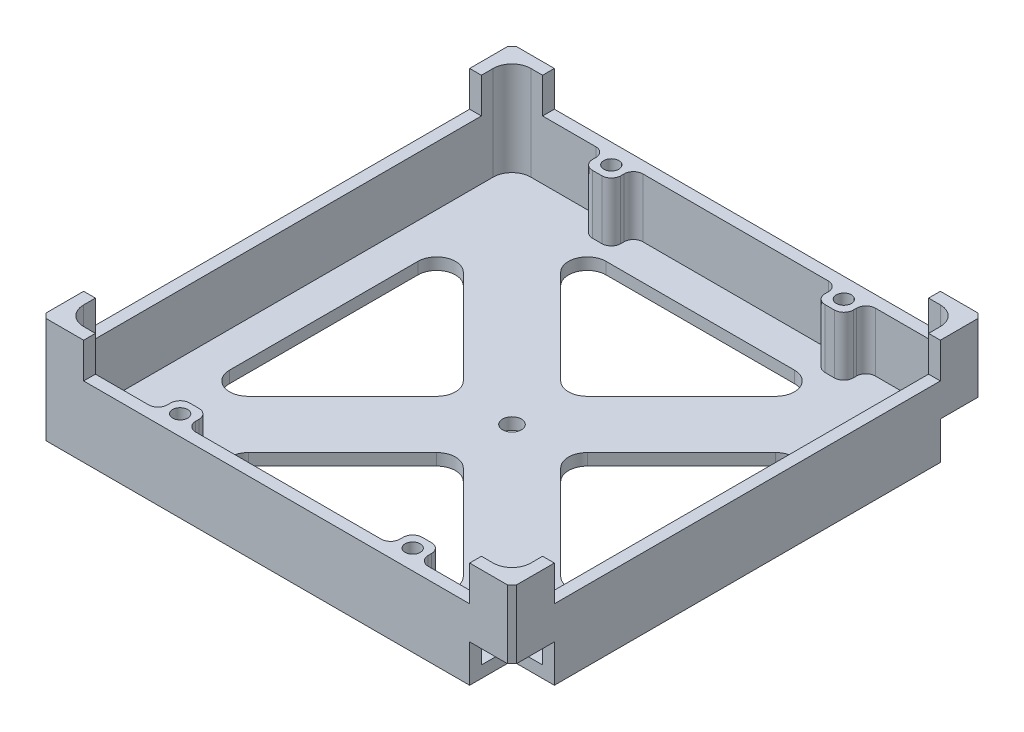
ISO-10303-21;
HEADER;
FILE_DESCRIPTION(('STEP AP214'),'2;1');
FILE_NAME('part.step','',(''),(''),'','','');
FILE_SCHEMA(('AUTOMOTIVE_DESIGN { 1 0 10303 214 1 1 1 1 }'));
ENDSEC;
DATA;
#1=APPLICATION_CONTEXT('core data for automotive mechanical design processes');
#2=APPLICATION_PROTOCOL_DEFINITION('international standard','automotive_design',2000,#1);
#3=PRODUCT_CONTEXT('',#1,'mechanical');
#4=PRODUCT('Part','Part','',(#3));
#5=PRODUCT_RELATED_PRODUCT_CATEGORY('part','',(#4));
#6=PRODUCT_DEFINITION_FORMATION('','',#4);
#7=PRODUCT_DEFINITION_CONTEXT('part definition',#1,'design');
#8=PRODUCT_DEFINITION('design','',#6,#7);
#9=PRODUCT_DEFINITION_SHAPE('','',#8);
#10=(LENGTH_UNIT() NAMED_UNIT(*) SI_UNIT(.MILLI.,.METRE.));
#11=(NAMED_UNIT(*) PLANE_ANGLE_UNIT() SI_UNIT($,.RADIAN.));
#12=(NAMED_UNIT(*) SI_UNIT($,.STERADIAN.) SOLID_ANGLE_UNIT());
#13=UNCERTAINTY_MEASURE_WITH_UNIT(LENGTH_MEASURE(1.E-05),#10,'distance_accuracy_value','');
#14=(GEOMETRIC_REPRESENTATION_CONTEXT(3) GLOBAL_UNCERTAINTY_ASSIGNED_CONTEXT((#13)) GLOBAL_UNIT_ASSIGNED_CONTEXT((#10,
#11,#12)) REPRESENTATION_CONTEXT('',''));
#15=CARTESIAN_POINT('',(0.,0.,0.));
#16=DIRECTION('',(0.,0.,1.));
#17=DIRECTION('',(1.,0.,0.));
#18=AXIS2_PLACEMENT_3D('',#15,#16,#17);
#19=CARTESIAN_POINT('',(0.,0.,0.));
#20=DIRECTION('',(0.,-1.,0.));
#21=DIRECTION('',(0.,0.,-1.));
#22=AXIS2_PLACEMENT_3D('',#19,#20,#21);
#23=PLANE('',#22);
#24=DIRECTION('',(-0.707106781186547,0.,0.707106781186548));
#25=VECTOR('',#24,1.);
#26=CARTESIAN_POINT('',(-5.1715728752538,0.,-5.1715728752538));
#27=LINE('',#26,#25);
#28=CARTESIAN_POINT('',(22.8284271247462,0.,-33.1715728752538));
#29=VERTEX_POINT('',#28);
#30=CARTESIAN_POINT('',(2.8284271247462,0.,-13.1715728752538));
#31=VERTEX_POINT('',#30);
#32=EDGE_CURVE('E729',#29,#31,#27,.T.);
#33=ORIENTED_EDGE('',*,*,#32,.F.);
#34=CARTESIAN_POINT('',(20.,0.,-36.));
#35=DIRECTION('',(0.,-1.,0.));
#36=DIRECTION('',(0.,0.,-1.));
#37=AXIS2_PLACEMENT_3D('',#34,#35,#36);
#38=CIRCLE('',#37,4.);
#39=CARTESIAN_POINT('',(20.,0.,-40.));
#40=VERTEX_POINT('',#39);
#41=EDGE_CURVE('E731',#29,#40,#38,.F.);
#42=ORIENTED_EDGE('',*,*,#41,.T.);
#43=DIRECTION('',(1.,0.,0.));
#44=VECTOR('',#43,1.);
#45=CARTESIAN_POINT('',(0.,0.,-40.));
#46=LINE('',#45,#44);
#47=CARTESIAN_POINT('',(-20.,0.,-40.));
#48=VERTEX_POINT('',#47);
#49=EDGE_CURVE('E710',#48,#40,#46,.T.);
#50=ORIENTED_EDGE('',*,*,#49,.F.);
#51=CARTESIAN_POINT('',(-20.,0.,-36.));
#52=DIRECTION('',(0.,-1.,0.));
#53=DIRECTION('',(0.,0.,-1.));
#54=AXIS2_PLACEMENT_3D('',#51,#52,#53);
#55=CIRCLE('',#54,4.);
#56=CARTESIAN_POINT('',(-22.8284271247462,0.,-33.1715728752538));
#57=VERTEX_POINT('',#56);
#58=EDGE_CURVE('E722',#57,#48,#55,.T.);
#59=ORIENTED_EDGE('',*,*,#58,.F.);
#60=DIRECTION('',(-0.707106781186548,0.,-0.707106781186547));
#61=VECTOR('',#60,1.);
#62=CARTESIAN_POINT('',(5.17157287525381,0.,-5.17157287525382));
#63=LINE('',#62,#61);
#64=CARTESIAN_POINT('',(-2.82842712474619,0.,-13.1715728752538));
#65=VERTEX_POINT('',#64);
#66=EDGE_CURVE('E725',#65,#57,#63,.T.);
#67=ORIENTED_EDGE('',*,*,#66,.F.);
#68=CARTESIAN_POINT('',(0.,0.,-16.));
#69=DIRECTION('',(0.,-1.,0.));
#70=DIRECTION('',(0.,0.,-1.));
#71=AXIS2_PLACEMENT_3D('',#68,#69,#70);
#72=CIRCLE('',#71,4.);
#73=EDGE_CURVE('E727',#31,#65,#72,.T.);
#74=ORIENTED_EDGE('',*,*,#73,.F.);
#75=EDGE_LOOP('',(#33,#42,#50,#59,#67,#74));
#76=FACE_BOUND('',#75,.T.);
#77=DIRECTION('',(0.707106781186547,0.,-0.707106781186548));
#78=VECTOR('',#77,1.);
#79=CARTESIAN_POINT('',(5.1715728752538,0.,5.1715728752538));
#80=LINE('',#79,#78);
#81=CARTESIAN_POINT('',(-22.8284271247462,0.,33.1715728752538));
#82=VERTEX_POINT('',#81);
#83=CARTESIAN_POINT('',(-2.8284271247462,0.,13.1715728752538));
#84=VERTEX_POINT('',#83);
#85=EDGE_CURVE('E819',#82,#84,#80,.T.);
#86=ORIENTED_EDGE('',*,*,#85,.F.);
#87=CARTESIAN_POINT('',(-20.,0.,36.));
#88=DIRECTION('',(0.,-1.,0.));
#89=DIRECTION('',(0.,0.,-1.));
#90=AXIS2_PLACEMENT_3D('',#87,#88,#89);
#91=CIRCLE('',#90,4.);
#92=CARTESIAN_POINT('',(-20.,0.,40.));
#93=VERTEX_POINT('',#92);
#94=EDGE_CURVE('E821',#82,#93,#91,.F.);
#95=ORIENTED_EDGE('',*,*,#94,.T.);
#96=DIRECTION('',(-1.,0.,0.));
#97=VECTOR('',#96,1.);
#98=CARTESIAN_POINT('',(0.,0.,40.));
#99=LINE('',#98,#97);
#100=CARTESIAN_POINT('',(20.,0.,40.));
#101=VERTEX_POINT('',#100);
#102=EDGE_CURVE('E800',#101,#93,#99,.T.);
#103=ORIENTED_EDGE('',*,*,#102,.F.);
#104=CARTESIAN_POINT('',(20.,0.,36.));
#105=DIRECTION('',(0.,-1.,0.));
#106=DIRECTION('',(0.,0.,-1.));
#107=AXIS2_PLACEMENT_3D('',#104,#105,#106);
#108=CIRCLE('',#107,4.);
#109=CARTESIAN_POINT('',(22.8284271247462,0.,33.1715728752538));
#110=VERTEX_POINT('',#109);
#111=EDGE_CURVE('E812',#110,#101,#108,.T.);
#112=ORIENTED_EDGE('',*,*,#111,.F.);
#113=DIRECTION('',(0.707106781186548,0.,0.707106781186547));
#114=VECTOR('',#113,1.);
#115=CARTESIAN_POINT('',(-5.17157287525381,0.,5.17157287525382));
#116=LINE('',#115,#114);
#117=CARTESIAN_POINT('',(2.82842712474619,0.,13.1715728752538));
#118=VERTEX_POINT('',#117);
#119=EDGE_CURVE('E815',#118,#110,#116,.T.);
#120=ORIENTED_EDGE('',*,*,#119,.F.);
#121=CARTESIAN_POINT('',(0.,0.,16.));
#122=DIRECTION('',(0.,-1.,0.));
#123=DIRECTION('',(0.,0.,-1.));
#124=AXIS2_PLACEMENT_3D('',#121,#122,#123);
#125=CIRCLE('',#124,4.);
#126=EDGE_CURVE('E817',#84,#118,#125,.T.);
#127=ORIENTED_EDGE('',*,*,#126,.F.);
#128=EDGE_LOOP('',(#86,#95,#103,#112,#120,#127));
#129=FACE_BOUND('',#128,.T.);
#130=CARTESIAN_POINT('',(-24.7,0.,45.8));
#131=DIRECTION('',(0.,1.,0.));
#132=DIRECTION('',(0.,0.,1.));
#133=AXIS2_PLACEMENT_3D('',#130,#131,#132);
#134=CIRCLE('',#133,1.6);
#135=CARTESIAN_POINT('',(-24.7,0.,47.4));
#136=VERTEX_POINT('',#135);
#137=EDGE_CURVE('E833',#136,#136,#134,.T.);
#138=ORIENTED_EDGE('',*,*,#137,.T.);
#139=EDGE_LOOP('',(#138));
#140=FACE_BOUND('',#139,.T.);
#141=DIRECTION('',(1.,0.,0.));
#142=VECTOR('',#141,1.);
#143=CARTESIAN_POINT('',(50.,0.,50.));
#144=LINE('',#143,#142);
#145=CARTESIAN_POINT('',(-48.9999999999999,0.,50.));
#146=VERTEX_POINT('',#145);
#147=CARTESIAN_POINT('',(41.,0.,50.));
#148=VERTEX_POINT('',#147);
#149=EDGE_CURVE('E1106',#146,#148,#144,.T.);
#150=ORIENTED_EDGE('',*,*,#149,.F.);
#151=DIRECTION('',(0.70710678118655,0.,0.707106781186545));
#152=VECTOR('',#151,1.);
#153=CARTESIAN_POINT('',(-49.4999999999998,0.,49.5000000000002));
#154=LINE('',#153,#152);
#155=CARTESIAN_POINT('',(-50.,0.,49.));
#156=VERTEX_POINT('',#155);
#157=EDGE_CURVE('E1228',#146,#156,#154,.F.);
#158=ORIENTED_EDGE('',*,*,#157,.T.);
#159=DIRECTION('',(0.,0.,1.));
#160=VECTOR('',#159,1.);
#161=CARTESIAN_POINT('',(-50.,0.,-50.));
#162=LINE('',#161,#160);
#163=CARTESIAN_POINT('',(-50.,0.,-49.));
#164=VERTEX_POINT('',#163);
#165=EDGE_CURVE('E1090',#164,#156,#162,.T.);
#166=ORIENTED_EDGE('',*,*,#165,.F.);
#167=DIRECTION('',(-0.707106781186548,0.,0.707106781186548));
#168=VECTOR('',#167,1.);
#169=CARTESIAN_POINT('',(-49.5,0.,-49.5));
#170=LINE('',#169,#168);
#171=CARTESIAN_POINT('',(-49.,0.,-50.));
#172=VERTEX_POINT('',#171);
#173=EDGE_CURVE('E1226',#164,#172,#170,.F.);
#174=ORIENTED_EDGE('',*,*,#173,.T.);
#175=DIRECTION('',(-1.,0.,0.));
#176=VECTOR('',#175,1.);
#177=CARTESIAN_POINT('',(50.,0.,-50.));
#178=LINE('',#177,#176);
#179=CARTESIAN_POINT('',(41.,0.,-50.));
#180=VERTEX_POINT('',#179);
#181=EDGE_CURVE('E1111',#180,#172,#178,.T.);
#182=ORIENTED_EDGE('',*,*,#181,.F.);
#183=DIRECTION('',(0.,0.,-1.));
#184=VECTOR('',#183,1.);
#185=CARTESIAN_POINT('',(41.,0.,-50.));
#186=LINE('',#185,#184);
#187=CARTESIAN_POINT('',(41.,0.,-41.));
#188=VERTEX_POINT('',#187);
#189=EDGE_CURVE('E926',#188,#180,#186,.T.);
#190=ORIENTED_EDGE('',*,*,#189,.F.);
#191=DIRECTION('',(-1.,0.,0.));
#192=VECTOR('',#191,1.);
#193=CARTESIAN_POINT('',(50.,0.,-41.));
#194=LINE('',#193,#192);
#195=CARTESIAN_POINT('',(50.,0.,-41.));
#196=VERTEX_POINT('',#195);
#197=EDGE_CURVE('E922',#196,#188,#194,.T.);
#198=ORIENTED_EDGE('',*,*,#197,.F.);
#199=DIRECTION('',(0.,0.,-1.));
#200=VECTOR('',#199,1.);
#201=CARTESIAN_POINT('',(50.,0.,-50.));
#202=LINE('',#201,#200);
#203=CARTESIAN_POINT('',(50.,0.,41.));
#204=VERTEX_POINT('',#203);
#205=EDGE_CURVE('E1108',#204,#196,#202,.T.);
#206=ORIENTED_EDGE('',*,*,#205,.F.);
#207=DIRECTION('',(1.,0.,0.));
#208=VECTOR('',#207,1.);
#209=CARTESIAN_POINT('',(50.,0.,41.));
#210=LINE('',#209,#208);
#211=CARTESIAN_POINT('',(41.,0.,41.));
#212=VERTEX_POINT('',#211);
#213=EDGE_CURVE('E956',#212,#204,#210,.T.);
#214=ORIENTED_EDGE('',*,*,#213,.F.);
#215=DIRECTION('',(0.,0.,-1.));
#216=VECTOR('',#215,1.);
#217=CARTESIAN_POINT('',(41.,0.,50.));
#218=LINE('',#217,#216);
#219=EDGE_CURVE('E951',#148,#212,#218,.T.);
#220=ORIENTED_EDGE('',*,*,#219,.F.);
#221=EDGE_LOOP('',(#150,#158,#166,#174,#182,#190,#198,#206,#214,#220));
#222=FACE_BOUND('',#221,.T.);
#223=CARTESIAN_POINT('',(-24.7,0.,-45.8));
#224=DIRECTION('',(0.,1.,0.));
#225=DIRECTION('',(0.,0.,1.));
#226=AXIS2_PLACEMENT_3D('',#223,#224,#225);
#227=CIRCLE('',#226,1.6);
#228=CARTESIAN_POINT('',(-24.7,0.,-44.2));
#229=VERTEX_POINT('',#228);
#230=EDGE_CURVE('E901',#229,#229,#227,.T.);
#231=ORIENTED_EDGE('',*,*,#230,.T.);
#232=EDGE_LOOP('',(#231));
#233=FACE_BOUND('',#232,.T.);
#234=CARTESIAN_POINT('',(0.,0.,0.));
#235=DIRECTION('',(0.,1.,0.));
#236=DIRECTION('',(0.,0.,1.));
#237=AXIS2_PLACEMENT_3D('',#234,#235,#236);
#238=CIRCLE('',#237,2.);
#239=CARTESIAN_POINT('',(0.,0.,2.));
#240=VERTEX_POINT('',#239);
#241=EDGE_CURVE('E895',#240,#240,#238,.T.);
#242=ORIENTED_EDGE('',*,*,#241,.T.);
#243=EDGE_LOOP('',(#242));
#244=FACE_BOUND('',#243,.T.);
#245=CARTESIAN_POINT('',(24.7,0.,-45.8));
#246=DIRECTION('',(0.,1.,0.));
#247=DIRECTION('',(0.,0.,1.));
#248=AXIS2_PLACEMENT_3D('',#245,#246,#247);
#249=CIRCLE('',#248,1.6);
#250=CARTESIAN_POINT('',(24.7,0.,-44.2));
#251=VERTEX_POINT('',#250);
#252=EDGE_CURVE('E871',#251,#251,#249,.T.);
#253=ORIENTED_EDGE('',*,*,#252,.T.);
#254=EDGE_LOOP('',(#253));
#255=FACE_BOUND('',#254,.T.);
#256=CARTESIAN_POINT('',(24.7,0.,45.8));
#257=DIRECTION('',(0.,1.,0.));
#258=DIRECTION('',(0.,0.,1.));
#259=AXIS2_PLACEMENT_3D('',#256,#257,#258);
#260=CIRCLE('',#259,1.6);
#261=CARTESIAN_POINT('',(24.7,0.,47.4));
#262=VERTEX_POINT('',#261);
#263=EDGE_CURVE('E827',#262,#262,#260,.T.);
#264=ORIENTED_EDGE('',*,*,#263,.T.);
#265=EDGE_LOOP('',(#264));
#266=FACE_BOUND('',#265,.T.);
#267=DIRECTION('',(-0.70710678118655,0.,-0.707106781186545));
#268=VECTOR('',#267,1.);
#269=CARTESIAN_POINT('',(5.17157287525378,0.,-5.17157287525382));
#270=LINE('',#269,#268);
#271=CARTESIAN_POINT('',(33.1715728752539,0.,22.8284271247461));
#272=VERTEX_POINT('',#271);
#273=CARTESIAN_POINT('',(13.1715728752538,0.,2.82842712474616));
#274=VERTEX_POINT('',#273);
#275=EDGE_CURVE('E774',#272,#274,#270,.T.);
#276=ORIENTED_EDGE('',*,*,#275,.F.);
#277=CARTESIAN_POINT('',(36.0000000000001,0.,19.9999999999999));
#278=DIRECTION('',(0.,-1.,0.));
#279=DIRECTION('',(0.,0.,-1.));
#280=AXIS2_PLACEMENT_3D('',#277,#278,#279);
#281=CIRCLE('',#280,4.);
#282=CARTESIAN_POINT('',(40.0000000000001,0.,19.9999999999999));
#283=VERTEX_POINT('',#282);
#284=EDGE_CURVE('E776',#272,#283,#281,.F.);
#285=ORIENTED_EDGE('',*,*,#284,.T.);
#286=DIRECTION('',(0.,0.,1.));
#287=VECTOR('',#286,1.);
#288=CARTESIAN_POINT('',(40.,0.,-1.39659253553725E-13));
#289=LINE('',#288,#287);
#290=CARTESIAN_POINT('',(39.9999999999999,0.,-20.0000000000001));
#291=VERTEX_POINT('',#290);
#292=EDGE_CURVE('E755',#291,#283,#289,.T.);
#293=ORIENTED_EDGE('',*,*,#292,.F.);
#294=CARTESIAN_POINT('',(35.9999999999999,0.,-20.0000000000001));
#295=DIRECTION('',(0.,-1.,0.));
#296=DIRECTION('',(0.,0.,-1.));
#297=AXIS2_PLACEMENT_3D('',#294,#295,#296);
#298=CIRCLE('',#297,4.);
#299=CARTESIAN_POINT('',(33.1715728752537,0.,-22.8284271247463));
#300=VERTEX_POINT('',#299);
#301=EDGE_CURVE('E767',#300,#291,#298,.T.);
#302=ORIENTED_EDGE('',*,*,#301,.F.);
#303=DIRECTION('',(0.707106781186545,0.,-0.70710678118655));
#304=VECTOR('',#303,1.);
#305=CARTESIAN_POINT('',(5.17157287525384,0.,5.1715728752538));
#306=LINE('',#305,#304);
#307=CARTESIAN_POINT('',(13.1715728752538,0.,-2.82842712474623));
#308=VERTEX_POINT('',#307);
#309=EDGE_CURVE('E770',#308,#300,#306,.T.);
#310=ORIENTED_EDGE('',*,*,#309,.F.);
#311=CARTESIAN_POINT('',(16.,0.,0.));
#312=DIRECTION('',(0.,-1.,0.));
#313=DIRECTION('',(0.,0.,-1.));
#314=AXIS2_PLACEMENT_3D('',#311,#312,#313);
#315=CIRCLE('',#314,4.);
#316=EDGE_CURVE('E772',#274,#308,#315,.T.);
#317=ORIENTED_EDGE('',*,*,#316,.F.);
#318=EDGE_LOOP('',(#276,#285,#293,#302,#310,#317));
#319=FACE_BOUND('',#318,.T.);
#320=DIRECTION('',(0.707106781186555,0.,0.70710678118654));
#321=VECTOR('',#320,1.);
#322=CARTESIAN_POINT('',(-5.17157287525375,0.,5.17157287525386));
#323=LINE('',#322,#321);
#324=CARTESIAN_POINT('',(-33.1715728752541,0.,-22.8284271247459));
#325=VERTEX_POINT('',#324);
#326=CARTESIAN_POINT('',(-13.1715728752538,0.,-2.82842712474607));
#327=VERTEX_POINT('',#326);
#328=EDGE_CURVE('E684',#325,#327,#323,.T.);
#329=ORIENTED_EDGE('',*,*,#328,.F.);
#330=CARTESIAN_POINT('',(-36.0000000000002,0.,-19.9999999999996));
#331=DIRECTION('',(0.,-1.,0.));
#332=DIRECTION('',(0.,0.,-1.));
#333=AXIS2_PLACEMENT_3D('',#330,#331,#332);
#334=CIRCLE('',#333,4.);
#335=CARTESIAN_POINT('',(-40.0000000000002,0.,-19.9999999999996));
#336=VERTEX_POINT('',#335);
#337=EDGE_CURVE('E686',#325,#336,#334,.F.);
#338=ORIENTED_EDGE('',*,*,#337,.T.);
#339=DIRECTION('',(0.,0.,-1.));
#340=VECTOR('',#339,1.);
#341=CARTESIAN_POINT('',(-40.,0.,4.18977760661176E-13));
#342=LINE('',#341,#340);
#343=CARTESIAN_POINT('',(-39.9999999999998,0.,20.0000000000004));
#344=VERTEX_POINT('',#343);
#345=EDGE_CURVE('E671',#344,#336,#342,.T.);
#346=ORIENTED_EDGE('',*,*,#345,.F.);
#347=CARTESIAN_POINT('',(-35.9999999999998,0.,20.0000000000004));
#348=DIRECTION('',(0.,-1.,0.));
#349=DIRECTION('',(0.,0.,-1.));
#350=AXIS2_PLACEMENT_3D('',#347,#348,#349);
#351=CIRCLE('',#350,4.);
#352=CARTESIAN_POINT('',(-33.1715728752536,0.,22.8284271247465));
#353=VERTEX_POINT('',#352);
#354=EDGE_CURVE('E645',#353,#344,#351,.T.);
#355=ORIENTED_EDGE('',*,*,#354,.F.);
#356=DIRECTION('',(-0.70710678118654,0.,0.707106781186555));
#357=VECTOR('',#356,1.);
#358=CARTESIAN_POINT('',(-5.17157287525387,0.,-5.17157287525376));
#359=LINE('',#358,#357);
#360=CARTESIAN_POINT('',(-13.1715728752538,0.,2.82842712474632));
#361=VERTEX_POINT('',#360);
#362=EDGE_CURVE('E680',#361,#353,#359,.T.);
#363=ORIENTED_EDGE('',*,*,#362,.F.);
#364=CARTESIAN_POINT('',(-16.,0.,1.5718276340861E-13));
#365=DIRECTION('',(0.,-1.,0.));
#366=DIRECTION('',(0.,0.,-1.));
#367=AXIS2_PLACEMENT_3D('',#364,#365,#366);
#368=CIRCLE('',#367,4.);
#369=EDGE_CURVE('E682',#327,#361,#368,.T.);
#370=ORIENTED_EDGE('',*,*,#369,.F.);
#371=EDGE_LOOP('',(#329,#338,#346,#355,#363,#370));
#372=FACE_BOUND('',#371,.T.);
#373=ADVANCED_FACE('F35',(#76,#129,#140,#222,#233,#244,#255,#266,#319,#372),#23,.T.);
#374=CARTESIAN_POINT('',(0.,2.5,0.));
#375=DIRECTION('',(0.,-1.,0.));
#376=DIRECTION('',(0.,0.,-1.));
#377=AXIS2_PLACEMENT_3D('',#374,#375,#376);
#378=PLANE('',#377);
#379=CARTESIAN_POINT('',(20.,2.5,-36.));
#380=DIRECTION('',(0.,1.,0.));
#381=DIRECTION('',(0.,0.,-1.));
#382=AXIS2_PLACEMENT_3D('',#379,#380,#381);
#383=CIRCLE('',#382,4.);
#384=CARTESIAN_POINT('',(20.,2.5,-40.));
#385=VERTEX_POINT('',#384);
#386=CARTESIAN_POINT('',(22.8284271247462,2.5,-33.1715728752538));
#387=VERTEX_POINT('',#386);
#388=EDGE_CURVE('E689',#385,#387,#383,.F.);
#389=ORIENTED_EDGE('',*,*,#388,.T.);
#390=DIRECTION('',(0.707106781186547,0.,-0.707106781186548));
#391=VECTOR('',#390,1.);
#392=CARTESIAN_POINT('',(-5.1715728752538,2.5,-5.1715728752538));
#393=LINE('',#392,#391);
#394=CARTESIAN_POINT('',(2.8284271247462,2.5,-13.1715728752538));
#395=VERTEX_POINT('',#394);
#396=EDGE_CURVE('E704',#395,#387,#393,.T.);
#397=ORIENTED_EDGE('',*,*,#396,.F.);
#398=CARTESIAN_POINT('',(0.,2.5,-16.));
#399=DIRECTION('',(0.,1.,0.));
#400=DIRECTION('',(0.,0.,-1.));
#401=AXIS2_PLACEMENT_3D('',#398,#399,#400);
#402=CIRCLE('',#401,4.);
#403=CARTESIAN_POINT('',(-2.82842712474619,2.5,-13.1715728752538));
#404=VERTEX_POINT('',#403);
#405=EDGE_CURVE('E701',#404,#395,#402,.T.);
#406=ORIENTED_EDGE('',*,*,#405,.F.);
#407=DIRECTION('',(0.707106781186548,0.,0.707106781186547));
#408=VECTOR('',#407,1.);
#409=CARTESIAN_POINT('',(5.17157287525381,2.5,-5.17157287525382));
#410=LINE('',#409,#408);
#411=CARTESIAN_POINT('',(-22.8284271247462,2.5,-33.1715728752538));
#412=VERTEX_POINT('',#411);
#413=EDGE_CURVE('E698',#412,#404,#410,.T.);
#414=ORIENTED_EDGE('',*,*,#413,.F.);
#415=CARTESIAN_POINT('',(-20.,2.5,-36.));
#416=DIRECTION('',(0.,1.,0.));
#417=DIRECTION('',(0.,0.,-1.));
#418=AXIS2_PLACEMENT_3D('',#415,#416,#417);
#419=CIRCLE('',#418,4.);
#420=CARTESIAN_POINT('',(-20.,2.5,-40.));
#421=VERTEX_POINT('',#420);
#422=EDGE_CURVE('E695',#421,#412,#419,.T.);
#423=ORIENTED_EDGE('',*,*,#422,.F.);
#424=DIRECTION('',(-1.,0.,0.));
#425=VECTOR('',#424,1.);
#426=CARTESIAN_POINT('',(0.,2.5,-40.));
#427=LINE('',#426,#425);
#428=EDGE_CURVE('E692',#385,#421,#427,.T.);
#429=ORIENTED_EDGE('',*,*,#428,.F.);
#430=EDGE_LOOP('',(#389,#397,#406,#414,#423,#429));
#431=FACE_BOUND('',#430,.T.);
#432=CARTESIAN_POINT('',(-20.,2.5,36.));
#433=DIRECTION('',(0.,1.,0.));
#434=DIRECTION('',(0.,0.,1.));
#435=AXIS2_PLACEMENT_3D('',#432,#433,#434);
#436=CIRCLE('',#435,4.);
#437=CARTESIAN_POINT('',(-20.,2.5,40.));
#438=VERTEX_POINT('',#437);
#439=CARTESIAN_POINT('',(-22.8284271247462,2.5,33.1715728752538));
#440=VERTEX_POINT('',#439);
#441=EDGE_CURVE('E779',#438,#440,#436,.F.);
#442=ORIENTED_EDGE('',*,*,#441,.T.);
#443=DIRECTION('',(-0.707106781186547,0.,0.707106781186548));
#444=VECTOR('',#443,1.);
#445=CARTESIAN_POINT('',(5.1715728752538,2.5,5.1715728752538));
#446=LINE('',#445,#444);
#447=CARTESIAN_POINT('',(-2.8284271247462,2.5,13.1715728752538));
#448=VERTEX_POINT('',#447);
#449=EDGE_CURVE('E794',#448,#440,#446,.T.);
#450=ORIENTED_EDGE('',*,*,#449,.F.);
#451=CARTESIAN_POINT('',(0.,2.5,16.));
#452=DIRECTION('',(0.,1.,0.));
#453=DIRECTION('',(0.,0.,1.));
#454=AXIS2_PLACEMENT_3D('',#451,#452,#453);
#455=CIRCLE('',#454,4.);
#456=CARTESIAN_POINT('',(2.82842712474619,2.5,13.1715728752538));
#457=VERTEX_POINT('',#456);
#458=EDGE_CURVE('E791',#457,#448,#455,.T.);
#459=ORIENTED_EDGE('',*,*,#458,.F.);
#460=DIRECTION('',(-0.707106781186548,0.,-0.707106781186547));
#461=VECTOR('',#460,1.);
#462=CARTESIAN_POINT('',(-5.17157287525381,2.5,5.17157287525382));
#463=LINE('',#462,#461);
#464=CARTESIAN_POINT('',(22.8284271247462,2.5,33.1715728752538));
#465=VERTEX_POINT('',#464);
#466=EDGE_CURVE('E788',#465,#457,#463,.T.);
#467=ORIENTED_EDGE('',*,*,#466,.F.);
#468=CARTESIAN_POINT('',(20.,2.5,36.));
#469=DIRECTION('',(0.,1.,0.));
#470=DIRECTION('',(0.,0.,1.));
#471=AXIS2_PLACEMENT_3D('',#468,#469,#470);
#472=CIRCLE('',#471,4.);
#473=CARTESIAN_POINT('',(20.,2.5,40.));
#474=VERTEX_POINT('',#473);
#475=EDGE_CURVE('E785',#474,#465,#472,.T.);
#476=ORIENTED_EDGE('',*,*,#475,.F.);
#477=DIRECTION('',(1.,0.,0.));
#478=VECTOR('',#477,1.);
#479=CARTESIAN_POINT('',(0.,2.5,40.));
#480=LINE('',#479,#478);
#481=EDGE_CURVE('E782',#438,#474,#480,.T.);
#482=ORIENTED_EDGE('',*,*,#481,.F.);
#483=EDGE_LOOP('',(#442,#450,#459,#467,#476,#482));
#484=FACE_BOUND('',#483,.T.);
#485=CARTESIAN_POINT('',(0.,2.5,0.));
#486=DIRECTION('',(0.,1.,0.));
#487=DIRECTION('',(0.,0.,1.));
#488=AXIS2_PLACEMENT_3D('',#485,#486,#487);
#489=CIRCLE('',#488,2.);
#490=CARTESIAN_POINT('',(0.,2.5,2.));
#491=VERTEX_POINT('',#490);
#492=EDGE_CURVE('E892',#491,#491,#489,.T.);
#493=ORIENTED_EDGE('',*,*,#492,.F.);
#494=EDGE_LOOP('',(#493));
#495=FACE_BOUND('',#494,.T.);
#496=DIRECTION('',(1.,0.,0.));
#497=VECTOR('',#496,1.);
#498=CARTESIAN_POINT('',(0.,2.5,47.5));
#499=LINE('',#498,#497);
#500=CARTESIAN_POINT('',(-19.7,2.5,47.5));
#501=VERTEX_POINT('',#500);
#502=CARTESIAN_POINT('',(19.7,2.5,47.5));
#503=VERTEX_POINT('',#502);
#504=EDGE_CURVE('E1070',#501,#503,#499,.T.);
#505=ORIENTED_EDGE('',*,*,#504,.T.);
#506=CARTESIAN_POINT('',(19.7,2.49999999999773,45.5));
#507=DIRECTION('',(0.,-1.,0.));
#508=DIRECTION('',(0.,0.,-1.));
#509=AXIS2_PLACEMENT_3D('',#506,#507,#508);
#510=CIRCLE('',#509,2.);
#511=CARTESIAN_POINT('',(21.7,2.49999999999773,45.5));
#512=VERTEX_POINT('',#511);
#513=EDGE_CURVE('E1346',#503,#512,#510,.F.);
#514=ORIENTED_EDGE('',*,*,#513,.T.);
#515=DIRECTION('',(0.,0.,-1.));
#516=VECTOR('',#515,1.);
#517=CARTESIAN_POINT('',(21.7,2.49999999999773,50.));
#518=LINE('',#517,#516);
#519=CARTESIAN_POINT('',(21.7,2.49999999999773,44.8));
#520=VERTEX_POINT('',#519);
#521=EDGE_CURVE('E841',#512,#520,#518,.T.);
#522=ORIENTED_EDGE('',*,*,#521,.T.);
#523=CARTESIAN_POINT('',(23.7,2.49999999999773,44.8));
#524=DIRECTION('',(0.,-1.,0.));
#525=DIRECTION('',(0.,0.,-1.));
#526=AXIS2_PLACEMENT_3D('',#523,#524,#525);
#527=CIRCLE('',#526,2.);
#528=CARTESIAN_POINT('',(23.7,2.49999999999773,42.8));
#529=VERTEX_POINT('',#528);
#530=EDGE_CURVE('E1331',#520,#529,#527,.T.);
#531=ORIENTED_EDGE('',*,*,#530,.T.);
#532=DIRECTION('',(1.,0.,0.));
#533=VECTOR('',#532,1.);
#534=CARTESIAN_POINT('',(21.7,2.49999999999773,42.8));
#535=LINE('',#534,#533);
#536=CARTESIAN_POINT('',(25.7,2.49999999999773,42.8));
#537=VERTEX_POINT('',#536);
#538=EDGE_CURVE('E836',#529,#537,#535,.T.);
#539=ORIENTED_EDGE('',*,*,#538,.T.);
#540=CARTESIAN_POINT('',(25.7,2.49999999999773,44.8));
#541=DIRECTION('',(0.,-1.,0.));
#542=DIRECTION('',(0.,0.,-1.));
#543=AXIS2_PLACEMENT_3D('',#540,#541,#542);
#544=CIRCLE('',#543,2.);
#545=CARTESIAN_POINT('',(27.7,2.49999999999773,44.8));
#546=VERTEX_POINT('',#545);
#547=EDGE_CURVE('E1329',#537,#546,#544,.T.);
#548=ORIENTED_EDGE('',*,*,#547,.T.);
#549=DIRECTION('',(0.,0.,1.));
#550=VECTOR('',#549,1.);
#551=CARTESIAN_POINT('',(27.7,2.49999999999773,50.));
#552=LINE('',#551,#550);
#553=CARTESIAN_POINT('',(27.7,2.49999999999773,45.5));
#554=VERTEX_POINT('',#553);
#555=EDGE_CURVE('E848',#546,#554,#552,.T.);
#556=ORIENTED_EDGE('',*,*,#555,.T.);
#557=CARTESIAN_POINT('',(29.7,2.49999999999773,45.5));
#558=DIRECTION('',(0.,-1.,0.));
#559=DIRECTION('',(0.,0.,-1.));
#560=AXIS2_PLACEMENT_3D('',#557,#558,#559);
#561=CIRCLE('',#560,2.);
#562=CARTESIAN_POINT('',(29.7,2.5,47.5));
#563=VERTEX_POINT('',#562);
#564=EDGE_CURVE('E1344',#554,#563,#561,.F.);
#565=ORIENTED_EDGE('',*,*,#564,.T.);
#566=CARTESIAN_POINT('',(41.,2.5,47.5));
#567=VERTEX_POINT('',#566);
#568=EDGE_CURVE('E1065',#563,#567,#499,.T.);
#569=ORIENTED_EDGE('',*,*,#568,.T.);
#570=DIRECTION('',(0.,0.,-1.));
#571=VECTOR('',#570,1.);
#572=CARTESIAN_POINT('',(41.,2.5,0.));
#573=LINE('',#572,#571);
#574=CARTESIAN_POINT('',(41.,2.5,41.));
#575=VERTEX_POINT('',#574);
#576=EDGE_CURVE('E1132',#567,#575,#573,.T.);
#577=ORIENTED_EDGE('',*,*,#576,.T.);
#578=DIRECTION('',(1.,0.,0.));
#579=VECTOR('',#578,1.);
#580=CARTESIAN_POINT('',(0.,2.5,41.));
#581=LINE('',#580,#579);
#582=CARTESIAN_POINT('',(47.5,2.5,41.));
#583=VERTEX_POINT('',#582);
#584=EDGE_CURVE('E1135',#575,#583,#581,.T.);
#585=ORIENTED_EDGE('',*,*,#584,.T.);
#586=DIRECTION('',(0.,0.,-1.));
#587=VECTOR('',#586,1.);
#588=CARTESIAN_POINT('',(47.5,2.5,0.));
#589=LINE('',#588,#587);
#590=CARTESIAN_POINT('',(47.5,2.5,-41.));
#591=VERTEX_POINT('',#590);
#592=EDGE_CURVE('E1069',#583,#591,#589,.T.);
#593=ORIENTED_EDGE('',*,*,#592,.T.);
#594=DIRECTION('',(-1.,0.,0.));
#595=VECTOR('',#594,1.);
#596=CARTESIAN_POINT('',(0.,2.5,-41.));
#597=LINE('',#596,#595);
#598=CARTESIAN_POINT('',(41.,2.5,-41.));
#599=VERTEX_POINT('',#598);
#600=EDGE_CURVE('E1140',#591,#599,#597,.T.);
#601=ORIENTED_EDGE('',*,*,#600,.T.);
#602=DIRECTION('',(0.,0.,-1.));
#603=VECTOR('',#602,1.);
#604=CARTESIAN_POINT('',(41.,2.5,0.));
#605=LINE('',#604,#603);
#606=CARTESIAN_POINT('',(41.,2.5,-47.5));
#607=VERTEX_POINT('',#606);
#608=EDGE_CURVE('E1143',#599,#607,#605,.T.);
#609=ORIENTED_EDGE('',*,*,#608,.T.);
#610=DIRECTION('',(-1.,0.,0.));
#611=VECTOR('',#610,1.);
#612=CARTESIAN_POINT('',(0.,2.5,-47.5));
#613=LINE('',#612,#611);
#614=CARTESIAN_POINT('',(29.7,2.5,-47.5));
#615=VERTEX_POINT('',#614);
#616=EDGE_CURVE('E1074',#607,#615,#613,.T.);
#617=ORIENTED_EDGE('',*,*,#616,.T.);
#618=CARTESIAN_POINT('',(29.7,2.5,-45.5));
#619=DIRECTION('',(0.,-1.,0.));
#620=DIRECTION('',(0.,0.,-1.));
#621=AXIS2_PLACEMENT_3D('',#618,#619,#620);
#622=CIRCLE('',#621,2.);
#623=CARTESIAN_POINT('',(27.7,2.49999999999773,-45.5));
#624=VERTEX_POINT('',#623);
#625=EDGE_CURVE('E1262',#615,#624,#622,.F.);
#626=ORIENTED_EDGE('',*,*,#625,.T.);
#627=DIRECTION('',(0.,0.,-1.));
#628=VECTOR('',#627,1.);
#629=CARTESIAN_POINT('',(27.7,2.49999999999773,-50.));
#630=LINE('',#629,#628);
#631=CARTESIAN_POINT('',(27.7,2.49999999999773,-44.8));
#632=VERTEX_POINT('',#631);
#633=EDGE_CURVE('E883',#632,#624,#630,.T.);
#634=ORIENTED_EDGE('',*,*,#633,.F.);
#635=CARTESIAN_POINT('',(25.7,2.49999999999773,-44.8));
#636=DIRECTION('',(0.,-1.,0.));
#637=DIRECTION('',(0.,0.,-1.));
#638=AXIS2_PLACEMENT_3D('',#635,#636,#637);
#639=CIRCLE('',#638,2.);
#640=CARTESIAN_POINT('',(25.7,2.49999999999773,-42.8));
#641=VERTEX_POINT('',#640);
#642=EDGE_CURVE('E1287',#632,#641,#639,.T.);
#643=ORIENTED_EDGE('',*,*,#642,.T.);
#644=DIRECTION('',(1.,0.,0.));
#645=VECTOR('',#644,1.);
#646=CARTESIAN_POINT('',(21.7,2.49999999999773,-42.8));
#647=LINE('',#646,#645);
#648=CARTESIAN_POINT('',(23.7,2.49999999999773,-42.8));
#649=VERTEX_POINT('',#648);
#650=EDGE_CURVE('E886',#649,#641,#647,.T.);
#651=ORIENTED_EDGE('',*,*,#650,.F.);
#652=CARTESIAN_POINT('',(23.7,2.49999999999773,-44.8));
#653=DIRECTION('',(0.,-1.,0.));
#654=DIRECTION('',(0.,0.,-1.));
#655=AXIS2_PLACEMENT_3D('',#652,#653,#654);
#656=CIRCLE('',#655,2.);
#657=CARTESIAN_POINT('',(21.7,2.49999999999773,-44.8));
#658=VERTEX_POINT('',#657);
#659=EDGE_CURVE('E1289',#649,#658,#656,.T.);
#660=ORIENTED_EDGE('',*,*,#659,.T.);
#661=DIRECTION('',(0.,0.,1.));
#662=VECTOR('',#661,1.);
#663=CARTESIAN_POINT('',(21.7,2.49999999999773,-50.));
#664=LINE('',#663,#662);
#665=CARTESIAN_POINT('',(21.7,2.49999999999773,-45.5));
#666=VERTEX_POINT('',#665);
#667=EDGE_CURVE('E889',#666,#658,#664,.T.);
#668=ORIENTED_EDGE('',*,*,#667,.F.);
#669=CARTESIAN_POINT('',(19.7,2.5,-45.5));
#670=DIRECTION('',(0.,-1.,0.));
#671=DIRECTION('',(0.,0.,-1.));
#672=AXIS2_PLACEMENT_3D('',#669,#670,#671);
#673=CIRCLE('',#672,2.);
#674=CARTESIAN_POINT('',(19.7,2.5,-47.5));
#675=VERTEX_POINT('',#674);
#676=EDGE_CURVE('E1260',#666,#675,#673,.F.);
#677=ORIENTED_EDGE('',*,*,#676,.T.);
#678=CARTESIAN_POINT('',(-19.7,2.5,-47.5));
#679=VERTEX_POINT('',#678);
#680=EDGE_CURVE('E1078',#675,#679,#613,.T.);
#681=ORIENTED_EDGE('',*,*,#680,.T.);
#682=CARTESIAN_POINT('',(-19.7,2.5,-45.5));
#683=DIRECTION('',(0.,-1.,0.));
#684=DIRECTION('',(0.,0.,-1.));
#685=AXIS2_PLACEMENT_3D('',#682,#683,#684);
#686=CIRCLE('',#685,2.);
#687=CARTESIAN_POINT('',(-21.7,2.49999999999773,-45.5));
#688=VERTEX_POINT('',#687);
#689=EDGE_CURVE('E1154',#679,#688,#686,.F.);
#690=ORIENTED_EDGE('',*,*,#689,.T.);
#691=DIRECTION('',(0.,0.,-1.));
#692=VECTOR('',#691,1.);
#693=CARTESIAN_POINT('',(-21.7,2.49999999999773,-50.));
#694=LINE('',#693,#692);
#695=CARTESIAN_POINT('',(-21.7,2.49999999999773,-44.8));
#696=VERTEX_POINT('',#695);
#697=EDGE_CURVE('E910',#696,#688,#694,.T.);
#698=ORIENTED_EDGE('',*,*,#697,.F.);
#699=CARTESIAN_POINT('',(-23.7,2.49999999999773,-44.8));
#700=DIRECTION('',(0.,-1.,0.));
#701=DIRECTION('',(0.,0.,-1.));
#702=AXIS2_PLACEMENT_3D('',#699,#700,#701);
#703=CIRCLE('',#702,2.);
#704=CARTESIAN_POINT('',(-23.7,2.49999999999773,-42.8));
#705=VERTEX_POINT('',#704);
#706=EDGE_CURVE('E1179',#696,#705,#703,.T.);
#707=ORIENTED_EDGE('',*,*,#706,.T.);
#708=DIRECTION('',(1.,0.,0.));
#709=VECTOR('',#708,1.);
#710=CARTESIAN_POINT('',(-27.7,2.49999999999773,-42.8));
#711=LINE('',#710,#709);
#712=CARTESIAN_POINT('',(-25.7,2.49999999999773,-42.8));
#713=VERTEX_POINT('',#712);
#714=EDGE_CURVE('E907',#713,#705,#711,.T.);
#715=ORIENTED_EDGE('',*,*,#714,.F.);
#716=CARTESIAN_POINT('',(-25.7,2.49999999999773,-44.8));
#717=DIRECTION('',(0.,-1.,0.));
#718=DIRECTION('',(0.,0.,-1.));
#719=AXIS2_PLACEMENT_3D('',#716,#717,#718);
#720=CIRCLE('',#719,2.);
#721=CARTESIAN_POINT('',(-27.7,2.49999999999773,-44.8));
#722=VERTEX_POINT('',#721);
#723=EDGE_CURVE('E1181',#713,#722,#720,.T.);
#724=ORIENTED_EDGE('',*,*,#723,.T.);
#725=DIRECTION('',(0.,0.,1.));
#726=VECTOR('',#725,1.);
#727=CARTESIAN_POINT('',(-27.7,2.49999999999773,-50.));
#728=LINE('',#727,#726);
#729=CARTESIAN_POINT('',(-27.7,2.49999999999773,-45.5));
#730=VERTEX_POINT('',#729);
#731=EDGE_CURVE('E904',#730,#722,#728,.T.);
#732=ORIENTED_EDGE('',*,*,#731,.F.);
#733=CARTESIAN_POINT('',(-29.7,2.5,-45.5));
#734=DIRECTION('',(0.,-1.,0.));
#735=DIRECTION('',(0.,0.,-1.));
#736=AXIS2_PLACEMENT_3D('',#733,#734,#735);
#737=CIRCLE('',#736,2.);
#738=CARTESIAN_POINT('',(-29.7,2.5,-47.5));
#739=VERTEX_POINT('',#738);
#740=EDGE_CURVE('E1152',#730,#739,#737,.F.);
#741=ORIENTED_EDGE('',*,*,#740,.T.);
#742=CARTESIAN_POINT('',(-43.5,2.5,-47.5));
#743=VERTEX_POINT('',#742);
#744=EDGE_CURVE('E1073',#739,#743,#613,.T.);
#745=ORIENTED_EDGE('',*,*,#744,.T.);
#746=CARTESIAN_POINT('',(-43.5,2.5,-43.5));
#747=DIRECTION('',(0.,-1.,0.));
#748=DIRECTION('',(0.,0.,-1.));
#749=AXIS2_PLACEMENT_3D('',#746,#747,#748);
#750=CIRCLE('',#749,4.);
#751=CARTESIAN_POINT('',(-47.5,2.5,-43.5));
#752=VERTEX_POINT('',#751);
#753=EDGE_CURVE('E1197',#743,#752,#750,.F.);
#754=ORIENTED_EDGE('',*,*,#753,.T.);
#755=DIRECTION('',(0.,0.,1.));
#756=VECTOR('',#755,1.);
#757=CARTESIAN_POINT('',(-47.5,2.5,0.));
#758=LINE('',#757,#756);
#759=CARTESIAN_POINT('',(-47.5,2.5,43.5));
#760=VERTEX_POINT('',#759);
#761=EDGE_CURVE('E1062',#752,#760,#758,.T.);
#762=ORIENTED_EDGE('',*,*,#761,.T.);
#763=CARTESIAN_POINT('',(-43.5,2.5,43.5));
#764=DIRECTION('',(0.,-1.,0.));
#765=DIRECTION('',(0.,0.,-1.));
#766=AXIS2_PLACEMENT_3D('',#763,#764,#765);
#767=CIRCLE('',#766,4.);
#768=CARTESIAN_POINT('',(-43.5,2.5,47.5));
#769=VERTEX_POINT('',#768);
#770=EDGE_CURVE('E1195',#760,#769,#767,.F.);
#771=ORIENTED_EDGE('',*,*,#770,.T.);
#772=CARTESIAN_POINT('',(-29.7,2.5,47.5));
#773=VERTEX_POINT('',#772);
#774=EDGE_CURVE('E1066',#769,#773,#499,.T.);
#775=ORIENTED_EDGE('',*,*,#774,.T.);
#776=CARTESIAN_POINT('',(-29.7,2.49999999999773,45.5));
#777=DIRECTION('',(0.,-1.,0.));
#778=DIRECTION('',(0.,0.,-1.));
#779=AXIS2_PLACEMENT_3D('',#776,#777,#778);
#780=CIRCLE('',#779,2.);
#781=CARTESIAN_POINT('',(-27.7,2.49999999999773,45.5));
#782=VERTEX_POINT('',#781);
#783=EDGE_CURVE('E1340',#773,#782,#780,.F.);
#784=ORIENTED_EDGE('',*,*,#783,.T.);
#785=DIRECTION('',(0.,0.,-1.));
#786=VECTOR('',#785,1.);
#787=CARTESIAN_POINT('',(-27.7,2.49999999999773,50.));
#788=LINE('',#787,#786);
#789=CARTESIAN_POINT('',(-27.7,2.49999999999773,44.8));
#790=VERTEX_POINT('',#789);
#791=EDGE_CURVE('E857',#782,#790,#788,.T.);
#792=ORIENTED_EDGE('',*,*,#791,.T.);
#793=CARTESIAN_POINT('',(-25.7,2.49999999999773,44.8));
#794=DIRECTION('',(0.,-1.,0.));
#795=DIRECTION('',(0.,0.,-1.));
#796=AXIS2_PLACEMENT_3D('',#793,#794,#795);
#797=CIRCLE('',#796,2.);
#798=CARTESIAN_POINT('',(-25.7,2.49999999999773,42.8));
#799=VERTEX_POINT('',#798);
#800=EDGE_CURVE('E1311',#790,#799,#797,.T.);
#801=ORIENTED_EDGE('',*,*,#800,.T.);
#802=DIRECTION('',(1.,0.,0.));
#803=VECTOR('',#802,1.);
#804=CARTESIAN_POINT('',(-27.7,2.49999999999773,42.8));
#805=LINE('',#804,#803);
#806=CARTESIAN_POINT('',(-23.7,2.49999999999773,42.8));
#807=VERTEX_POINT('',#806);
#808=EDGE_CURVE('E846',#799,#807,#805,.T.);
#809=ORIENTED_EDGE('',*,*,#808,.T.);
#810=CARTESIAN_POINT('',(-23.7,2.49999999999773,44.8));
#811=DIRECTION('',(0.,-1.,0.));
#812=DIRECTION('',(0.,0.,-1.));
#813=AXIS2_PLACEMENT_3D('',#810,#811,#812);
#814=CIRCLE('',#813,2.);
#815=CARTESIAN_POINT('',(-21.7,2.49999999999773,44.8));
#816=VERTEX_POINT('',#815);
#817=EDGE_CURVE('E1309',#807,#816,#814,.T.);
#818=ORIENTED_EDGE('',*,*,#817,.T.);
#819=DIRECTION('',(0.,0.,1.));
#820=VECTOR('',#819,1.);
#821=CARTESIAN_POINT('',(-21.7,2.49999999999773,50.));
#822=LINE('',#821,#820);
#823=CARTESIAN_POINT('',(-21.7,2.49999999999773,45.5));
#824=VERTEX_POINT('',#823);
#825=EDGE_CURVE('E864',#816,#824,#822,.T.);
#826=ORIENTED_EDGE('',*,*,#825,.T.);
#827=CARTESIAN_POINT('',(-19.7,2.49999999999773,45.5));
#828=DIRECTION('',(0.,-1.,0.));
#829=DIRECTION('',(0.,0.,-1.));
#830=AXIS2_PLACEMENT_3D('',#827,#828,#829);
#831=CIRCLE('',#830,2.);
#832=EDGE_CURVE('E1342',#824,#501,#831,.F.);
#833=ORIENTED_EDGE('',*,*,#832,.T.);
#834=EDGE_LOOP('',(#505,#514,#522,#531,#539,#548,#556,#565,#569,#577,#585,#593,#601,#609,#617,
#626,#634,#643,#651,#660,#668,#677,#681,#690,#698,#707,#715,#724,#732,#741,#745,#754,#762,#771,
#775,#784,#792,#801,#809,#818,#826,#833));
#835=FACE_BOUND('',#834,.T.);
#836=CARTESIAN_POINT('',(36.0000000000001,2.5,19.9999999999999));
#837=DIRECTION('',(0.,1.,0.));
#838=DIRECTION('',(1.,0.,0.));
#839=AXIS2_PLACEMENT_3D('',#836,#837,#838);
#840=CIRCLE('',#839,4.);
#841=CARTESIAN_POINT('',(40.0000000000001,2.5,19.9999999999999));
#842=VERTEX_POINT('',#841);
#843=CARTESIAN_POINT('',(33.1715728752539,2.5,22.8284271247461));
#844=VERTEX_POINT('',#843);
#845=EDGE_CURVE('E734',#842,#844,#840,.F.);
#846=ORIENTED_EDGE('',*,*,#845,.T.);
#847=DIRECTION('',(0.70710678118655,0.,0.707106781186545));
#848=VECTOR('',#847,1.);
#849=CARTESIAN_POINT('',(5.17157287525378,2.5,-5.17157287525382));
#850=LINE('',#849,#848);
#851=CARTESIAN_POINT('',(13.1715728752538,2.5,2.82842712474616));
#852=VERTEX_POINT('',#851);
#853=EDGE_CURVE('E749',#852,#844,#850,.T.);
#854=ORIENTED_EDGE('',*,*,#853,.F.);
#855=CARTESIAN_POINT('',(16.,2.5,0.));
#856=DIRECTION('',(0.,1.,0.));
#857=DIRECTION('',(1.,0.,0.));
#858=AXIS2_PLACEMENT_3D('',#855,#856,#857);
#859=CIRCLE('',#858,4.);
#860=CARTESIAN_POINT('',(13.1715728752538,2.5,-2.82842712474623));
#861=VERTEX_POINT('',#860);
#862=EDGE_CURVE('E746',#861,#852,#859,.T.);
#863=ORIENTED_EDGE('',*,*,#862,.F.);
#864=DIRECTION('',(-0.707106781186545,0.,0.70710678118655));
#865=VECTOR('',#864,1.);
#866=CARTESIAN_POINT('',(5.17157287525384,2.5,5.1715728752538));
#867=LINE('',#866,#865);
#868=CARTESIAN_POINT('',(33.1715728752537,2.5,-22.8284271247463));
#869=VERTEX_POINT('',#868);
#870=EDGE_CURVE('E743',#869,#861,#867,.T.);
#871=ORIENTED_EDGE('',*,*,#870,.F.);
#872=CARTESIAN_POINT('',(35.9999999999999,2.5,-20.0000000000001));
#873=DIRECTION('',(0.,1.,0.));
#874=DIRECTION('',(1.,0.,0.));
#875=AXIS2_PLACEMENT_3D('',#872,#873,#874);
#876=CIRCLE('',#875,4.);
#877=CARTESIAN_POINT('',(39.9999999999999,2.5,-20.0000000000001));
#878=VERTEX_POINT('',#877);
#879=EDGE_CURVE('E740',#878,#869,#876,.T.);
#880=ORIENTED_EDGE('',*,*,#879,.F.);
#881=DIRECTION('',(0.,0.,-1.));
#882=VECTOR('',#881,1.);
#883=CARTESIAN_POINT('',(40.,2.5,-1.39659253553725E-13));
#884=LINE('',#883,#882);
#885=EDGE_CURVE('E737',#842,#878,#884,.T.);
#886=ORIENTED_EDGE('',*,*,#885,.F.);
#887=EDGE_LOOP('',(#846,#854,#863,#871,#880,#886));
#888=FACE_BOUND('',#887,.T.);
#889=CARTESIAN_POINT('',(-36.0000000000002,2.5,-19.9999999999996));
#890=DIRECTION('',(0.,1.,0.));
#891=DIRECTION('',(-1.,0.,0.));
#892=AXIS2_PLACEMENT_3D('',#889,#890,#891);
#893=CIRCLE('',#892,4.);
#894=CARTESIAN_POINT('',(-40.0000000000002,2.5,-19.9999999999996));
#895=VERTEX_POINT('',#894);
#896=CARTESIAN_POINT('',(-33.1715728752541,2.5,-22.8284271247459));
#897=VERTEX_POINT('',#896);
#898=EDGE_CURVE('E58',#895,#897,#893,.F.);
#899=ORIENTED_EDGE('',*,*,#898,.T.);
#900=DIRECTION('',(-0.707106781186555,0.,-0.70710678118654));
#901=VECTOR('',#900,1.);
#902=CARTESIAN_POINT('',(-5.17157287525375,2.5,5.17157287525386));
#903=LINE('',#902,#901);
#904=CARTESIAN_POINT('',(-13.1715728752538,2.5,-2.82842712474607));
#905=VERTEX_POINT('',#904);
#906=EDGE_CURVE('E666',#905,#897,#903,.T.);
#907=ORIENTED_EDGE('',*,*,#906,.F.);
#908=CARTESIAN_POINT('',(-16.,2.5,1.5718276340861E-13));
#909=DIRECTION('',(0.,1.,0.));
#910=DIRECTION('',(-1.,0.,0.));
#911=AXIS2_PLACEMENT_3D('',#908,#909,#910);
#912=CIRCLE('',#911,4.);
#913=CARTESIAN_POINT('',(-13.1715728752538,2.5,2.82842712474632));
#914=VERTEX_POINT('',#913);
#915=EDGE_CURVE('E660',#914,#905,#912,.T.);
#916=ORIENTED_EDGE('',*,*,#915,.F.);
#917=DIRECTION('',(0.70710678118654,0.,-0.707106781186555));
#918=VECTOR('',#917,1.);
#919=CARTESIAN_POINT('',(-5.17157287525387,2.5,-5.17157287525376));
#920=LINE('',#919,#918);
#921=CARTESIAN_POINT('',(-33.1715728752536,2.5,22.8284271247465));
#922=VERTEX_POINT('',#921);
#923=EDGE_CURVE('E658',#922,#914,#920,.T.);
#924=ORIENTED_EDGE('',*,*,#923,.F.);
#925=CARTESIAN_POINT('',(-35.9999999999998,2.5,20.0000000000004));
#926=DIRECTION('',(0.,1.,0.));
#927=DIRECTION('',(-1.,0.,0.));
#928=AXIS2_PLACEMENT_3D('',#925,#926,#927);
#929=CIRCLE('',#928,4.);
#930=CARTESIAN_POINT('',(-39.9999999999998,2.5,20.0000000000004));
#931=VERTEX_POINT('',#930);
#932=EDGE_CURVE('E642',#931,#922,#929,.T.);
#933=ORIENTED_EDGE('',*,*,#932,.F.);
#934=DIRECTION('',(0.,0.,1.));
#935=VECTOR('',#934,1.);
#936=CARTESIAN_POINT('',(-40.,2.5,4.18977760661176E-13));
#937=LINE('',#936,#935);
#938=EDGE_CURVE('E651',#895,#931,#937,.T.);
#939=ORIENTED_EDGE('',*,*,#938,.F.);
#940=EDGE_LOOP('',(#899,#907,#916,#924,#933,#939));
#941=FACE_BOUND('',#940,.T.);
#942=ADVANCED_FACE('F655',(#431,#484,#495,#835,#888,#941),#378,.F.);
#943=CARTESIAN_POINT('',(-41.,15.,-50.));
#944=DIRECTION('',(0.,-1.,0.));
#945=DIRECTION('',(0.,0.,-1.));
#946=AXIS2_PLACEMENT_3D('',#943,#944,#945);
#947=PLANE('',#946);
#948=CARTESIAN_POINT('',(-24.7,15.,45.8));
#949=DIRECTION('',(0.,1.,0.));
#950=DIRECTION('',(0.,0.,1.));
#951=AXIS2_PLACEMENT_3D('',#948,#949,#950);
#952=CIRCLE('',#951,1.6);
#953=CARTESIAN_POINT('',(-24.7,15.,47.4));
#954=VERTEX_POINT('',#953);
#955=EDGE_CURVE('E830',#954,#954,#952,.T.);
#956=ORIENTED_EDGE('',*,*,#955,.F.);
#957=EDGE_LOOP('',(#956));
#958=FACE_BOUND('',#957,.T.);
#959=DIRECTION('',(0.,0.,1.));
#960=VECTOR('',#959,1.);
#961=CARTESIAN_POINT('',(27.7,15.,50.));
#962=LINE('',#961,#960);
#963=CARTESIAN_POINT('',(27.7,15.,44.8));
#964=VERTEX_POINT('',#963);
#965=CARTESIAN_POINT('',(27.7,15.,45.5));
#966=VERTEX_POINT('',#965);
#967=EDGE_CURVE('E837',#964,#966,#962,.T.);
#968=ORIENTED_EDGE('',*,*,#967,.F.);
#969=CARTESIAN_POINT('',(25.7,14.9999999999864,44.8));
#970=DIRECTION('',(0.,-1.,0.));
#971=DIRECTION('',(0.,0.,-1.));
#972=AXIS2_PLACEMENT_3D('',#969,#970,#971);
#973=CIRCLE('',#972,2.);
#974=CARTESIAN_POINT('',(25.7,15.,42.8));
#975=VERTEX_POINT('',#974);
#976=EDGE_CURVE('E1319',#964,#975,#973,.F.);
#977=ORIENTED_EDGE('',*,*,#976,.T.);
#978=DIRECTION('',(1.,0.,0.));
#979=VECTOR('',#978,1.);
#980=CARTESIAN_POINT('',(21.7,15.,42.8));
#981=LINE('',#980,#979);
#982=CARTESIAN_POINT('',(23.7,15.,42.8));
#983=VERTEX_POINT('',#982);
#984=EDGE_CURVE('E840',#983,#975,#981,.T.);
#985=ORIENTED_EDGE('',*,*,#984,.F.);
#986=CARTESIAN_POINT('',(23.7,14.9999999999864,44.8));
#987=DIRECTION('',(0.,-1.,0.));
#988=DIRECTION('',(0.,0.,-1.));
#989=AXIS2_PLACEMENT_3D('',#986,#987,#988);
#990=CIRCLE('',#989,2.);
#991=CARTESIAN_POINT('',(21.7,15.,44.8));
#992=VERTEX_POINT('',#991);
#993=EDGE_CURVE('E1316',#983,#992,#990,.F.);
#994=ORIENTED_EDGE('',*,*,#993,.T.);
#995=DIRECTION('',(0.,0.,-1.));
#996=VECTOR('',#995,1.);
#997=CARTESIAN_POINT('',(21.7,15.,50.));
#998=LINE('',#997,#996);
#999=CARTESIAN_POINT('',(21.7,15.,45.5));
#1000=VERTEX_POINT('',#999);
#1001=EDGE_CURVE('E844',#1000,#992,#998,.T.);
#1002=ORIENTED_EDGE('',*,*,#1001,.F.);
#1003=CARTESIAN_POINT('',(19.7,14.9999999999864,45.5));
#1004=DIRECTION('',(0.,-1.,0.));
#1005=DIRECTION('',(0.,0.,-1.));
#1006=AXIS2_PLACEMENT_3D('',#1003,#1004,#1005);
#1007=CIRCLE('',#1006,2.);
#1008=CARTESIAN_POINT('',(19.7,15.,47.5));
#1009=VERTEX_POINT('',#1008);
#1010=EDGE_CURVE('E1361',#1000,#1009,#1007,.T.);
#1011=ORIENTED_EDGE('',*,*,#1010,.T.);
#1012=DIRECTION('',(-1.,0.,0.));
#1013=VECTOR('',#1012,1.);
#1014=CARTESIAN_POINT('',(50.,15.,47.5));
#1015=LINE('',#1014,#1013);
#1016=CARTESIAN_POINT('',(-19.7,15.,47.5));
#1017=VERTEX_POINT('',#1016);
#1018=EDGE_CURVE('E1056',#1009,#1017,#1015,.T.);
#1019=ORIENTED_EDGE('',*,*,#1018,.T.);
#1020=CARTESIAN_POINT('',(-19.7,14.9999999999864,45.5));
#1021=DIRECTION('',(0.,-1.,0.));
#1022=DIRECTION('',(0.,0.,-1.));
#1023=AXIS2_PLACEMENT_3D('',#1020,#1021,#1022);
#1024=CIRCLE('',#1023,2.);
#1025=CARTESIAN_POINT('',(-21.7,15.,45.5));
#1026=VERTEX_POINT('',#1025);
#1027=EDGE_CURVE('E43',#1017,#1026,#1024,.T.);
#1028=ORIENTED_EDGE('',*,*,#1027,.T.);
#1029=DIRECTION('',(0.,0.,1.));
#1030=VECTOR('',#1029,1.);
#1031=CARTESIAN_POINT('',(-21.7,15.,50.));
#1032=LINE('',#1031,#1030);
#1033=CARTESIAN_POINT('',(-21.7,15.,44.8));
#1034=VERTEX_POINT('',#1033);
#1035=EDGE_CURVE('E853',#1034,#1026,#1032,.T.);
#1036=ORIENTED_EDGE('',*,*,#1035,.F.);
#1037=CARTESIAN_POINT('',(-23.7,14.9999999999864,44.8));
#1038=DIRECTION('',(0.,-1.,0.));
#1039=DIRECTION('',(0.,0.,-1.));
#1040=AXIS2_PLACEMENT_3D('',#1037,#1038,#1039);
#1041=CIRCLE('',#1040,2.);
#1042=CARTESIAN_POINT('',(-23.7,15.,42.8));
#1043=VERTEX_POINT('',#1042);
#1044=EDGE_CURVE('E1299',#1034,#1043,#1041,.F.);
#1045=ORIENTED_EDGE('',*,*,#1044,.T.);
#1046=DIRECTION('',(1.,0.,0.));
#1047=VECTOR('',#1046,1.);
#1048=CARTESIAN_POINT('',(-27.7,15.,42.8));
#1049=LINE('',#1048,#1047);
#1050=CARTESIAN_POINT('',(-25.7,15.,42.8));
#1051=VERTEX_POINT('',#1050);
#1052=EDGE_CURVE('E856',#1051,#1043,#1049,.T.);
#1053=ORIENTED_EDGE('',*,*,#1052,.F.);
#1054=CARTESIAN_POINT('',(-25.7,14.9999999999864,44.8));
#1055=DIRECTION('',(0.,-1.,0.));
#1056=DIRECTION('',(0.,0.,-1.));
#1057=AXIS2_PLACEMENT_3D('',#1054,#1055,#1056);
#1058=CIRCLE('',#1057,2.);
#1059=CARTESIAN_POINT('',(-27.7,15.,44.8));
#1060=VERTEX_POINT('',#1059);
#1061=EDGE_CURVE('E1296',#1051,#1060,#1058,.F.);
#1062=ORIENTED_EDGE('',*,*,#1061,.T.);
#1063=DIRECTION('',(0.,0.,-1.));
#1064=VECTOR('',#1063,1.);
#1065=CARTESIAN_POINT('',(-27.7,15.,50.));
#1066=LINE('',#1065,#1064);
#1067=CARTESIAN_POINT('',(-27.7,15.,45.5));
#1068=VERTEX_POINT('',#1067);
#1069=EDGE_CURVE('E860',#1068,#1060,#1066,.T.);
#1070=ORIENTED_EDGE('',*,*,#1069,.F.);
#1071=CARTESIAN_POINT('',(-29.7,14.9999999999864,45.5));
#1072=DIRECTION('',(0.,-1.,0.));
#1073=DIRECTION('',(0.,0.,-1.));
#1074=AXIS2_PLACEMENT_3D('',#1071,#1072,#1073);
#1075=CIRCLE('',#1074,2.);
#1076=CARTESIAN_POINT('',(-29.7,15.,47.5));
#1077=VERTEX_POINT('',#1076);
#1078=EDGE_CURVE('E11',#1068,#1077,#1075,.T.);
#1079=ORIENTED_EDGE('',*,*,#1078,.T.);
#1080=CARTESIAN_POINT('',(-41.,15.,47.5));
#1081=VERTEX_POINT('',#1080);
#1082=EDGE_CURVE('E1040',#1077,#1081,#1015,.T.);
#1083=ORIENTED_EDGE('',*,*,#1082,.T.);
#1084=DIRECTION('',(0.,0.,1.));
#1085=VECTOR('',#1084,1.);
#1086=CARTESIAN_POINT('',(-41.,15.,-50.));
#1087=LINE('',#1086,#1085);
#1088=CARTESIAN_POINT('',(-41.,15.,50.));
#1089=VERTEX_POINT('',#1088);
#1090=EDGE_CURVE('E1031',#1081,#1089,#1087,.T.);
#1091=ORIENTED_EDGE('',*,*,#1090,.T.);
#1092=DIRECTION('',(1.,0.,0.));
#1093=VECTOR('',#1092,1.);
#1094=CARTESIAN_POINT('',(-41.,15.,50.));
#1095=LINE('',#1094,#1093);
#1096=CARTESIAN_POINT('',(41.,15.,50.));
#1097=VERTEX_POINT('',#1096);
#1098=EDGE_CURVE('E1034',#1089,#1097,#1095,.T.);
#1099=ORIENTED_EDGE('',*,*,#1098,.T.);
#1100=DIRECTION('',(0.,0.,1.));
#1101=VECTOR('',#1100,1.);
#1102=CARTESIAN_POINT('',(41.,15.,-50.));
#1103=LINE('',#1102,#1101);
#1104=CARTESIAN_POINT('',(41.,15.,47.5));
#1105=VERTEX_POINT('',#1104);
#1106=EDGE_CURVE('E1049',#1105,#1097,#1103,.T.);
#1107=ORIENTED_EDGE('',*,*,#1106,.F.);
#1108=CARTESIAN_POINT('',(29.7,15.,47.5));
#1109=VERTEX_POINT('',#1108);
#1110=EDGE_CURVE('E1052',#1105,#1109,#1015,.T.);
#1111=ORIENTED_EDGE('',*,*,#1110,.T.);
#1112=CARTESIAN_POINT('',(29.7,14.9999999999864,45.5));
#1113=DIRECTION('',(0.,-1.,0.));
#1114=DIRECTION('',(0.,0.,-1.));
#1115=AXIS2_PLACEMENT_3D('',#1112,#1113,#1114);
#1116=CIRCLE('',#1115,2.);
#1117=EDGE_CURVE('E1363',#1109,#966,#1116,.T.);
#1118=ORIENTED_EDGE('',*,*,#1117,.T.);
#1119=EDGE_LOOP('',(#968,#977,#985,#994,#1002,#1011,#1019,#1028,#1036,#1045,#1053,#1062,#1070,
#1079,#1083,#1091,#1099,#1107,#1111,#1118));
#1120=FACE_BOUND('',#1119,.T.);
#1121=CARTESIAN_POINT('',(24.7,15.,45.8));
#1122=DIRECTION('',(0.,1.,0.));
#1123=DIRECTION('',(0.,0.,1.));
#1124=AXIS2_PLACEMENT_3D('',#1121,#1122,#1123);
#1125=CIRCLE('',#1124,1.6);
#1126=CARTESIAN_POINT('',(24.7,15.,47.4));
#1127=VERTEX_POINT('',#1126);
#1128=EDGE_CURVE('E824',#1127,#1127,#1125,.T.);
#1129=ORIENTED_EDGE('',*,*,#1128,.F.);
#1130=EDGE_LOOP('',(#1129));
#1131=FACE_BOUND('',#1130,.T.);
#1132=ADVANCED_FACE('F1369',(#958,#1120,#1131),#947,.F.);
#1133=CARTESIAN_POINT('',(50.,22.5,47.5));
#1134=DIRECTION('',(0.,0.,-1.));
#1135=DIRECTION('',(-1.,0.,0.));
#1136=AXIS2_PLACEMENT_3D('',#1133,#1134,#1135);
#1137=PLANE('',#1136);
#1138=ORIENTED_EDGE('',*,*,#1018,.F.);
#1139=DIRECTION('',(0.,1.,0.));
#1140=VECTOR('',#1139,1.);
#1141=CARTESIAN_POINT('',(19.7,22.5,47.5));
#1142=LINE('',#1141,#1140);
#1143=EDGE_CURVE('E1338',#1009,#503,#1142,.F.);
#1144=ORIENTED_EDGE('',*,*,#1143,.T.);
#1145=ORIENTED_EDGE('',*,*,#504,.F.);
#1146=DIRECTION('',(0.,-1.,0.));
#1147=VECTOR('',#1146,1.);
#1148=CARTESIAN_POINT('',(-19.7,22.5,47.5));
#1149=LINE('',#1148,#1147);
#1150=EDGE_CURVE('E1336',#501,#1017,#1149,.F.);
#1151=ORIENTED_EDGE('',*,*,#1150,.T.);
#1152=EDGE_LOOP('',(#1138,#1144,#1145,#1151));
#1153=FACE_BOUND('',#1152,.T.);
#1154=ADVANCED_FACE('F1386',(#1153),#1137,.T.);
#1155=ORIENTED_EDGE('',*,*,#568,.F.);
#1156=DIRECTION('',(0.,-1.,0.));
#1157=VECTOR('',#1156,1.);
#1158=CARTESIAN_POINT('',(29.7,22.5,47.5));
#1159=LINE('',#1158,#1157);
#1160=EDGE_CURVE('E1351',#563,#1109,#1159,.F.);
#1161=ORIENTED_EDGE('',*,*,#1160,.T.);
#1162=ORIENTED_EDGE('',*,*,#1110,.F.);
#1163=DIRECTION('',(0.,-1.,0.));
#1164=VECTOR('',#1163,1.);
#1165=CARTESIAN_POINT('',(41.,22.5,47.5));
#1166=LINE('',#1165,#1164);
#1167=CARTESIAN_POINT('',(41.,22.5,47.5));
#1168=VERTEX_POINT('',#1167);
#1169=EDGE_CURVE('E1055',#1168,#1105,#1166,.T.);
#1170=ORIENTED_EDGE('',*,*,#1169,.F.);
#1171=DIRECTION('',(1.,0.,0.));
#1172=VECTOR('',#1171,1.);
#1173=CARTESIAN_POINT('',(0.,22.5,47.5));
#1174=LINE('',#1173,#1172);
#1175=CARTESIAN_POINT('',(43.5,22.5,47.5));
#1176=VERTEX_POINT('',#1175);
#1177=EDGE_CURVE('E1081',#1168,#1176,#1174,.T.);
#1178=ORIENTED_EDGE('',*,*,#1177,.T.);
#1179=DIRECTION('',(0.,-1.,0.));
#1180=VECTOR('',#1179,1.);
#1181=CARTESIAN_POINT('',(43.5,8.,47.5));
#1182=LINE('',#1181,#1180);
#1183=CARTESIAN_POINT('',(43.5,8.,47.5));
#1184=VERTEX_POINT('',#1183);
#1185=EDGE_CURVE('E1204',#1176,#1184,#1182,.T.);
#1186=ORIENTED_EDGE('',*,*,#1185,.T.);
#1187=DIRECTION('',(1.,0.,0.));
#1188=VECTOR('',#1187,1.);
#1189=CARTESIAN_POINT('',(50.,8.,47.5));
#1190=LINE('',#1189,#1188);
#1191=CARTESIAN_POINT('',(41.,8.,47.5));
#1192=VERTEX_POINT('',#1191);
#1193=EDGE_CURVE('E978',#1192,#1184,#1190,.T.);
#1194=ORIENTED_EDGE('',*,*,#1193,.F.);
#1195=DIRECTION('',(0.,1.,0.));
#1196=VECTOR('',#1195,1.);
#1197=CARTESIAN_POINT('',(41.,22.5,47.5));
#1198=LINE('',#1197,#1196);
#1199=EDGE_CURVE('E970',#567,#1192,#1198,.T.);
#1200=ORIENTED_EDGE('',*,*,#1199,.F.);
#1201=EDGE_LOOP('',(#1155,#1161,#1162,#1170,#1178,#1186,#1194,#1200));
#1202=FACE_BOUND('',#1201,.T.);
#1203=ADVANCED_FACE('F1398',(#1202),#1137,.T.);
#1204=ORIENTED_EDGE('',*,*,#1082,.F.);
#1205=DIRECTION('',(0.,1.,0.));
#1206=VECTOR('',#1205,1.);
#1207=CARTESIAN_POINT('',(-29.7,22.5,47.5));
#1208=LINE('',#1207,#1206);
#1209=EDGE_CURVE('E1359',#1077,#773,#1208,.F.);
#1210=ORIENTED_EDGE('',*,*,#1209,.T.);
#1211=ORIENTED_EDGE('',*,*,#774,.F.);
#1212=DIRECTION('',(0.,-1.,0.));
#1213=VECTOR('',#1212,1.);
#1214=CARTESIAN_POINT('',(-43.5,22.5,47.5));
#1215=LINE('',#1214,#1213);
#1216=CARTESIAN_POINT('',(-43.5,22.5,47.5));
#1217=VERTEX_POINT('',#1216);
#1218=EDGE_CURVE('E1207',#769,#1217,#1215,.F.);
#1219=ORIENTED_EDGE('',*,*,#1218,.T.);
#1220=CARTESIAN_POINT('',(-41.,22.5,47.5));
#1221=VERTEX_POINT('',#1220);
#1222=EDGE_CURVE('E1082',#1217,#1221,#1174,.T.);
#1223=ORIENTED_EDGE('',*,*,#1222,.T.);
#1224=DIRECTION('',(0.,1.,0.));
#1225=VECTOR('',#1224,1.);
#1226=CARTESIAN_POINT('',(-41.,22.5,47.5));
#1227=LINE('',#1226,#1225);
#1228=EDGE_CURVE('E1059',#1081,#1221,#1227,.T.);
#1229=ORIENTED_EDGE('',*,*,#1228,.F.);
#1230=EDGE_LOOP('',(#1204,#1210,#1211,#1219,#1223,#1229));
#1231=FACE_BOUND('',#1230,.T.);
#1232=ADVANCED_FACE('F1536',(#1231),#1137,.T.);
#1233=DIRECTION('',(1.,0.,0.));
#1234=VECTOR('',#1233,1.);
#1235=CARTESIAN_POINT('',(21.7,15.,-42.8));
#1236=LINE('',#1235,#1234);
#1237=CARTESIAN_POINT('',(23.7,15.,-42.8));
#1238=VERTEX_POINT('',#1237);
#1239=CARTESIAN_POINT('',(25.7,15.,-42.8));
#1240=VERTEX_POINT('',#1239);
#1241=EDGE_CURVE('E875',#1238,#1240,#1236,.T.);
#1242=ORIENTED_EDGE('',*,*,#1241,.T.);
#1243=CARTESIAN_POINT('',(25.7,14.9999999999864,-44.8));
#1244=DIRECTION('',(0.,-1.,0.));
#1245=DIRECTION('',(0.,0.,-1.));
#1246=AXIS2_PLACEMENT_3D('',#1243,#1244,#1245);
#1247=CIRCLE('',#1246,2.);
#1248=CARTESIAN_POINT('',(27.7,15.,-44.8));
#1249=VERTEX_POINT('',#1248);
#1250=EDGE_CURVE('E1275',#1240,#1249,#1247,.F.);
#1251=ORIENTED_EDGE('',*,*,#1250,.T.);
#1252=DIRECTION('',(0.,0.,-1.));
#1253=VECTOR('',#1252,1.);
#1254=CARTESIAN_POINT('',(27.7,15.,-50.));
#1255=LINE('',#1254,#1253);
#1256=CARTESIAN_POINT('',(27.7,15.,-45.5));
#1257=VERTEX_POINT('',#1256);
#1258=EDGE_CURVE('E878',#1249,#1257,#1255,.T.);
#1259=ORIENTED_EDGE('',*,*,#1258,.T.);
#1260=CARTESIAN_POINT('',(29.7,15.,-45.5));
#1261=DIRECTION('',(0.,-1.,0.));
#1262=DIRECTION('',(0.,0.,-1.));
#1263=AXIS2_PLACEMENT_3D('',#1260,#1261,#1262);
#1264=CIRCLE('',#1263,2.);
#1265=CARTESIAN_POINT('',(29.7,15.,-47.5));
#1266=VERTEX_POINT('',#1265);
#1267=EDGE_CURVE('E1285',#1257,#1266,#1264,.T.);
#1268=ORIENTED_EDGE('',*,*,#1267,.T.);
#1269=DIRECTION('',(1.,0.,0.));
#1270=VECTOR('',#1269,1.);
#1271=CARTESIAN_POINT('',(50.,15.,-47.5));
#1272=LINE('',#1271,#1270);
#1273=CARTESIAN_POINT('',(41.,15.,-47.5));
#1274=VERTEX_POINT('',#1273);
#1275=EDGE_CURVE('E1103',#1266,#1274,#1272,.T.);
#1276=ORIENTED_EDGE('',*,*,#1275,.T.);
#1277=CARTESIAN_POINT('',(41.,15.,-50.));
#1278=VERTEX_POINT('',#1277);
#1279=EDGE_CURVE('E1046',#1278,#1274,#1103,.T.);
#1280=ORIENTED_EDGE('',*,*,#1279,.F.);
#1281=DIRECTION('',(1.,0.,0.));
#1282=VECTOR('',#1281,1.);
#1283=CARTESIAN_POINT('',(-41.,15.,-50.));
#1284=LINE('',#1283,#1282);
#1285=CARTESIAN_POINT('',(-41.,15.,-50.));
#1286=VERTEX_POINT('',#1285);
#1287=EDGE_CURVE('E1024',#1286,#1278,#1284,.T.);
#1288=ORIENTED_EDGE('',*,*,#1287,.F.);
#1289=CARTESIAN_POINT('',(-41.,15.,-47.5));
#1290=VERTEX_POINT('',#1289);
#1291=EDGE_CURVE('E1050',#1286,#1290,#1087,.T.);
#1292=ORIENTED_EDGE('',*,*,#1291,.T.);
#1293=CARTESIAN_POINT('',(-29.7,15.,-47.5));
#1294=VERTEX_POINT('',#1293);
#1295=EDGE_CURVE('E1114',#1290,#1294,#1272,.T.);
#1296=ORIENTED_EDGE('',*,*,#1295,.T.);
#1297=CARTESIAN_POINT('',(-29.7,15.,-45.5));
#1298=DIRECTION('',(0.,-1.,0.));
#1299=DIRECTION('',(0.,0.,-1.));
#1300=AXIS2_PLACEMENT_3D('',#1297,#1298,#1299);
#1301=CIRCLE('',#1300,2.);
#1302=CARTESIAN_POINT('',(-27.7,15.,-45.5));
#1303=VERTEX_POINT('',#1302);
#1304=EDGE_CURVE('E1183',#1294,#1303,#1301,.T.);
#1305=ORIENTED_EDGE('',*,*,#1304,.T.);
#1306=DIRECTION('',(0.,0.,1.));
#1307=VECTOR('',#1306,1.);
#1308=CARTESIAN_POINT('',(-27.7,15.,-50.));
#1309=LINE('',#1308,#1307);
#1310=CARTESIAN_POINT('',(-27.7,15.,-44.8));
#1311=VERTEX_POINT('',#1310);
#1312=EDGE_CURVE('E919',#1303,#1311,#1309,.T.);
#1313=ORIENTED_EDGE('',*,*,#1312,.T.);
#1314=CARTESIAN_POINT('',(-25.7,14.9999999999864,-44.8));
#1315=DIRECTION('',(0.,-1.,0.));
#1316=DIRECTION('',(0.,0.,-1.));
#1317=AXIS2_PLACEMENT_3D('',#1314,#1315,#1316);
#1318=CIRCLE('',#1317,2.);
#1319=CARTESIAN_POINT('',(-25.7,15.,-42.8));
#1320=VERTEX_POINT('',#1319);
#1321=EDGE_CURVE('E1165',#1311,#1320,#1318,.F.);
#1322=ORIENTED_EDGE('',*,*,#1321,.T.);
#1323=DIRECTION('',(1.,0.,0.));
#1324=VECTOR('',#1323,1.);
#1325=CARTESIAN_POINT('',(-27.7,15.,-42.8));
#1326=LINE('',#1325,#1324);
#1327=CARTESIAN_POINT('',(-23.7,15.,-42.8));
#1328=VERTEX_POINT('',#1327);
#1329=EDGE_CURVE('E916',#1320,#1328,#1326,.T.);
#1330=ORIENTED_EDGE('',*,*,#1329,.T.);
#1331=CARTESIAN_POINT('',(-23.7,14.9999999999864,-44.8));
#1332=DIRECTION('',(0.,-1.,0.));
#1333=DIRECTION('',(0.,0.,-1.));
#1334=AXIS2_PLACEMENT_3D('',#1331,#1332,#1333);
#1335=CIRCLE('',#1334,2.);
#1336=CARTESIAN_POINT('',(-21.7,15.,-44.8));
#1337=VERTEX_POINT('',#1336);
#1338=EDGE_CURVE('E1167',#1328,#1337,#1335,.F.);
#1339=ORIENTED_EDGE('',*,*,#1338,.T.);
#1340=DIRECTION('',(0.,0.,-1.));
#1341=VECTOR('',#1340,1.);
#1342=CARTESIAN_POINT('',(-21.7,15.,-50.));
#1343=LINE('',#1342,#1341);
#1344=CARTESIAN_POINT('',(-21.7,15.,-45.5));
#1345=VERTEX_POINT('',#1344);
#1346=EDGE_CURVE('E913',#1337,#1345,#1343,.T.);
#1347=ORIENTED_EDGE('',*,*,#1346,.T.);
#1348=CARTESIAN_POINT('',(-19.7,15.,-45.5));
#1349=DIRECTION('',(0.,-1.,0.));
#1350=DIRECTION('',(0.,0.,-1.));
#1351=AXIS2_PLACEMENT_3D('',#1348,#1349,#1350);
#1352=CIRCLE('',#1351,2.);
#1353=CARTESIAN_POINT('',(-19.7,15.,-47.5));
#1354=VERTEX_POINT('',#1353);
#1355=EDGE_CURVE('E1177',#1345,#1354,#1352,.T.);
#1356=ORIENTED_EDGE('',*,*,#1355,.T.);
#1357=CARTESIAN_POINT('',(19.7,15.,-47.5));
#1358=VERTEX_POINT('',#1357);
#1359=EDGE_CURVE('E1118',#1354,#1358,#1272,.T.);
#1360=ORIENTED_EDGE('',*,*,#1359,.T.);
#1361=CARTESIAN_POINT('',(19.7,15.,-45.5));
#1362=DIRECTION('',(0.,-1.,0.));
#1363=DIRECTION('',(0.,0.,-1.));
#1364=AXIS2_PLACEMENT_3D('',#1361,#1362,#1363);
#1365=CIRCLE('',#1364,2.);
#1366=CARTESIAN_POINT('',(21.7,15.,-45.5));
#1367=VERTEX_POINT('',#1366);
#1368=EDGE_CURVE('E1291',#1358,#1367,#1365,.T.);
#1369=ORIENTED_EDGE('',*,*,#1368,.T.);
#1370=DIRECTION('',(0.,0.,1.));
#1371=VECTOR('',#1370,1.);
#1372=CARTESIAN_POINT('',(21.7,15.,-50.));
#1373=LINE('',#1372,#1371);
#1374=CARTESIAN_POINT('',(21.7,15.,-44.8));
#1375=VERTEX_POINT('',#1374);
#1376=EDGE_CURVE('E874',#1367,#1375,#1373,.T.);
#1377=ORIENTED_EDGE('',*,*,#1376,.T.);
#1378=CARTESIAN_POINT('',(23.7,14.9999999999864,-44.8));
#1379=DIRECTION('',(0.,-1.,0.));
#1380=DIRECTION('',(0.,0.,-1.));
#1381=AXIS2_PLACEMENT_3D('',#1378,#1379,#1380);
#1382=CIRCLE('',#1381,2.);
#1383=EDGE_CURVE('E1273',#1375,#1238,#1382,.F.);
#1384=ORIENTED_EDGE('',*,*,#1383,.T.);
#1385=EDGE_LOOP('',(#1242,#1251,#1259,#1268,#1276,#1280,#1288,#1292,#1296,#1305,#1313,#1322,
#1330,#1339,#1347,#1356,#1360,#1369,#1377,#1384));
#1386=FACE_BOUND('',#1385,.T.);
#1387=CARTESIAN_POINT('',(-24.7,15.,-45.8));
#1388=DIRECTION('',(0.,1.,0.));
#1389=DIRECTION('',(0.,0.,1.));
#1390=AXIS2_PLACEMENT_3D('',#1387,#1388,#1389);
#1391=CIRCLE('',#1390,1.6);
#1392=CARTESIAN_POINT('',(-24.7,15.,-44.2));
#1393=VERTEX_POINT('',#1392);
#1394=EDGE_CURVE('E898',#1393,#1393,#1391,.T.);
#1395=ORIENTED_EDGE('',*,*,#1394,.F.);
#1396=EDGE_LOOP('',(#1395));
#1397=FACE_BOUND('',#1396,.T.);
#1398=CARTESIAN_POINT('',(24.7,15.,-45.8));
#1399=DIRECTION('',(0.,1.,0.));
#1400=DIRECTION('',(0.,0.,1.));
#1401=AXIS2_PLACEMENT_3D('',#1398,#1399,#1400);
#1402=CIRCLE('',#1401,1.6);
#1403=CARTESIAN_POINT('',(24.7,15.,-44.2));
#1404=VERTEX_POINT('',#1403);
#1405=EDGE_CURVE('E862',#1404,#1404,#1402,.T.);
#1406=ORIENTED_EDGE('',*,*,#1405,.F.);
#1407=EDGE_LOOP('',(#1406));
#1408=FACE_BOUND('',#1407,.T.);
#1409=ADVANCED_FACE('F1464',(#1386,#1397,#1408),#947,.F.);
#1410=CARTESIAN_POINT('',(50.,22.5,-47.5));
#1411=DIRECTION('',(0.,0.,1.));
#1412=DIRECTION('',(1.,0.,0.));
#1413=AXIS2_PLACEMENT_3D('',#1410,#1411,#1412);
#1414=PLANE('',#1413);
#1415=ORIENTED_EDGE('',*,*,#1275,.F.);
#1416=DIRECTION('',(0.,-1.,0.));
#1417=VECTOR('',#1416,1.);
#1418=CARTESIAN_POINT('',(29.7,2.49999999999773,-47.5));
#1419=LINE('',#1418,#1417);
#1420=EDGE_CURVE('E1257',#1266,#615,#1419,.T.);
#1421=ORIENTED_EDGE('',*,*,#1420,.T.);
#1422=ORIENTED_EDGE('',*,*,#616,.F.);
#1423=DIRECTION('',(0.,-1.,0.));
#1424=VECTOR('',#1423,1.);
#1425=CARTESIAN_POINT('',(41.,22.5,-47.5));
#1426=LINE('',#1425,#1424);
#1427=CARTESIAN_POINT('',(41.,8.,-47.5));
#1428=VERTEX_POINT('',#1427);
#1429=EDGE_CURVE('E947',#1428,#607,#1426,.T.);
#1430=ORIENTED_EDGE('',*,*,#1429,.F.);
#1431=DIRECTION('',(1.,0.,0.));
#1432=VECTOR('',#1431,1.);
#1433=CARTESIAN_POINT('',(50.,8.,-47.5));
#1434=LINE('',#1433,#1432);
#1435=CARTESIAN_POINT('',(43.5,8.,-47.5));
#1436=VERTEX_POINT('',#1435);
#1437=EDGE_CURVE('E1146',#1428,#1436,#1434,.T.);
#1438=ORIENTED_EDGE('',*,*,#1437,.T.);
#1439=DIRECTION('',(0.,-1.,0.));
#1440=VECTOR('',#1439,1.);
#1441=CARTESIAN_POINT('',(43.5,22.5,-47.5));
#1442=LINE('',#1441,#1440);
#1443=CARTESIAN_POINT('',(43.5,22.5,-47.5));
#1444=VERTEX_POINT('',#1443);
#1445=EDGE_CURVE('E1190',#1436,#1444,#1442,.F.);
#1446=ORIENTED_EDGE('',*,*,#1445,.T.);
#1447=DIRECTION('',(-1.,0.,0.));
#1448=VECTOR('',#1447,1.);
#1449=CARTESIAN_POINT('',(0.,22.5,-47.5));
#1450=LINE('',#1449,#1448);
#1451=CARTESIAN_POINT('',(41.,22.5,-47.5));
#1452=VERTEX_POINT('',#1451);
#1453=EDGE_CURVE('E1088',#1444,#1452,#1450,.T.);
#1454=ORIENTED_EDGE('',*,*,#1453,.T.);
#1455=DIRECTION('',(0.,1.,0.));
#1456=VECTOR('',#1455,1.);
#1457=CARTESIAN_POINT('',(41.,22.5,-47.5));
#1458=LINE('',#1457,#1456);
#1459=EDGE_CURVE('E1117',#1274,#1452,#1458,.T.);
#1460=ORIENTED_EDGE('',*,*,#1459,.F.);
#1461=EDGE_LOOP('',(#1415,#1421,#1422,#1430,#1438,#1446,#1454,#1460));
#1462=FACE_BOUND('',#1461,.T.);
#1463=ADVANCED_FACE('F1450',(#1462),#1414,.T.);
#1464=ORIENTED_EDGE('',*,*,#680,.F.);
#1465=DIRECTION('',(0.,1.,0.));
#1466=VECTOR('',#1465,1.);
#1467=CARTESIAN_POINT('',(19.7,15.,-47.5));
#1468=LINE('',#1467,#1466);
#1469=EDGE_CURVE('E1282',#675,#1358,#1468,.T.);
#1470=ORIENTED_EDGE('',*,*,#1469,.T.);
#1471=ORIENTED_EDGE('',*,*,#1359,.F.);
#1472=DIRECTION('',(0.,-1.,0.));
#1473=VECTOR('',#1472,1.);
#1474=CARTESIAN_POINT('',(-19.7,2.49999999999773,-47.5));
#1475=LINE('',#1474,#1473);
#1476=EDGE_CURVE('E1149',#1354,#679,#1475,.T.);
#1477=ORIENTED_EDGE('',*,*,#1476,.T.);
#1478=EDGE_LOOP('',(#1464,#1470,#1471,#1477));
#1479=FACE_BOUND('',#1478,.T.);
#1480=ADVANCED_FACE('F1474',(#1479),#1414,.T.);
#1481=CARTESIAN_POINT('',(0.,22.5,0.));
#1482=DIRECTION('',(0.,-1.,0.));
#1483=DIRECTION('',(0.,0.,-1.));
#1484=AXIS2_PLACEMENT_3D('',#1481,#1482,#1483);
#1485=PLANE('',#1484);
#1486=DIRECTION('',(-1.,0.,0.));
#1487=VECTOR('',#1486,1.);
#1488=CARTESIAN_POINT('',(50.,22.5,-50.));
#1489=LINE('',#1488,#1487);
#1490=CARTESIAN_POINT('',(-41.,22.5,-50.));
#1491=VERTEX_POINT('',#1490);
#1492=CARTESIAN_POINT('',(-49.,22.5,-50.));
#1493=VERTEX_POINT('',#1492);
#1494=EDGE_CURVE('E1100',#1491,#1493,#1489,.T.);
#1495=ORIENTED_EDGE('',*,*,#1494,.T.);
#1496=DIRECTION('',(0.707106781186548,0.,-0.707106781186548));
#1497=VECTOR('',#1496,1.);
#1498=CARTESIAN_POINT('',(-50.,22.5,-49.));
#1499=LINE('',#1498,#1497);
#1500=CARTESIAN_POINT('',(-50.,22.5,-49.));
#1501=VERTEX_POINT('',#1500);
#1502=EDGE_CURVE('E1242',#1493,#1501,#1499,.F.);
#1503=ORIENTED_EDGE('',*,*,#1502,.T.);
#1504=DIRECTION('',(0.,0.,1.));
#1505=VECTOR('',#1504,1.);
#1506=CARTESIAN_POINT('',(-50.,22.5,-50.));
#1507=LINE('',#1506,#1505);
#1508=CARTESIAN_POINT('',(-50.,22.5,-41.));
#1509=VERTEX_POINT('',#1508);
#1510=EDGE_CURVE('E1091',#1501,#1509,#1507,.T.);
#1511=ORIENTED_EDGE('',*,*,#1510,.T.);
#1512=DIRECTION('',(-1.,0.,0.));
#1513=VECTOR('',#1512,1.);
#1514=CARTESIAN_POINT('',(50.,22.5,-41.));
#1515=LINE('',#1514,#1513);
#1516=CARTESIAN_POINT('',(-47.5,22.5,-41.));
#1517=VERTEX_POINT('',#1516);
#1518=EDGE_CURVE('E1002',#1517,#1509,#1515,.T.);
#1519=ORIENTED_EDGE('',*,*,#1518,.F.);
#1520=DIRECTION('',(0.,0.,1.));
#1521=VECTOR('',#1520,1.);
#1522=CARTESIAN_POINT('',(-47.5,22.5,0.));
#1523=LINE('',#1522,#1521);
#1524=CARTESIAN_POINT('',(-47.5,22.5,-43.5));
#1525=VERTEX_POINT('',#1524);
#1526=EDGE_CURVE('E1079',#1525,#1517,#1523,.T.);
#1527=ORIENTED_EDGE('',*,*,#1526,.F.);
#1528=CARTESIAN_POINT('',(-43.5,22.5,-43.5));
#1529=DIRECTION('',(0.,-1.,0.));
#1530=DIRECTION('',(0.,0.,-1.));
#1531=AXIS2_PLACEMENT_3D('',#1528,#1529,#1530);
#1532=CIRCLE('',#1531,4.);
#1533=CARTESIAN_POINT('',(-43.5,22.5,-47.5));
#1534=VERTEX_POINT('',#1533);
#1535=EDGE_CURVE('E1213',#1525,#1534,#1532,.T.);
#1536=ORIENTED_EDGE('',*,*,#1535,.T.);
#1537=CARTESIAN_POINT('',(-41.,22.5,-47.5));
#1538=VERTEX_POINT('',#1537);
#1539=EDGE_CURVE('E1087',#1538,#1534,#1450,.T.);
#1540=ORIENTED_EDGE('',*,*,#1539,.F.);
#1541=DIRECTION('',(0.,0.,1.));
#1542=VECTOR('',#1541,1.);
#1543=CARTESIAN_POINT('',(-41.,22.5,-50.));
#1544=LINE('',#1543,#1542);
#1545=EDGE_CURVE('E1038',#1491,#1538,#1544,.T.);
#1546=ORIENTED_EDGE('',*,*,#1545,.F.);
#1547=EDGE_LOOP('',(#1495,#1503,#1511,#1519,#1527,#1536,#1540,#1546));
#1548=FACE_BOUND('',#1547,.T.);
#1549=ADVANCED_FACE('F1799',(#1548),#1485,.F.);
#1550=DIRECTION('',(0.,0.,-1.));
#1551=VECTOR('',#1550,1.);
#1552=CARTESIAN_POINT('',(50.,22.5,-50.));
#1553=LINE('',#1552,#1551);
#1554=CARTESIAN_POINT('',(50.,22.5,-41.));
#1555=VERTEX_POINT('',#1554);
#1556=CARTESIAN_POINT('',(50.,22.5,-49.));
#1557=VERTEX_POINT('',#1556);
#1558=EDGE_CURVE('E1097',#1555,#1557,#1553,.T.);
#1559=ORIENTED_EDGE('',*,*,#1558,.T.);
#1560=DIRECTION('',(0.707106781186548,0.,0.707106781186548));
#1561=VECTOR('',#1560,1.);
#1562=CARTESIAN_POINT('',(49.,22.5,-50.));
#1563=LINE('',#1562,#1561);
#1564=CARTESIAN_POINT('',(49.,22.5,-50.));
#1565=VERTEX_POINT('',#1564);
#1566=EDGE_CURVE('E1251',#1557,#1565,#1563,.F.);
#1567=ORIENTED_EDGE('',*,*,#1566,.T.);
#1568=CARTESIAN_POINT('',(41.,22.5,-50.));
#1569=VERTEX_POINT('',#1568);
#1570=EDGE_CURVE('E1101',#1565,#1569,#1489,.T.);
#1571=ORIENTED_EDGE('',*,*,#1570,.T.);
#1572=DIRECTION('',(0.,0.,1.));
#1573=VECTOR('',#1572,1.);
#1574=CARTESIAN_POINT('',(41.,22.5,-50.));
#1575=LINE('',#1574,#1573);
#1576=EDGE_CURVE('E1042',#1569,#1452,#1575,.T.);
#1577=ORIENTED_EDGE('',*,*,#1576,.T.);
#1578=ORIENTED_EDGE('',*,*,#1453,.F.);
#1579=CARTESIAN_POINT('',(43.5,22.5,-43.5));
#1580=DIRECTION('',(0.,-1.,0.));
#1581=DIRECTION('',(0.,0.,-1.));
#1582=AXIS2_PLACEMENT_3D('',#1579,#1580,#1581);
#1583=CIRCLE('',#1582,4.);
#1584=CARTESIAN_POINT('',(47.5,22.5,-43.5));
#1585=VERTEX_POINT('',#1584);
#1586=EDGE_CURVE('E1211',#1444,#1585,#1583,.T.);
#1587=ORIENTED_EDGE('',*,*,#1586,.T.);
#1588=DIRECTION('',(0.,0.,-1.));
#1589=VECTOR('',#1588,1.);
#1590=CARTESIAN_POINT('',(47.5,22.5,0.));
#1591=LINE('',#1590,#1589);
#1592=CARTESIAN_POINT('',(47.5,22.5,-41.));
#1593=VERTEX_POINT('',#1592);
#1594=EDGE_CURVE('E1084',#1593,#1585,#1591,.T.);
#1595=ORIENTED_EDGE('',*,*,#1594,.F.);
#1596=EDGE_CURVE('E999',#1555,#1593,#1515,.T.);
#1597=ORIENTED_EDGE('',*,*,#1596,.F.);
#1598=EDGE_LOOP('',(#1559,#1567,#1571,#1577,#1578,#1587,#1595,#1597));
#1599=FACE_BOUND('',#1598,.T.);
#1600=ADVANCED_FACE('F1803',(#1599),#1485,.F.);
#1601=CARTESIAN_POINT('',(-50.,22.5,41.));
#1602=VERTEX_POINT('',#1601);
#1603=CARTESIAN_POINT('',(-50.,22.5,49.));
#1604=VERTEX_POINT('',#1603);
#1605=EDGE_CURVE('E1094',#1602,#1604,#1507,.T.);
#1606=ORIENTED_EDGE('',*,*,#1605,.T.);
#1607=DIRECTION('',(-0.70710678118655,0.,-0.707106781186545));
#1608=VECTOR('',#1607,1.);
#1609=CARTESIAN_POINT('',(-49.,22.5,50.));
#1610=LINE('',#1609,#1608);
#1611=CARTESIAN_POINT('',(-49.,22.5,50.));
#1612=VERTEX_POINT('',#1611);
#1613=EDGE_CURVE('E1235',#1604,#1612,#1610,.F.);
#1614=ORIENTED_EDGE('',*,*,#1613,.T.);
#1615=DIRECTION('',(1.,0.,0.));
#1616=VECTOR('',#1615,1.);
#1617=CARTESIAN_POINT('',(50.,22.5,50.));
#1618=LINE('',#1617,#1616);
#1619=CARTESIAN_POINT('',(-41.,22.5,50.));
#1620=VERTEX_POINT('',#1619);
#1621=EDGE_CURVE('E1095',#1612,#1620,#1618,.T.);
#1622=ORIENTED_EDGE('',*,*,#1621,.T.);
#1623=EDGE_CURVE('E1041',#1221,#1620,#1544,.T.);
#1624=ORIENTED_EDGE('',*,*,#1623,.F.);
#1625=ORIENTED_EDGE('',*,*,#1222,.F.);
#1626=CARTESIAN_POINT('',(-43.5,22.5,43.5));
#1627=DIRECTION('',(0.,-1.,0.));
#1628=DIRECTION('',(0.,0.,-1.));
#1629=AXIS2_PLACEMENT_3D('',#1626,#1627,#1628);
#1630=CIRCLE('',#1629,4.);
#1631=CARTESIAN_POINT('',(-47.5,22.5,43.5));
#1632=VERTEX_POINT('',#1631);
#1633=EDGE_CURVE('E1215',#1217,#1632,#1630,.T.);
#1634=ORIENTED_EDGE('',*,*,#1633,.T.);
#1635=CARTESIAN_POINT('',(-47.5,22.5,41.));
#1636=VERTEX_POINT('',#1635);
#1637=EDGE_CURVE('E1077',#1636,#1632,#1523,.T.);
#1638=ORIENTED_EDGE('',*,*,#1637,.F.);
#1639=DIRECTION('',(-1.,0.,0.));
#1640=VECTOR('',#1639,1.);
#1641=CARTESIAN_POINT('',(50.,22.5,41.));
#1642=LINE('',#1641,#1640);
#1643=EDGE_CURVE('E1006',#1636,#1602,#1642,.T.);
#1644=ORIENTED_EDGE('',*,*,#1643,.T.);
#1645=EDGE_LOOP('',(#1606,#1614,#1622,#1624,#1625,#1634,#1638,#1644));
#1646=FACE_BOUND('',#1645,.T.);
#1647=ADVANCED_FACE('F1568',(#1646),#1485,.F.);
#1648=CARTESIAN_POINT('',(41.,22.5,50.));
#1649=VERTEX_POINT('',#1648);
#1650=CARTESIAN_POINT('',(49.,22.5,50.));
#1651=VERTEX_POINT('',#1650);
#1652=EDGE_CURVE('E1093',#1649,#1651,#1618,.T.);
#1653=ORIENTED_EDGE('',*,*,#1652,.T.);
#1654=DIRECTION('',(-0.707106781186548,0.,0.707106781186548));
#1655=VECTOR('',#1654,1.);
#1656=CARTESIAN_POINT('',(50.,22.5,49.));
#1657=LINE('',#1656,#1655);
#1658=CARTESIAN_POINT('',(50.,22.5,49.));
#1659=VERTEX_POINT('',#1658);
#1660=EDGE_CURVE('E1255',#1651,#1659,#1657,.F.);
#1661=ORIENTED_EDGE('',*,*,#1660,.T.);
#1662=CARTESIAN_POINT('',(50.,22.5,41.));
#1663=VERTEX_POINT('',#1662);
#1664=EDGE_CURVE('E1098',#1659,#1663,#1553,.T.);
#1665=ORIENTED_EDGE('',*,*,#1664,.T.);
#1666=CARTESIAN_POINT('',(47.5,22.5,41.));
#1667=VERTEX_POINT('',#1666);
#1668=EDGE_CURVE('E1003',#1663,#1667,#1642,.T.);
#1669=ORIENTED_EDGE('',*,*,#1668,.T.);
#1670=CARTESIAN_POINT('',(47.5,22.5,43.5));
#1671=VERTEX_POINT('',#1670);
#1672=EDGE_CURVE('E1085',#1671,#1667,#1591,.T.);
#1673=ORIENTED_EDGE('',*,*,#1672,.F.);
#1674=CARTESIAN_POINT('',(43.5,22.5,43.5));
#1675=DIRECTION('',(0.,-1.,0.));
#1676=DIRECTION('',(0.,0.,-1.));
#1677=AXIS2_PLACEMENT_3D('',#1674,#1675,#1676);
#1678=CIRCLE('',#1677,4.);
#1679=EDGE_CURVE('E1219',#1671,#1176,#1678,.T.);
#1680=ORIENTED_EDGE('',*,*,#1679,.T.);
#1681=ORIENTED_EDGE('',*,*,#1177,.F.);
#1682=EDGE_CURVE('E1045',#1168,#1649,#1575,.T.);
#1683=ORIENTED_EDGE('',*,*,#1682,.T.);
#1684=EDGE_LOOP('',(#1653,#1661,#1665,#1669,#1673,#1680,#1681,#1683));
#1685=FACE_BOUND('',#1684,.T.);
#1686=ADVANCED_FACE('F1629',(#1685),#1485,.F.);
#1687=CARTESIAN_POINT('',(-50.,22.5,-50.));
#1688=DIRECTION('',(1.,0.,0.));
#1689=DIRECTION('',(0.,0.,-1.));
#1690=AXIS2_PLACEMENT_3D('',#1687,#1688,#1689);
#1691=PLANE('',#1690);
#1692=ORIENTED_EDGE('',*,*,#165,.T.);
#1693=DIRECTION('',(0.,1.,0.));
#1694=VECTOR('',#1693,1.);
#1695=CARTESIAN_POINT('',(-50.,22.5,49.));
#1696=LINE('',#1695,#1694);
#1697=EDGE_CURVE('E1233',#156,#1604,#1696,.T.);
#1698=ORIENTED_EDGE('',*,*,#1697,.T.);
#1699=ORIENTED_EDGE('',*,*,#1605,.F.);
#1700=DIRECTION('',(0.,1.,0.));
#1701=VECTOR('',#1700,1.);
#1702=CARTESIAN_POINT('',(-50.,22.5,41.));
#1703=LINE('',#1702,#1701);
#1704=CARTESIAN_POINT('',(-50.,15.,41.));
#1705=VERTEX_POINT('',#1704);
#1706=EDGE_CURVE('E986',#1705,#1602,#1703,.T.);
#1707=ORIENTED_EDGE('',*,*,#1706,.F.);
#1708=DIRECTION('',(0.,0.,1.));
#1709=VECTOR('',#1708,1.);
#1710=CARTESIAN_POINT('',(-50.,15.,-41.));
#1711=LINE('',#1710,#1709);
#1712=CARTESIAN_POINT('',(-50.,15.,-41.));
#1713=VERTEX_POINT('',#1712);
#1714=EDGE_CURVE('E995',#1713,#1705,#1711,.T.);
#1715=ORIENTED_EDGE('',*,*,#1714,.F.);
#1716=DIRECTION('',(0.,-1.,0.));
#1717=VECTOR('',#1716,1.);
#1718=CARTESIAN_POINT('',(-50.,22.5,-41.));
#1719=LINE('',#1718,#1717);
#1720=EDGE_CURVE('E981',#1509,#1713,#1719,.T.);
#1721=ORIENTED_EDGE('',*,*,#1720,.F.);
#1722=ORIENTED_EDGE('',*,*,#1510,.F.);
#1723=DIRECTION('',(0.,-1.,0.));
#1724=VECTOR('',#1723,1.);
#1725=CARTESIAN_POINT('',(-50.,22.5,-49.));
#1726=LINE('',#1725,#1724);
#1727=EDGE_CURVE('E1230',#1501,#164,#1726,.T.);
#1728=ORIENTED_EDGE('',*,*,#1727,.T.);
#1729=EDGE_LOOP('',(#1692,#1698,#1699,#1707,#1715,#1721,#1722,#1728));
#1730=FACE_BOUND('',#1729,.T.);
#1731=ADVANCED_FACE('F1638',(#1730),#1691,.F.);
#1732=CARTESIAN_POINT('',(50.,22.5,50.));
#1733=DIRECTION('',(0.,0.,-1.));
#1734=DIRECTION('',(-1.,0.,0.));
#1735=AXIS2_PLACEMENT_3D('',#1732,#1733,#1734);
#1736=PLANE('',#1735);
#1737=ORIENTED_EDGE('',*,*,#1621,.F.);
#1738=DIRECTION('',(0.,-1.,0.));
#1739=VECTOR('',#1738,1.);
#1740=CARTESIAN_POINT('',(-49.,22.5,50.));
#1741=LINE('',#1740,#1739);
#1742=EDGE_CURVE('E1223',#1612,#146,#1741,.T.);
#1743=ORIENTED_EDGE('',*,*,#1742,.T.);
#1744=ORIENTED_EDGE('',*,*,#149,.T.);
#1745=DIRECTION('',(0.,-1.,0.));
#1746=VECTOR('',#1745,1.);
#1747=CARTESIAN_POINT('',(41.,8.,50.));
#1748=LINE('',#1747,#1746);
#1749=CARTESIAN_POINT('',(41.,8.,50.));
#1750=VERTEX_POINT('',#1749);
#1751=EDGE_CURVE('E963',#1750,#148,#1748,.T.);
#1752=ORIENTED_EDGE('',*,*,#1751,.F.);
#1753=DIRECTION('',(-1.,0.,0.));
#1754=VECTOR('',#1753,1.);
#1755=CARTESIAN_POINT('',(50.,8.,50.));
#1756=LINE('',#1755,#1754);
#1757=CARTESIAN_POINT('',(49.,8.,50.));
#1758=VERTEX_POINT('',#1757);
#1759=EDGE_CURVE('E955',#1758,#1750,#1756,.T.);
#1760=ORIENTED_EDGE('',*,*,#1759,.F.);
#1761=DIRECTION('',(0.,1.,0.));
#1762=VECTOR('',#1761,1.);
#1763=CARTESIAN_POINT('',(49.,22.5,50.));
#1764=LINE('',#1763,#1762);
#1765=EDGE_CURVE('E1221',#1758,#1651,#1764,.T.);
#1766=ORIENTED_EDGE('',*,*,#1765,.T.);
#1767=ORIENTED_EDGE('',*,*,#1652,.F.);
#1768=DIRECTION('',(0.,1.,0.));
#1769=VECTOR('',#1768,1.);
#1770=CARTESIAN_POINT('',(41.,22.5,50.));
#1771=LINE('',#1770,#1769);
#1772=EDGE_CURVE('E1025',#1097,#1649,#1771,.T.);
#1773=ORIENTED_EDGE('',*,*,#1772,.F.);
#1774=ORIENTED_EDGE('',*,*,#1098,.F.);
#1775=DIRECTION('',(0.,-1.,0.));
#1776=VECTOR('',#1775,1.);
#1777=CARTESIAN_POINT('',(-41.,22.5,50.));
#1778=LINE('',#1777,#1776);
#1779=EDGE_CURVE('E1020',#1620,#1089,#1778,.T.);
#1780=ORIENTED_EDGE('',*,*,#1779,.F.);
#1781=EDGE_LOOP('',(#1737,#1743,#1744,#1752,#1760,#1766,#1767,#1773,#1774,#1780));
#1782=FACE_BOUND('',#1781,.T.);
#1783=ADVANCED_FACE('F1409',(#1782),#1736,.F.);
#1784=CARTESIAN_POINT('',(50.,22.5,-50.));
#1785=DIRECTION('',(-1.,0.,0.));
#1786=DIRECTION('',(0.,0.,1.));
#1787=AXIS2_PLACEMENT_3D('',#1784,#1785,#1786);
#1788=PLANE('',#1787);
#1789=DIRECTION('',(0.,0.,1.));
#1790=VECTOR('',#1789,1.);
#1791=CARTESIAN_POINT('',(50.,8.,-50.));
#1792=LINE('',#1791,#1790);
#1793=CARTESIAN_POINT('',(50.,8.,-49.));
#1794=VERTEX_POINT('',#1793);
#1795=CARTESIAN_POINT('',(50.,8.,-41.));
#1796=VERTEX_POINT('',#1795);
#1797=EDGE_CURVE('E923',#1794,#1796,#1792,.T.);
#1798=ORIENTED_EDGE('',*,*,#1797,.F.);
#1799=DIRECTION('',(0.,1.,0.));
#1800=VECTOR('',#1799,1.);
#1801=CARTESIAN_POINT('',(50.,22.5,-49.));
#1802=LINE('',#1801,#1800);
#1803=EDGE_CURVE('E1249',#1794,#1557,#1802,.T.);
#1804=ORIENTED_EDGE('',*,*,#1803,.T.);
#1805=ORIENTED_EDGE('',*,*,#1558,.F.);
#1806=DIRECTION('',(0.,-1.,0.));
#1807=VECTOR('',#1806,1.);
#1808=CARTESIAN_POINT('',(50.,22.5,-41.));
#1809=LINE('',#1808,#1807);
#1810=CARTESIAN_POINT('',(50.,15.,-41.));
#1811=VERTEX_POINT('',#1810);
#1812=EDGE_CURVE('E982',#1555,#1811,#1809,.T.);
#1813=ORIENTED_EDGE('',*,*,#1812,.T.);
#1814=DIRECTION('',(0.,0.,1.));
#1815=VECTOR('',#1814,1.);
#1816=CARTESIAN_POINT('',(50.,15.,-41.));
#1817=LINE('',#1816,#1815);
#1818=CARTESIAN_POINT('',(50.,15.,41.));
#1819=VERTEX_POINT('',#1818);
#1820=EDGE_CURVE('E985',#1811,#1819,#1817,.T.);
#1821=ORIENTED_EDGE('',*,*,#1820,.T.);
#1822=DIRECTION('',(0.,1.,0.));
#1823=VECTOR('',#1822,1.);
#1824=CARTESIAN_POINT('',(50.,22.5,41.));
#1825=LINE('',#1824,#1823);
#1826=EDGE_CURVE('E989',#1819,#1663,#1825,.T.);
#1827=ORIENTED_EDGE('',*,*,#1826,.T.);
#1828=ORIENTED_EDGE('',*,*,#1664,.F.);
#1829=DIRECTION('',(0.,-1.,0.));
#1830=VECTOR('',#1829,1.);
#1831=CARTESIAN_POINT('',(50.,22.5,49.));
#1832=LINE('',#1831,#1830);
#1833=CARTESIAN_POINT('',(50.,8.,49.));
#1834=VERTEX_POINT('',#1833);
#1835=EDGE_CURVE('E1246',#1659,#1834,#1832,.T.);
#1836=ORIENTED_EDGE('',*,*,#1835,.T.);
#1837=DIRECTION('',(0.,0.,1.));
#1838=VECTOR('',#1837,1.);
#1839=CARTESIAN_POINT('',(50.,8.,50.));
#1840=LINE('',#1839,#1838);
#1841=CARTESIAN_POINT('',(50.,8.,41.));
#1842=VERTEX_POINT('',#1841);
#1843=EDGE_CURVE('E952',#1842,#1834,#1840,.T.);
#1844=ORIENTED_EDGE('',*,*,#1843,.F.);
#1845=DIRECTION('',(0.,-1.,0.));
#1846=VECTOR('',#1845,1.);
#1847=CARTESIAN_POINT('',(50.,8.,41.));
#1848=LINE('',#1847,#1846);
#1849=EDGE_CURVE('E967',#1842,#204,#1848,.T.);
#1850=ORIENTED_EDGE('',*,*,#1849,.T.);
#1851=ORIENTED_EDGE('',*,*,#205,.T.);
#1852=DIRECTION('',(0.,-1.,0.));
#1853=VECTOR('',#1852,1.);
#1854=CARTESIAN_POINT('',(50.,8.,-41.));
#1855=LINE('',#1854,#1853);
#1856=EDGE_CURVE('E934',#1796,#196,#1855,.T.);
#1857=ORIENTED_EDGE('',*,*,#1856,.F.);
#1858=EDGE_LOOP('',(#1798,#1804,#1805,#1813,#1821,#1827,#1828,#1836,#1844,#1850,#1851,#1857));
#1859=FACE_BOUND('',#1858,.T.);
#1860=ADVANCED_FACE('F1426',(#1859),#1788,.F.);
#1861=CARTESIAN_POINT('',(50.,22.5,-50.));
#1862=DIRECTION('',(0.,0.,1.));
#1863=DIRECTION('',(1.,0.,0.));
#1864=AXIS2_PLACEMENT_3D('',#1861,#1862,#1863);
#1865=PLANE('',#1864);
#1866=ORIENTED_EDGE('',*,*,#181,.T.);
#1867=DIRECTION('',(0.,1.,0.));
#1868=VECTOR('',#1867,1.);
#1869=CARTESIAN_POINT('',(-49.,22.5,-50.));
#1870=LINE('',#1869,#1868);
#1871=EDGE_CURVE('E1240',#172,#1493,#1870,.T.);
#1872=ORIENTED_EDGE('',*,*,#1871,.T.);
#1873=ORIENTED_EDGE('',*,*,#1494,.F.);
#1874=DIRECTION('',(0.,-1.,0.));
#1875=VECTOR('',#1874,1.);
#1876=CARTESIAN_POINT('',(-41.,22.5,-50.));
#1877=LINE('',#1876,#1875);
#1878=EDGE_CURVE('E1021',#1491,#1286,#1877,.T.);
#1879=ORIENTED_EDGE('',*,*,#1878,.T.);
#1880=ORIENTED_EDGE('',*,*,#1287,.T.);
#1881=DIRECTION('',(0.,1.,0.));
#1882=VECTOR('',#1881,1.);
#1883=CARTESIAN_POINT('',(41.,22.5,-50.));
#1884=LINE('',#1883,#1882);
#1885=EDGE_CURVE('E1028',#1278,#1569,#1884,.T.);
#1886=ORIENTED_EDGE('',*,*,#1885,.T.);
#1887=ORIENTED_EDGE('',*,*,#1570,.F.);
#1888=DIRECTION('',(0.,-1.,0.));
#1889=VECTOR('',#1888,1.);
#1890=CARTESIAN_POINT('',(49.,22.5,-50.));
#1891=LINE('',#1890,#1889);
#1892=CARTESIAN_POINT('',(49.,8.,-50.));
#1893=VERTEX_POINT('',#1892);
#1894=EDGE_CURVE('E1237',#1565,#1893,#1891,.T.);
#1895=ORIENTED_EDGE('',*,*,#1894,.T.);
#1896=DIRECTION('',(1.,0.,0.));
#1897=VECTOR('',#1896,1.);
#1898=CARTESIAN_POINT('',(50.,8.,-50.));
#1899=LINE('',#1898,#1897);
#1900=CARTESIAN_POINT('',(41.,8.,-50.));
#1901=VERTEX_POINT('',#1900);
#1902=EDGE_CURVE('E931',#1901,#1893,#1899,.T.);
#1903=ORIENTED_EDGE('',*,*,#1902,.F.);
#1904=DIRECTION('',(0.,-1.,0.));
#1905=VECTOR('',#1904,1.);
#1906=CARTESIAN_POINT('',(41.,8.,-50.));
#1907=LINE('',#1906,#1905);
#1908=EDGE_CURVE('E938',#1901,#180,#1907,.T.);
#1909=ORIENTED_EDGE('',*,*,#1908,.T.);
#1910=EDGE_LOOP('',(#1866,#1872,#1873,#1879,#1880,#1886,#1887,#1895,#1903,#1909));
#1911=FACE_BOUND('',#1910,.T.);
#1912=ADVANCED_FACE('F1630',(#1911),#1865,.F.);
#1913=CARTESIAN_POINT('',(-47.5,22.5,-50.));
#1914=DIRECTION('',(1.,0.,0.));
#1915=DIRECTION('',(0.,0.,-1.));
#1916=AXIS2_PLACEMENT_3D('',#1913,#1914,#1915);
#1917=PLANE('',#1916);
#1918=ORIENTED_EDGE('',*,*,#761,.F.);
#1919=DIRECTION('',(0.,-1.,0.));
#1920=VECTOR('',#1919,1.);
#1921=CARTESIAN_POINT('',(-47.5,22.5,-43.5));
#1922=LINE('',#1921,#1920);
#1923=EDGE_CURVE('E1202',#752,#1525,#1922,.F.);
#1924=ORIENTED_EDGE('',*,*,#1923,.T.);
#1925=ORIENTED_EDGE('',*,*,#1526,.T.);
#1926=DIRECTION('',(0.,1.,0.));
#1927=VECTOR('',#1926,1.);
#1928=CARTESIAN_POINT('',(-47.5,22.5,-41.));
#1929=LINE('',#1928,#1927);
#1930=CARTESIAN_POINT('',(-47.5,15.,-41.));
#1931=VERTEX_POINT('',#1930);
#1932=EDGE_CURVE('E1017',#1931,#1517,#1929,.T.);
#1933=ORIENTED_EDGE('',*,*,#1932,.F.);
#1934=DIRECTION('',(0.,0.,-1.));
#1935=VECTOR('',#1934,1.);
#1936=CARTESIAN_POINT('',(-47.5,15.,-50.));
#1937=LINE('',#1936,#1935);
#1938=CARTESIAN_POINT('',(-47.5,15.,41.));
#1939=VERTEX_POINT('',#1938);
#1940=EDGE_CURVE('E1001',#1939,#1931,#1937,.T.);
#1941=ORIENTED_EDGE('',*,*,#1940,.F.);
#1942=DIRECTION('',(0.,-1.,0.));
#1943=VECTOR('',#1942,1.);
#1944=CARTESIAN_POINT('',(-47.5,22.5,41.));
#1945=LINE('',#1944,#1943);
#1946=EDGE_CURVE('E1014',#1636,#1939,#1945,.T.);
#1947=ORIENTED_EDGE('',*,*,#1946,.F.);
#1948=ORIENTED_EDGE('',*,*,#1637,.T.);
#1949=DIRECTION('',(0.,-1.,0.));
#1950=VECTOR('',#1949,1.);
#1951=CARTESIAN_POINT('',(-47.5,2.5,43.5));
#1952=LINE('',#1951,#1950);
#1953=EDGE_CURVE('E1199',#1632,#760,#1952,.T.);
#1954=ORIENTED_EDGE('',*,*,#1953,.T.);
#1955=EDGE_LOOP('',(#1918,#1924,#1925,#1933,#1941,#1947,#1948,#1954));
#1956=FACE_BOUND('',#1955,.T.);
#1957=ADVANCED_FACE('F1522',(#1956),#1917,.T.);
#1958=CARTESIAN_POINT('',(47.5,22.5,-50.));
#1959=DIRECTION('',(-1.,0.,0.));
#1960=DIRECTION('',(0.,0.,1.));
#1961=AXIS2_PLACEMENT_3D('',#1958,#1959,#1960);
#1962=PLANE('',#1961);
#1963=ORIENTED_EDGE('',*,*,#1594,.T.);
#1964=DIRECTION('',(0.,-1.,0.));
#1965=VECTOR('',#1964,1.);
#1966=CARTESIAN_POINT('',(47.5,8.,-43.5));
#1967=LINE('',#1966,#1965);
#1968=CARTESIAN_POINT('',(47.5,8.,-43.5));
#1969=VERTEX_POINT('',#1968);
#1970=EDGE_CURVE('E1187',#1585,#1969,#1967,.T.);
#1971=ORIENTED_EDGE('',*,*,#1970,.T.);
#1972=DIRECTION('',(0.,0.,1.));
#1973=VECTOR('',#1972,1.);
#1974=CARTESIAN_POINT('',(47.5,8.,-50.));
#1975=LINE('',#1974,#1973);
#1976=CARTESIAN_POINT('',(47.5,8.,-41.));
#1977=VERTEX_POINT('',#1976);
#1978=EDGE_CURVE('E949',#1969,#1977,#1975,.T.);
#1979=ORIENTED_EDGE('',*,*,#1978,.T.);
#1980=DIRECTION('',(0.,1.,0.));
#1981=VECTOR('',#1980,1.);
#1982=CARTESIAN_POINT('',(47.5,22.5,-41.));
#1983=LINE('',#1982,#1981);
#1984=EDGE_CURVE('E941',#591,#1977,#1983,.T.);
#1985=ORIENTED_EDGE('',*,*,#1984,.F.);
#1986=ORIENTED_EDGE('',*,*,#592,.F.);
#1987=DIRECTION('',(0.,-1.,0.));
#1988=VECTOR('',#1987,1.);
#1989=CARTESIAN_POINT('',(47.5,22.5,41.));
#1990=LINE('',#1989,#1988);
#1991=CARTESIAN_POINT('',(47.5,8.,41.));
#1992=VERTEX_POINT('',#1991);
#1993=EDGE_CURVE('E976',#1992,#583,#1990,.T.);
#1994=ORIENTED_EDGE('',*,*,#1993,.F.);
#1995=DIRECTION('',(0.,0.,-1.));
#1996=VECTOR('',#1995,1.);
#1997=CARTESIAN_POINT('',(47.5,8.,-50.));
#1998=LINE('',#1997,#1996);
#1999=CARTESIAN_POINT('',(47.5,8.,43.5));
#2000=VERTEX_POINT('',#1999);
#2001=EDGE_CURVE('E1138',#2000,#1992,#1998,.T.);
#2002=ORIENTED_EDGE('',*,*,#2001,.F.);
#2003=DIRECTION('',(0.,-1.,0.));
#2004=VECTOR('',#2003,1.);
#2005=CARTESIAN_POINT('',(47.5,22.5,43.5));
#2006=LINE('',#2005,#2004);
#2007=EDGE_CURVE('E1185',#2000,#1671,#2006,.F.);
#2008=ORIENTED_EDGE('',*,*,#2007,.T.);
#2009=ORIENTED_EDGE('',*,*,#1672,.T.);
#2010=DIRECTION('',(0.,1.,0.));
#2011=VECTOR('',#2010,1.);
#2012=CARTESIAN_POINT('',(47.5,22.5,41.));
#2013=LINE('',#2012,#2011);
#2014=CARTESIAN_POINT('',(47.5,15.,41.));
#2015=VERTEX_POINT('',#2014);
#2016=EDGE_CURVE('E1126',#2015,#1667,#2013,.T.);
#2017=ORIENTED_EDGE('',*,*,#2016,.F.);
#2018=DIRECTION('',(0.,0.,1.));
#2019=VECTOR('',#2018,1.);
#2020=CARTESIAN_POINT('',(47.5,15.,-50.));
#2021=LINE('',#2020,#2019);
#2022=CARTESIAN_POINT('',(47.5,15.,-41.));
#2023=VERTEX_POINT('',#2022);
#2024=EDGE_CURVE('E1124',#2023,#2015,#2021,.T.);
#2025=ORIENTED_EDGE('',*,*,#2024,.F.);
#2026=DIRECTION('',(0.,-1.,0.));
#2027=VECTOR('',#2026,1.);
#2028=CARTESIAN_POINT('',(47.5,22.5,-41.));
#2029=LINE('',#2028,#2027);
#2030=EDGE_CURVE('E1129',#1593,#2023,#2029,.T.);
#2031=ORIENTED_EDGE('',*,*,#2030,.F.);
#2032=EDGE_LOOP('',(#1963,#1971,#1979,#1985,#1986,#1994,#2002,#2008,#2009,#2017,#2025,#2031));
#2033=FACE_BOUND('',#2032,.T.);
#2034=ADVANCED_FACE('F1434',(#2033),#1962,.T.);
#2035=ORIENTED_EDGE('',*,*,#1539,.T.);
#2036=DIRECTION('',(0.,-1.,0.));
#2037=VECTOR('',#2036,1.);
#2038=CARTESIAN_POINT('',(-43.5,2.5,-47.5));
#2039=LINE('',#2038,#2037);
#2040=EDGE_CURVE('E1192',#1534,#743,#2039,.T.);
#2041=ORIENTED_EDGE('',*,*,#2040,.T.);
#2042=ORIENTED_EDGE('',*,*,#744,.F.);
#2043=DIRECTION('',(0.,1.,0.));
#2044=VECTOR('',#2043,1.);
#2045=CARTESIAN_POINT('',(-29.7,15.,-47.5));
#2046=LINE('',#2045,#2044);
#2047=EDGE_CURVE('E1174',#739,#1294,#2046,.T.);
#2048=ORIENTED_EDGE('',*,*,#2047,.T.);
#2049=ORIENTED_EDGE('',*,*,#1295,.F.);
#2050=DIRECTION('',(0.,-1.,0.));
#2051=VECTOR('',#2050,1.);
#2052=CARTESIAN_POINT('',(-41.,22.5,-47.5));
#2053=LINE('',#2052,#2051);
#2054=EDGE_CURVE('E1121',#1538,#1290,#2053,.T.);
#2055=ORIENTED_EDGE('',*,*,#2054,.F.);
#2056=EDGE_LOOP('',(#2035,#2041,#2042,#2048,#2049,#2055));
#2057=FACE_BOUND('',#2056,.T.);
#2058=ADVANCED_FACE('F1511',(#2057),#1414,.T.);
#2059=CARTESIAN_POINT('',(41.,22.5,-50.));
#2060=DIRECTION('',(1.,0.,0.));
#2061=DIRECTION('',(0.,0.,-1.));
#2062=AXIS2_PLACEMENT_3D('',#2059,#2060,#2061);
#2063=PLANE('',#2062);
#2064=ORIENTED_EDGE('',*,*,#1459,.T.);
#2065=ORIENTED_EDGE('',*,*,#1576,.F.);
#2066=ORIENTED_EDGE('',*,*,#1885,.F.);
#2067=ORIENTED_EDGE('',*,*,#1279,.T.);
#2068=EDGE_LOOP('',(#2064,#2065,#2066,#2067));
#2069=FACE_BOUND('',#2068,.T.);
#2070=ADVANCED_FACE('F1778',(#2069),#2063,.F.);
#2071=CARTESIAN_POINT('',(-41.,22.5,-50.));
#2072=DIRECTION('',(-1.,0.,0.));
#2073=DIRECTION('',(0.,0.,1.));
#2074=AXIS2_PLACEMENT_3D('',#2071,#2072,#2073);
#2075=PLANE('',#2074);
#2076=ORIENTED_EDGE('',*,*,#2054,.T.);
#2077=ORIENTED_EDGE('',*,*,#1291,.F.);
#2078=ORIENTED_EDGE('',*,*,#1878,.F.);
#2079=ORIENTED_EDGE('',*,*,#1545,.T.);
#2080=EDGE_LOOP('',(#2076,#2077,#2078,#2079));
#2081=FACE_BOUND('',#2080,.T.);
#2082=ADVANCED_FACE('F1781',(#2081),#2075,.F.);
#2083=ORIENTED_EDGE('',*,*,#1228,.T.);
#2084=ORIENTED_EDGE('',*,*,#1623,.T.);
#2085=ORIENTED_EDGE('',*,*,#1779,.T.);
#2086=ORIENTED_EDGE('',*,*,#1090,.F.);
#2087=EDGE_LOOP('',(#2083,#2084,#2085,#2086));
#2088=FACE_BOUND('',#2087,.T.);
#2089=ADVANCED_FACE('F1561',(#2088),#2075,.F.);
#2090=ORIENTED_EDGE('',*,*,#1169,.T.);
#2091=ORIENTED_EDGE('',*,*,#1106,.T.);
#2092=ORIENTED_EDGE('',*,*,#1772,.T.);
#2093=ORIENTED_EDGE('',*,*,#1682,.F.);
#2094=EDGE_LOOP('',(#2090,#2091,#2092,#2093));
#2095=FACE_BOUND('',#2094,.T.);
#2096=ADVANCED_FACE('F1575',(#2095),#2063,.F.);
#2097=CARTESIAN_POINT('',(50.,15.,-41.));
#2098=DIRECTION('',(0.,-1.,0.));
#2099=DIRECTION('',(0.,0.,-1.));
#2100=AXIS2_PLACEMENT_3D('',#2097,#2098,#2099);
#2101=PLANE('',#2100);
#2102=ORIENTED_EDGE('',*,*,#2024,.T.);
#2103=DIRECTION('',(-1.,0.,0.));
#2104=VECTOR('',#2103,1.);
#2105=CARTESIAN_POINT('',(50.,15.,41.));
#2106=LINE('',#2105,#2104);
#2107=EDGE_CURVE('E1007',#1819,#2015,#2106,.T.);
#2108=ORIENTED_EDGE('',*,*,#2107,.F.);
#2109=ORIENTED_EDGE('',*,*,#1820,.F.);
#2110=DIRECTION('',(-1.,0.,0.));
#2111=VECTOR('',#2110,1.);
#2112=CARTESIAN_POINT('',(50.,15.,-41.));
#2113=LINE('',#2112,#2111);
#2114=EDGE_CURVE('E1011',#1811,#2023,#2113,.T.);
#2115=ORIENTED_EDGE('',*,*,#2114,.T.);
#2116=EDGE_LOOP('',(#2102,#2108,#2109,#2115));
#2117=FACE_BOUND('',#2116,.T.);
#2118=ADVANCED_FACE('F1768',(#2117),#2101,.F.);
#2119=CARTESIAN_POINT('',(50.,22.5,41.));
#2120=DIRECTION('',(0.,0.,1.));
#2121=DIRECTION('',(1.,0.,0.));
#2122=AXIS2_PLACEMENT_3D('',#2119,#2120,#2121);
#2123=PLANE('',#2122);
#2124=ORIENTED_EDGE('',*,*,#2016,.T.);
#2125=ORIENTED_EDGE('',*,*,#1668,.F.);
#2126=ORIENTED_EDGE('',*,*,#1826,.F.);
#2127=ORIENTED_EDGE('',*,*,#2107,.T.);
#2128=EDGE_LOOP('',(#2124,#2125,#2126,#2127));
#2129=FACE_BOUND('',#2128,.T.);
#2130=ADVANCED_FACE('F1764',(#2129),#2123,.F.);
#2131=CARTESIAN_POINT('',(50.,22.5,-41.));
#2132=DIRECTION('',(0.,0.,-1.));
#2133=DIRECTION('',(-1.,0.,0.));
#2134=AXIS2_PLACEMENT_3D('',#2131,#2132,#2133);
#2135=PLANE('',#2134);
#2136=ORIENTED_EDGE('',*,*,#2030,.T.);
#2137=ORIENTED_EDGE('',*,*,#2114,.F.);
#2138=ORIENTED_EDGE('',*,*,#1812,.F.);
#2139=ORIENTED_EDGE('',*,*,#1596,.T.);
#2140=EDGE_LOOP('',(#2136,#2137,#2138,#2139));
#2141=FACE_BOUND('',#2140,.T.);
#2142=ADVANCED_FACE('F1767',(#2141),#2135,.F.);
#2143=ORIENTED_EDGE('',*,*,#1932,.T.);
#2144=ORIENTED_EDGE('',*,*,#1518,.T.);
#2145=ORIENTED_EDGE('',*,*,#1720,.T.);
#2146=EDGE_CURVE('E992',#1931,#1713,#2113,.T.);
#2147=ORIENTED_EDGE('',*,*,#2146,.F.);
#2148=EDGE_LOOP('',(#2143,#2144,#2145,#2147));
#2149=FACE_BOUND('',#2148,.T.);
#2150=ADVANCED_FACE('F1776',(#2149),#2135,.F.);
#2151=ORIENTED_EDGE('',*,*,#1946,.T.);
#2152=EDGE_CURVE('E1010',#1939,#1705,#2106,.T.);
#2153=ORIENTED_EDGE('',*,*,#2152,.T.);
#2154=ORIENTED_EDGE('',*,*,#1706,.T.);
#2155=ORIENTED_EDGE('',*,*,#1643,.F.);
#2156=EDGE_LOOP('',(#2151,#2153,#2154,#2155));
#2157=FACE_BOUND('',#2156,.T.);
#2158=ADVANCED_FACE('F1770',(#2157),#2123,.F.);
#2159=ORIENTED_EDGE('',*,*,#1940,.T.);
#2160=ORIENTED_EDGE('',*,*,#2146,.T.);
#2161=ORIENTED_EDGE('',*,*,#1714,.T.);
#2162=ORIENTED_EDGE('',*,*,#2152,.F.);
#2163=EDGE_LOOP('',(#2159,#2160,#2161,#2162));
#2164=FACE_BOUND('',#2163,.T.);
#2165=ADVANCED_FACE('F1761',(#2164),#2101,.F.);
#2166=CARTESIAN_POINT('',(50.,8.,41.));
#2167=DIRECTION('',(0.,0.,-1.));
#2168=DIRECTION('',(-1.,0.,0.));
#2169=AXIS2_PLACEMENT_3D('',#2166,#2167,#2168);
#2170=PLANE('',#2169);
#2171=ORIENTED_EDGE('',*,*,#1993,.T.);
#2172=ORIENTED_EDGE('',*,*,#584,.F.);
#2173=DIRECTION('',(0.,-1.,0.));
#2174=VECTOR('',#2173,1.);
#2175=CARTESIAN_POINT('',(41.,8.,41.));
#2176=LINE('',#2175,#2174);
#2177=EDGE_CURVE('E971',#575,#212,#2176,.T.);
#2178=ORIENTED_EDGE('',*,*,#2177,.T.);
#2179=ORIENTED_EDGE('',*,*,#213,.T.);
#2180=ORIENTED_EDGE('',*,*,#1849,.F.);
#2181=DIRECTION('',(1.,0.,0.));
#2182=VECTOR('',#2181,1.);
#2183=CARTESIAN_POINT('',(50.,8.,41.));
#2184=LINE('',#2183,#2182);
#2185=EDGE_CURVE('E961',#1992,#1842,#2184,.T.);
#2186=ORIENTED_EDGE('',*,*,#2185,.F.);
#2187=EDGE_LOOP('',(#2171,#2172,#2178,#2179,#2180,#2186));
#2188=FACE_BOUND('',#2187,.T.);
#2189=ADVANCED_FACE('F1421',(#2188),#2170,.F.);
#2190=CARTESIAN_POINT('',(41.,8.,50.));
#2191=DIRECTION('',(-1.,0.,0.));
#2192=DIRECTION('',(0.,0.,1.));
#2193=AXIS2_PLACEMENT_3D('',#2190,#2191,#2192);
#2194=PLANE('',#2193);
#2195=ORIENTED_EDGE('',*,*,#1199,.T.);
#2196=DIRECTION('',(0.,0.,-1.));
#2197=VECTOR('',#2196,1.);
#2198=CARTESIAN_POINT('',(41.,8.,50.));
#2199=LINE('',#2198,#2197);
#2200=EDGE_CURVE('E958',#1750,#1192,#2199,.T.);
#2201=ORIENTED_EDGE('',*,*,#2200,.F.);
#2202=ORIENTED_EDGE('',*,*,#1751,.T.);
#2203=ORIENTED_EDGE('',*,*,#219,.T.);
#2204=ORIENTED_EDGE('',*,*,#2177,.F.);
#2205=ORIENTED_EDGE('',*,*,#576,.F.);
#2206=EDGE_LOOP('',(#2195,#2201,#2202,#2203,#2204,#2205));
#2207=FACE_BOUND('',#2206,.T.);
#2208=ADVANCED_FACE('F1394',(#2207),#2194,.F.);
#2209=CARTESIAN_POINT('',(0.,8.,0.));
#2210=DIRECTION('',(0.,1.,0.));
#2211=DIRECTION('',(0.,0.,1.));
#2212=AXIS2_PLACEMENT_3D('',#2209,#2210,#2211);
#2213=PLANE('',#2212);
#2214=ORIENTED_EDGE('',*,*,#1843,.T.);
#2215=DIRECTION('',(0.707106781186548,0.,-0.707106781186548));
#2216=VECTOR('',#2215,1.);
#2217=CARTESIAN_POINT('',(50.,8.,49.));
#2218=LINE('',#2217,#2216);
#2219=EDGE_CURVE('E1253',#1834,#1758,#2218,.F.);
#2220=ORIENTED_EDGE('',*,*,#2219,.T.);
#2221=ORIENTED_EDGE('',*,*,#1759,.T.);
#2222=ORIENTED_EDGE('',*,*,#2200,.T.);
#2223=ORIENTED_EDGE('',*,*,#1193,.T.);
#2224=CARTESIAN_POINT('',(43.5,8.,43.5));
#2225=DIRECTION('',(0.,1.,0.));
#2226=DIRECTION('',(0.,0.,1.));
#2227=AXIS2_PLACEMENT_3D('',#2224,#2225,#2226);
#2228=CIRCLE('',#2227,4.);
#2229=EDGE_CURVE('E1217',#1184,#2000,#2228,.T.);
#2230=ORIENTED_EDGE('',*,*,#2229,.T.);
#2231=ORIENTED_EDGE('',*,*,#2001,.T.);
#2232=ORIENTED_EDGE('',*,*,#2185,.T.);
#2233=EDGE_LOOP('',(#2214,#2220,#2221,#2222,#2223,#2230,#2231,#2232));
#2234=FACE_BOUND('',#2233,.T.);
#2235=ADVANCED_FACE('F1402',(#2234),#2213,.F.);
#2236=CARTESIAN_POINT('',(41.,8.,-50.));
#2237=DIRECTION('',(-1.,0.,0.));
#2238=DIRECTION('',(0.,0.,1.));
#2239=AXIS2_PLACEMENT_3D('',#2236,#2237,#2238);
#2240=PLANE('',#2239);
#2241=ORIENTED_EDGE('',*,*,#1429,.T.);
#2242=ORIENTED_EDGE('',*,*,#608,.F.);
#2243=DIRECTION('',(0.,-1.,0.));
#2244=VECTOR('',#2243,1.);
#2245=CARTESIAN_POINT('',(41.,8.,-41.));
#2246=LINE('',#2245,#2244);
#2247=EDGE_CURVE('E942',#599,#188,#2246,.T.);
#2248=ORIENTED_EDGE('',*,*,#2247,.T.);
#2249=ORIENTED_EDGE('',*,*,#189,.T.);
#2250=ORIENTED_EDGE('',*,*,#1908,.F.);
#2251=DIRECTION('',(0.,0.,-1.));
#2252=VECTOR('',#2251,1.);
#2253=CARTESIAN_POINT('',(41.,8.,-50.));
#2254=LINE('',#2253,#2252);
#2255=EDGE_CURVE('E929',#1428,#1901,#2254,.T.);
#2256=ORIENTED_EDGE('',*,*,#2255,.F.);
#2257=EDGE_LOOP('',(#2241,#2242,#2248,#2249,#2250,#2256));
#2258=FACE_BOUND('',#2257,.T.);
#2259=ADVANCED_FACE('F1444',(#2258),#2240,.F.);
#2260=CARTESIAN_POINT('',(50.,8.,-41.));
#2261=DIRECTION('',(0.,0.,1.));
#2262=DIRECTION('',(1.,0.,0.));
#2263=AXIS2_PLACEMENT_3D('',#2260,#2261,#2262);
#2264=PLANE('',#2263);
#2265=ORIENTED_EDGE('',*,*,#1984,.T.);
#2266=DIRECTION('',(-1.,0.,0.));
#2267=VECTOR('',#2266,1.);
#2268=CARTESIAN_POINT('',(50.,8.,-41.));
#2269=LINE('',#2268,#2267);
#2270=EDGE_CURVE('E925',#1796,#1977,#2269,.T.);
#2271=ORIENTED_EDGE('',*,*,#2270,.F.);
#2272=ORIENTED_EDGE('',*,*,#1856,.T.);
#2273=ORIENTED_EDGE('',*,*,#197,.T.);
#2274=ORIENTED_EDGE('',*,*,#2247,.F.);
#2275=ORIENTED_EDGE('',*,*,#600,.F.);
#2276=EDGE_LOOP('',(#2265,#2271,#2272,#2273,#2274,#2275));
#2277=FACE_BOUND('',#2276,.T.);
#2278=ADVANCED_FACE('F1440',(#2277),#2264,.F.);
#2279=CARTESIAN_POINT('',(0.,8.,0.));
#2280=DIRECTION('',(0.,-1.,0.));
#2281=DIRECTION('',(0.,0.,-1.));
#2282=AXIS2_PLACEMENT_3D('',#2279,#2280,#2281);
#2283=PLANE('',#2282);
#2284=ORIENTED_EDGE('',*,*,#1902,.T.);
#2285=DIRECTION('',(-0.707106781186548,0.,-0.707106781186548));
#2286=VECTOR('',#2285,1.);
#2287=CARTESIAN_POINT('',(49.5,8.,-49.5));
#2288=LINE('',#2287,#2286);
#2289=EDGE_CURVE('E1244',#1893,#1794,#2288,.F.);
#2290=ORIENTED_EDGE('',*,*,#2289,.T.);
#2291=ORIENTED_EDGE('',*,*,#1797,.T.);
#2292=ORIENTED_EDGE('',*,*,#2270,.T.);
#2293=ORIENTED_EDGE('',*,*,#1978,.F.);
#2294=CARTESIAN_POINT('',(43.5,8.,-43.5));
#2295=DIRECTION('',(0.,-1.,0.));
#2296=DIRECTION('',(0.,0.,-1.));
#2297=AXIS2_PLACEMENT_3D('',#2294,#2295,#2296);
#2298=CIRCLE('',#2297,4.);
#2299=EDGE_CURVE('E1209',#1969,#1436,#2298,.F.);
#2300=ORIENTED_EDGE('',*,*,#2299,.T.);
#2301=ORIENTED_EDGE('',*,*,#1437,.F.);
#2302=ORIENTED_EDGE('',*,*,#2255,.T.);
#2303=EDGE_LOOP('',(#2284,#2290,#2291,#2292,#2293,#2300,#2301,#2302));
#2304=FACE_BOUND('',#2303,.T.);
#2305=ADVANCED_FACE('F1745',(#2304),#2283,.T.);
#2306=CARTESIAN_POINT('',(-21.7,-500000.,-50.));
#2307=DIRECTION('',(1.,0.,0.));
#2308=DIRECTION('',(0.,0.,-1.));
#2309=AXIS2_PLACEMENT_3D('',#2306,#2307,#2308);
#2310=PLANE('',#2309);
#2311=ORIENTED_EDGE('',*,*,#697,.T.);
#2312=DIRECTION('',(0.,-1.,0.));
#2313=VECTOR('',#2312,1.);
#2314=CARTESIAN_POINT('',(-21.7,15.,-45.5));
#2315=LINE('',#2314,#2313);
#2316=EDGE_CURVE('E1158',#688,#1345,#2315,.F.);
#2317=ORIENTED_EDGE('',*,*,#2316,.T.);
#2318=ORIENTED_EDGE('',*,*,#1346,.F.);
#2319=DIRECTION('',(0.,1.,0.));
#2320=VECTOR('',#2319,1.);
#2321=CARTESIAN_POINT('',(-21.7,-500000.,-44.8));
#2322=LINE('',#2321,#2320);
#2323=EDGE_CURVE('E1156',#1337,#696,#2322,.F.);
#2324=ORIENTED_EDGE('',*,*,#2323,.T.);
#2325=EDGE_LOOP('',(#2311,#2317,#2318,#2324));
#2326=FACE_BOUND('',#2325,.T.);
#2327=ADVANCED_FACE('F1483',(#2326),#2310,.T.);
#2328=CARTESIAN_POINT('',(-27.7,-500000.,-42.8));
#2329=DIRECTION('',(0.,0.,1.));
#2330=DIRECTION('',(1.,0.,0.));
#2331=AXIS2_PLACEMENT_3D('',#2328,#2329,#2330);
#2332=PLANE('',#2331);
#2333=ORIENTED_EDGE('',*,*,#714,.T.);
#2334=DIRECTION('',(0.,1.,0.));
#2335=VECTOR('',#2334,1.);
#2336=CARTESIAN_POINT('',(-23.7,-500000.,-42.8));
#2337=LINE('',#2336,#2335);
#2338=EDGE_CURVE('E1162',#705,#1328,#2337,.T.);
#2339=ORIENTED_EDGE('',*,*,#2338,.T.);
#2340=ORIENTED_EDGE('',*,*,#1329,.F.);
#2341=DIRECTION('',(0.,1.,0.));
#2342=VECTOR('',#2341,1.);
#2343=CARTESIAN_POINT('',(-25.7,-500000.,-42.8));
#2344=LINE('',#2343,#2342);
#2345=EDGE_CURVE('E1160',#1320,#713,#2344,.F.);
#2346=ORIENTED_EDGE('',*,*,#2345,.T.);
#2347=EDGE_LOOP('',(#2333,#2339,#2340,#2346));
#2348=FACE_BOUND('',#2347,.T.);
#2349=ADVANCED_FACE('F1492',(#2348),#2332,.T.);
#2350=CARTESIAN_POINT('',(-27.7,-500000.,-50.));
#2351=DIRECTION('',(-1.,0.,0.));
#2352=DIRECTION('',(0.,0.,1.));
#2353=AXIS2_PLACEMENT_3D('',#2350,#2351,#2352);
#2354=PLANE('',#2353);
#2355=ORIENTED_EDGE('',*,*,#731,.T.);
#2356=DIRECTION('',(0.,1.,0.));
#2357=VECTOR('',#2356,1.);
#2358=CARTESIAN_POINT('',(-27.7,-500000.,-44.8));
#2359=LINE('',#2358,#2357);
#2360=EDGE_CURVE('E1171',#722,#1311,#2359,.T.);
#2361=ORIENTED_EDGE('',*,*,#2360,.T.);
#2362=ORIENTED_EDGE('',*,*,#1312,.F.);
#2363=DIRECTION('',(0.,1.,0.));
#2364=VECTOR('',#2363,1.);
#2365=CARTESIAN_POINT('',(-27.7,2.49999999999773,-45.5));
#2366=LINE('',#2365,#2364);
#2367=EDGE_CURVE('E1169',#1303,#730,#2366,.F.);
#2368=ORIENTED_EDGE('',*,*,#2367,.T.);
#2369=EDGE_LOOP('',(#2355,#2361,#2362,#2368));
#2370=FACE_BOUND('',#2369,.T.);
#2371=ADVANCED_FACE('F1501',(#2370),#2354,.T.);
#2372=CARTESIAN_POINT('',(-19.7,22.5,-45.5));
#2373=DIRECTION('',(0.,1.,0.));
#2374=DIRECTION('',(0.,0.,1.));
#2375=AXIS2_PLACEMENT_3D('',#2372,#2373,#2374);
#2376=CYLINDRICAL_SURFACE('',#2375,2.);
#2377=ORIENTED_EDGE('',*,*,#1355,.F.);
#2378=ORIENTED_EDGE('',*,*,#2316,.F.);
#2379=ORIENTED_EDGE('',*,*,#689,.F.);
#2380=ORIENTED_EDGE('',*,*,#1476,.F.);
#2381=EDGE_LOOP('',(#2377,#2378,#2379,#2380));
#2382=FACE_BOUND('',#2381,.T.);
#2383=ADVANCED_FACE('F1478',(#2382),#2376,.F.);
#2384=CARTESIAN_POINT('',(-23.7,-500000.,-44.8));
#2385=DIRECTION('',(0.,1.,0.));
#2386=DIRECTION('',(0.,0.,1.));
#2387=AXIS2_PLACEMENT_3D('',#2384,#2385,#2386);
#2388=CYLINDRICAL_SURFACE('',#2387,2.);
#2389=ORIENTED_EDGE('',*,*,#706,.F.);
#2390=ORIENTED_EDGE('',*,*,#2323,.F.);
#2391=ORIENTED_EDGE('',*,*,#1338,.F.);
#2392=ORIENTED_EDGE('',*,*,#2338,.F.);
#2393=EDGE_LOOP('',(#2389,#2390,#2391,#2392));
#2394=FACE_BOUND('',#2393,.T.);
#2395=ADVANCED_FACE('F1487',(#2394),#2388,.T.);
#2396=CARTESIAN_POINT('',(-25.7,-500000.,-44.8));
#2397=DIRECTION('',(0.,1.,0.));
#2398=DIRECTION('',(0.,0.,1.));
#2399=AXIS2_PLACEMENT_3D('',#2396,#2397,#2398);
#2400=CYLINDRICAL_SURFACE('',#2399,2.);
#2401=ORIENTED_EDGE('',*,*,#723,.F.);
#2402=ORIENTED_EDGE('',*,*,#2345,.F.);
#2403=ORIENTED_EDGE('',*,*,#1321,.F.);
#2404=ORIENTED_EDGE('',*,*,#2360,.F.);
#2405=EDGE_LOOP('',(#2401,#2402,#2403,#2404));
#2406=FACE_BOUND('',#2405,.T.);
#2407=ADVANCED_FACE('F1496',(#2406),#2400,.T.);
#2408=CARTESIAN_POINT('',(-29.7,22.5,-45.5));
#2409=DIRECTION('',(0.,-1.,0.));
#2410=DIRECTION('',(0.,0.,-1.));
#2411=AXIS2_PLACEMENT_3D('',#2408,#2409,#2410);
#2412=CYLINDRICAL_SURFACE('',#2411,2.);
#2413=ORIENTED_EDGE('',*,*,#740,.F.);
#2414=ORIENTED_EDGE('',*,*,#2367,.F.);
#2415=ORIENTED_EDGE('',*,*,#1304,.F.);
#2416=ORIENTED_EDGE('',*,*,#2047,.F.);
#2417=EDGE_LOOP('',(#2413,#2414,#2415,#2416));
#2418=FACE_BOUND('',#2417,.T.);
#2419=ADVANCED_FACE('F1505',(#2418),#2412,.F.);
#2420=CARTESIAN_POINT('',(-24.7,15.,-45.8));
#2421=DIRECTION('',(0.,1.,0.));
#2422=DIRECTION('',(0.,0.,1.));
#2423=AXIS2_PLACEMENT_3D('',#2420,#2421,#2422);
#2424=CYLINDRICAL_SURFACE('',#2423,1.6);
#2425=ORIENTED_EDGE('',*,*,#230,.F.);
#2426=EDGE_LOOP('',(#2425));
#2427=FACE_BOUND('',#2426,.T.);
#2428=ORIENTED_EDGE('',*,*,#1394,.T.);
#2429=EDGE_LOOP('',(#2428));
#2430=FACE_BOUND('',#2429,.T.);
#2431=ADVANCED_FACE('F1650',(#2427,#2430),#2424,.F.);
#2432=CARTESIAN_POINT('',(0.,2.5,0.));
#2433=DIRECTION('',(0.,1.,0.));
#2434=DIRECTION('',(0.,0.,1.));
#2435=AXIS2_PLACEMENT_3D('',#2432,#2433,#2434);
#2436=CYLINDRICAL_SURFACE('',#2435,2.);
#2437=ORIENTED_EDGE('',*,*,#241,.F.);
#2438=EDGE_LOOP('',(#2437));
#2439=FACE_BOUND('',#2438,.T.);
#2440=ORIENTED_EDGE('',*,*,#492,.T.);
#2441=EDGE_LOOP('',(#2440));
#2442=FACE_BOUND('',#2441,.T.);
#2443=ADVANCED_FACE('F1654',(#2439,#2442),#2436,.F.);
#2444=CARTESIAN_POINT('',(43.5,22.5,-43.5));
#2445=DIRECTION('',(0.,1.,0.));
#2446=DIRECTION('',(0.,0.,1.));
#2447=AXIS2_PLACEMENT_3D('',#2444,#2445,#2446);
#2448=CYLINDRICAL_SURFACE('',#2447,4.);
#2449=ORIENTED_EDGE('',*,*,#1586,.F.);
#2450=ORIENTED_EDGE('',*,*,#1445,.F.);
#2451=ORIENTED_EDGE('',*,*,#2299,.F.);
#2452=ORIENTED_EDGE('',*,*,#1970,.F.);
#2453=EDGE_LOOP('',(#2449,#2450,#2451,#2452));
#2454=FACE_BOUND('',#2453,.T.);
#2455=ADVANCED_FACE('F1651',(#2454),#2448,.F.);
#2456=CARTESIAN_POINT('',(-43.5,22.5,-43.5));
#2457=DIRECTION('',(0.,1.,0.));
#2458=DIRECTION('',(0.,0.,1.));
#2459=AXIS2_PLACEMENT_3D('',#2456,#2457,#2458);
#2460=CYLINDRICAL_SURFACE('',#2459,4.);
#2461=ORIENTED_EDGE('',*,*,#1535,.F.);
#2462=ORIENTED_EDGE('',*,*,#1923,.F.);
#2463=ORIENTED_EDGE('',*,*,#753,.F.);
#2464=ORIENTED_EDGE('',*,*,#2040,.F.);
#2465=EDGE_LOOP('',(#2461,#2462,#2463,#2464));
#2466=FACE_BOUND('',#2465,.T.);
#2467=ADVANCED_FACE('F1518',(#2466),#2460,.F.);
#2468=CARTESIAN_POINT('',(-43.5,22.5,43.5));
#2469=DIRECTION('',(0.,1.,0.));
#2470=DIRECTION('',(0.,0.,1.));
#2471=AXIS2_PLACEMENT_3D('',#2468,#2469,#2470);
#2472=CYLINDRICAL_SURFACE('',#2471,4.);
#2473=ORIENTED_EDGE('',*,*,#1633,.F.);
#2474=ORIENTED_EDGE('',*,*,#1218,.F.);
#2475=ORIENTED_EDGE('',*,*,#770,.F.);
#2476=ORIENTED_EDGE('',*,*,#1953,.F.);
#2477=EDGE_LOOP('',(#2473,#2474,#2475,#2476));
#2478=FACE_BOUND('',#2477,.T.);
#2479=ADVANCED_FACE('F1530',(#2478),#2472,.F.);
#2480=CARTESIAN_POINT('',(43.5,22.5,43.5));
#2481=DIRECTION('',(0.,1.,0.));
#2482=DIRECTION('',(0.,0.,1.));
#2483=AXIS2_PLACEMENT_3D('',#2480,#2481,#2482);
#2484=CYLINDRICAL_SURFACE('',#2483,4.);
#2485=ORIENTED_EDGE('',*,*,#1679,.F.);
#2486=ORIENTED_EDGE('',*,*,#2007,.F.);
#2487=ORIENTED_EDGE('',*,*,#2229,.F.);
#2488=ORIENTED_EDGE('',*,*,#1185,.F.);
#2489=EDGE_LOOP('',(#2485,#2486,#2487,#2488));
#2490=FACE_BOUND('',#2489,.T.);
#2491=ADVANCED_FACE('F1660',(#2490),#2484,.F.);
#2492=CARTESIAN_POINT('',(-49.,22.5,50.));
#2493=DIRECTION('',(0.707106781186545,0.,-0.70710678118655));
#2494=DIRECTION('',(0.,-1.,0.));
#2495=AXIS2_PLACEMENT_3D('',#2492,#2493,#2494);
#2496=PLANE('',#2495);
#2497=ORIENTED_EDGE('',*,*,#1613,.F.);
#2498=ORIENTED_EDGE('',*,*,#1697,.F.);
#2499=ORIENTED_EDGE('',*,*,#157,.F.);
#2500=ORIENTED_EDGE('',*,*,#1742,.F.);
#2501=EDGE_LOOP('',(#2497,#2498,#2499,#2500));
#2502=FACE_BOUND('',#2501,.T.);
#2503=ADVANCED_FACE('F1663',(#2502),#2496,.F.);
#2504=CARTESIAN_POINT('',(-50.,22.5,-49.));
#2505=DIRECTION('',(0.707106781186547,0.,0.707106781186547));
#2506=DIRECTION('',(0.,-1.,0.));
#2507=AXIS2_PLACEMENT_3D('',#2504,#2505,#2506);
#2508=PLANE('',#2507);
#2509=ORIENTED_EDGE('',*,*,#1502,.F.);
#2510=ORIENTED_EDGE('',*,*,#1871,.F.);
#2511=ORIENTED_EDGE('',*,*,#173,.F.);
#2512=ORIENTED_EDGE('',*,*,#1727,.F.);
#2513=EDGE_LOOP('',(#2509,#2510,#2511,#2512));
#2514=FACE_BOUND('',#2513,.T.);
#2515=ADVANCED_FACE('F1667',(#2514),#2508,.F.);
#2516=CARTESIAN_POINT('',(49.,22.5,-50.));
#2517=DIRECTION('',(-0.707106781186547,0.,0.707106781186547));
#2518=DIRECTION('',(0.,-1.,0.));
#2519=AXIS2_PLACEMENT_3D('',#2516,#2517,#2518);
#2520=PLANE('',#2519);
#2521=ORIENTED_EDGE('',*,*,#1566,.F.);
#2522=ORIENTED_EDGE('',*,*,#1803,.F.);
#2523=ORIENTED_EDGE('',*,*,#2289,.F.);
#2524=ORIENTED_EDGE('',*,*,#1894,.F.);
#2525=EDGE_LOOP('',(#2521,#2522,#2523,#2524));
#2526=FACE_BOUND('',#2525,.T.);
#2527=ADVANCED_FACE('F1671',(#2526),#2520,.F.);
#2528=CARTESIAN_POINT('',(50.,22.5,49.));
#2529=DIRECTION('',(-0.707106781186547,0.,-0.707106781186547));
#2530=DIRECTION('',(0.,-1.,0.));
#2531=AXIS2_PLACEMENT_3D('',#2528,#2529,#2530);
#2532=PLANE('',#2531);
#2533=ORIENTED_EDGE('',*,*,#1660,.F.);
#2534=ORIENTED_EDGE('',*,*,#1765,.F.);
#2535=ORIENTED_EDGE('',*,*,#2219,.F.);
#2536=ORIENTED_EDGE('',*,*,#1835,.F.);
#2537=EDGE_LOOP('',(#2533,#2534,#2535,#2536));
#2538=FACE_BOUND('',#2537,.T.);
#2539=ADVANCED_FACE('F1675',(#2538),#2532,.F.);
#2540=CARTESIAN_POINT('',(27.7,-500000.,-50.));
#2541=DIRECTION('',(1.,0.,0.));
#2542=DIRECTION('',(0.,0.,-1.));
#2543=AXIS2_PLACEMENT_3D('',#2540,#2541,#2542);
#2544=PLANE('',#2543);
#2545=ORIENTED_EDGE('',*,*,#633,.T.);
#2546=DIRECTION('',(0.,-1.,0.));
#2547=VECTOR('',#2546,1.);
#2548=CARTESIAN_POINT('',(27.7,15.,-45.5));
#2549=LINE('',#2548,#2547);
#2550=EDGE_CURVE('E1266',#624,#1257,#2549,.F.);
#2551=ORIENTED_EDGE('',*,*,#2550,.T.);
#2552=ORIENTED_EDGE('',*,*,#1258,.F.);
#2553=DIRECTION('',(0.,1.,0.));
#2554=VECTOR('',#2553,1.);
#2555=CARTESIAN_POINT('',(27.7,-500000.,-44.8));
#2556=LINE('',#2555,#2554);
#2557=EDGE_CURVE('E1264',#1249,#632,#2556,.F.);
#2558=ORIENTED_EDGE('',*,*,#2557,.T.);
#2559=EDGE_LOOP('',(#2545,#2551,#2552,#2558));
#2560=FACE_BOUND('',#2559,.T.);
#2561=ADVANCED_FACE('F1458',(#2560),#2544,.T.);
#2562=CARTESIAN_POINT('',(21.7,-500000.,-42.8));
#2563=DIRECTION('',(0.,0.,1.));
#2564=DIRECTION('',(1.,0.,0.));
#2565=AXIS2_PLACEMENT_3D('',#2562,#2563,#2564);
#2566=PLANE('',#2565);
#2567=ORIENTED_EDGE('',*,*,#650,.T.);
#2568=DIRECTION('',(0.,1.,0.));
#2569=VECTOR('',#2568,1.);
#2570=CARTESIAN_POINT('',(25.7,-500000.,-42.8));
#2571=LINE('',#2570,#2569);
#2572=EDGE_CURVE('E1270',#641,#1240,#2571,.T.);
#2573=ORIENTED_EDGE('',*,*,#2572,.T.);
#2574=ORIENTED_EDGE('',*,*,#1241,.F.);
#2575=DIRECTION('',(0.,1.,0.));
#2576=VECTOR('',#2575,1.);
#2577=CARTESIAN_POINT('',(23.7,-500000.,-42.8));
#2578=LINE('',#2577,#2576);
#2579=EDGE_CURVE('E1268',#1238,#649,#2578,.F.);
#2580=ORIENTED_EDGE('',*,*,#2579,.T.);
#2581=EDGE_LOOP('',(#2567,#2573,#2574,#2580));
#2582=FACE_BOUND('',#2581,.T.);
#2583=ADVANCED_FACE('F1730',(#2582),#2566,.T.);
#2584=CARTESIAN_POINT('',(21.7,-500000.,-50.));
#2585=DIRECTION('',(-1.,0.,0.));
#2586=DIRECTION('',(0.,0.,1.));
#2587=AXIS2_PLACEMENT_3D('',#2584,#2585,#2586);
#2588=PLANE('',#2587);
#2589=ORIENTED_EDGE('',*,*,#667,.T.);
#2590=DIRECTION('',(0.,1.,0.));
#2591=VECTOR('',#2590,1.);
#2592=CARTESIAN_POINT('',(21.7,-500000.,-44.8));
#2593=LINE('',#2592,#2591);
#2594=EDGE_CURVE('E1279',#658,#1375,#2593,.T.);
#2595=ORIENTED_EDGE('',*,*,#2594,.T.);
#2596=ORIENTED_EDGE('',*,*,#1376,.F.);
#2597=DIRECTION('',(0.,1.,0.));
#2598=VECTOR('',#2597,1.);
#2599=CARTESIAN_POINT('',(21.7,2.49999999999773,-45.5));
#2600=LINE('',#2599,#2598);
#2601=EDGE_CURVE('E1277',#1367,#666,#2600,.F.);
#2602=ORIENTED_EDGE('',*,*,#2601,.T.);
#2603=EDGE_LOOP('',(#2589,#2595,#2596,#2602));
#2604=FACE_BOUND('',#2603,.T.);
#2605=ADVANCED_FACE('F1680',(#2604),#2588,.T.);
#2606=CARTESIAN_POINT('',(29.7,22.5,-45.5));
#2607=DIRECTION('',(0.,1.,0.));
#2608=DIRECTION('',(0.,0.,1.));
#2609=AXIS2_PLACEMENT_3D('',#2606,#2607,#2608);
#2610=CYLINDRICAL_SURFACE('',#2609,2.);
#2611=ORIENTED_EDGE('',*,*,#1267,.F.);
#2612=ORIENTED_EDGE('',*,*,#2550,.F.);
#2613=ORIENTED_EDGE('',*,*,#625,.F.);
#2614=ORIENTED_EDGE('',*,*,#1420,.F.);
#2615=EDGE_LOOP('',(#2611,#2612,#2613,#2614));
#2616=FACE_BOUND('',#2615,.T.);
#2617=ADVANCED_FACE('F1462',(#2616),#2610,.F.);
#2618=CARTESIAN_POINT('',(25.7,-500000.,-44.8));
#2619=DIRECTION('',(0.,1.,0.));
#2620=DIRECTION('',(0.,0.,1.));
#2621=AXIS2_PLACEMENT_3D('',#2618,#2619,#2620);
#2622=CYLINDRICAL_SURFACE('',#2621,2.);
#2623=ORIENTED_EDGE('',*,*,#642,.F.);
#2624=ORIENTED_EDGE('',*,*,#2557,.F.);
#2625=ORIENTED_EDGE('',*,*,#1250,.F.);
#2626=ORIENTED_EDGE('',*,*,#2572,.F.);
#2627=EDGE_LOOP('',(#2623,#2624,#2625,#2626));
#2628=FACE_BOUND('',#2627,.T.);
#2629=ADVANCED_FACE('F1683',(#2628),#2622,.T.);
#2630=CARTESIAN_POINT('',(23.7,-500000.,-44.8));
#2631=DIRECTION('',(0.,1.,0.));
#2632=DIRECTION('',(0.,0.,1.));
#2633=AXIS2_PLACEMENT_3D('',#2630,#2631,#2632);
#2634=CYLINDRICAL_SURFACE('',#2633,2.);
#2635=ORIENTED_EDGE('',*,*,#659,.F.);
#2636=ORIENTED_EDGE('',*,*,#2579,.F.);
#2637=ORIENTED_EDGE('',*,*,#1383,.F.);
#2638=ORIENTED_EDGE('',*,*,#2594,.F.);
#2639=EDGE_LOOP('',(#2635,#2636,#2637,#2638));
#2640=FACE_BOUND('',#2639,.T.);
#2641=ADVANCED_FACE('F1686',(#2640),#2634,.T.);
#2642=CARTESIAN_POINT('',(19.7,22.5,-45.5));
#2643=DIRECTION('',(0.,-1.,0.));
#2644=DIRECTION('',(0.,0.,-1.));
#2645=AXIS2_PLACEMENT_3D('',#2642,#2643,#2644);
#2646=CYLINDRICAL_SURFACE('',#2645,2.);
#2647=ORIENTED_EDGE('',*,*,#676,.F.);
#2648=ORIENTED_EDGE('',*,*,#2601,.F.);
#2649=ORIENTED_EDGE('',*,*,#1368,.F.);
#2650=ORIENTED_EDGE('',*,*,#1469,.F.);
#2651=EDGE_LOOP('',(#2647,#2648,#2649,#2650));
#2652=FACE_BOUND('',#2651,.T.);
#2653=ADVANCED_FACE('F1690',(#2652),#2646,.F.);
#2654=CARTESIAN_POINT('',(24.7,15.,-45.8));
#2655=DIRECTION('',(0.,1.,0.));
#2656=DIRECTION('',(0.,0.,1.));
#2657=AXIS2_PLACEMENT_3D('',#2654,#2655,#2656);
#2658=CYLINDRICAL_SURFACE('',#2657,1.6);
#2659=ORIENTED_EDGE('',*,*,#252,.F.);
#2660=EDGE_LOOP('',(#2659));
#2661=FACE_BOUND('',#2660,.T.);
#2662=ORIENTED_EDGE('',*,*,#1405,.T.);
#2663=EDGE_LOOP('',(#2662));
#2664=FACE_BOUND('',#2663,.T.);
#2665=ADVANCED_FACE('F1694',(#2661,#2664),#2658,.F.);
#2666=CARTESIAN_POINT('',(-27.7,-500000.,50.));
#2667=DIRECTION('',(1.,0.,0.));
#2668=DIRECTION('',(0.,0.,-1.));
#2669=AXIS2_PLACEMENT_3D('',#2666,#2667,#2668);
#2670=PLANE('',#2669);
#2671=ORIENTED_EDGE('',*,*,#791,.F.);
#2672=DIRECTION('',(0.,1.,0.));
#2673=VECTOR('',#2672,1.);
#2674=CARTESIAN_POINT('',(-27.7,-500000.,45.5));
#2675=LINE('',#2674,#2673);
#2676=EDGE_CURVE('E1356',#782,#1068,#2675,.T.);
#2677=ORIENTED_EDGE('',*,*,#2676,.T.);
#2678=ORIENTED_EDGE('',*,*,#1069,.T.);
#2679=DIRECTION('',(0.,1.,0.));
#2680=VECTOR('',#2679,1.);
#2681=CARTESIAN_POINT('',(-27.7,-500000.,44.8));
#2682=LINE('',#2681,#2680);
#2683=EDGE_CURVE('E1306',#1060,#790,#2682,.F.);
#2684=ORIENTED_EDGE('',*,*,#2683,.T.);
#2685=EDGE_LOOP('',(#2671,#2677,#2678,#2684));
#2686=FACE_BOUND('',#2685,.T.);
#2687=ADVANCED_FACE('F1544',(#2686),#2670,.F.);
#2688=CARTESIAN_POINT('',(-27.7,-500000.,42.8));
#2689=DIRECTION('',(0.,0.,1.));
#2690=DIRECTION('',(1.,0.,0.));
#2691=AXIS2_PLACEMENT_3D('',#2688,#2689,#2690);
#2692=PLANE('',#2691);
#2693=ORIENTED_EDGE('',*,*,#1052,.T.);
#2694=DIRECTION('',(0.,1.,0.));
#2695=VECTOR('',#2694,1.);
#2696=CARTESIAN_POINT('',(-23.7,-500000.,42.8));
#2697=LINE('',#2696,#2695);
#2698=EDGE_CURVE('E1304',#1043,#807,#2697,.F.);
#2699=ORIENTED_EDGE('',*,*,#2698,.T.);
#2700=ORIENTED_EDGE('',*,*,#808,.F.);
#2701=DIRECTION('',(0.,1.,0.));
#2702=VECTOR('',#2701,1.);
#2703=CARTESIAN_POINT('',(-25.7,-500000.,42.8));
#2704=LINE('',#2703,#2702);
#2705=EDGE_CURVE('E1301',#799,#1051,#2704,.T.);
#2706=ORIENTED_EDGE('',*,*,#2705,.T.);
#2707=EDGE_LOOP('',(#2693,#2699,#2700,#2706));
#2708=FACE_BOUND('',#2707,.T.);
#2709=ADVANCED_FACE('F1554',(#2708),#2692,.F.);
#2710=CARTESIAN_POINT('',(-21.7,-500000.,50.));
#2711=DIRECTION('',(-1.,0.,0.));
#2712=DIRECTION('',(0.,0.,1.));
#2713=AXIS2_PLACEMENT_3D('',#2710,#2711,#2712);
#2714=PLANE('',#2713);
#2715=ORIENTED_EDGE('',*,*,#1035,.T.);
#2716=DIRECTION('',(0.,-1.,0.));
#2717=VECTOR('',#2716,1.);
#2718=CARTESIAN_POINT('',(-21.7,-500000.,45.5));
#2719=LINE('',#2718,#2717);
#2720=EDGE_CURVE('E1353',#1026,#824,#2719,.T.);
#2721=ORIENTED_EDGE('',*,*,#2720,.T.);
#2722=ORIENTED_EDGE('',*,*,#825,.F.);
#2723=DIRECTION('',(0.,1.,0.));
#2724=VECTOR('',#2723,1.);
#2725=CARTESIAN_POINT('',(-21.7,-500000.,44.8));
#2726=LINE('',#2725,#2724);
#2727=EDGE_CURVE('E1293',#816,#1034,#2726,.T.);
#2728=ORIENTED_EDGE('',*,*,#2727,.T.);
#2729=EDGE_LOOP('',(#2715,#2721,#2722,#2728));
#2730=FACE_BOUND('',#2729,.T.);
#2731=ADVANCED_FACE('F1376',(#2730),#2714,.F.);
#2732=CARTESIAN_POINT('',(21.7,-500000.,50.));
#2733=DIRECTION('',(1.,0.,0.));
#2734=DIRECTION('',(0.,0.,-1.));
#2735=AXIS2_PLACEMENT_3D('',#2732,#2733,#2734);
#2736=PLANE('',#2735);
#2737=ORIENTED_EDGE('',*,*,#521,.F.);
#2738=DIRECTION('',(0.,1.,0.));
#2739=VECTOR('',#2738,1.);
#2740=CARTESIAN_POINT('',(21.7,-500000.,45.5));
#2741=LINE('',#2740,#2739);
#2742=EDGE_CURVE('E1333',#512,#1000,#2741,.T.);
#2743=ORIENTED_EDGE('',*,*,#2742,.T.);
#2744=ORIENTED_EDGE('',*,*,#1001,.T.);
#2745=DIRECTION('',(0.,1.,0.));
#2746=VECTOR('',#2745,1.);
#2747=CARTESIAN_POINT('',(21.7,-500000.,44.8));
#2748=LINE('',#2747,#2746);
#2749=EDGE_CURVE('E1326',#992,#520,#2748,.F.);
#2750=ORIENTED_EDGE('',*,*,#2749,.T.);
#2751=EDGE_LOOP('',(#2737,#2743,#2744,#2750));
#2752=FACE_BOUND('',#2751,.T.);
#2753=ADVANCED_FACE('F1601',(#2752),#2736,.F.);
#2754=CARTESIAN_POINT('',(21.7,-500000.,42.8));
#2755=DIRECTION('',(0.,0.,1.));
#2756=DIRECTION('',(1.,0.,0.));
#2757=AXIS2_PLACEMENT_3D('',#2754,#2755,#2756);
#2758=PLANE('',#2757);
#2759=ORIENTED_EDGE('',*,*,#984,.T.);
#2760=DIRECTION('',(0.,1.,0.));
#2761=VECTOR('',#2760,1.);
#2762=CARTESIAN_POINT('',(25.7,-500000.,42.8));
#2763=LINE('',#2762,#2761);
#2764=EDGE_CURVE('E1324',#975,#537,#2763,.F.);
#2765=ORIENTED_EDGE('',*,*,#2764,.T.);
#2766=ORIENTED_EDGE('',*,*,#538,.F.);
#2767=DIRECTION('',(0.,1.,0.));
#2768=VECTOR('',#2767,1.);
#2769=CARTESIAN_POINT('',(23.7,-500000.,42.8));
#2770=LINE('',#2769,#2768);
#2771=EDGE_CURVE('E1321',#529,#983,#2770,.T.);
#2772=ORIENTED_EDGE('',*,*,#2771,.T.);
#2773=EDGE_LOOP('',(#2759,#2765,#2766,#2772));
#2774=FACE_BOUND('',#2773,.T.);
#2775=ADVANCED_FACE('F1591',(#2774),#2758,.F.);
#2776=CARTESIAN_POINT('',(27.7,-500000.,50.));
#2777=DIRECTION('',(-1.,0.,0.));
#2778=DIRECTION('',(0.,0.,1.));
#2779=AXIS2_PLACEMENT_3D('',#2776,#2777,#2778);
#2780=PLANE('',#2779);
#2781=ORIENTED_EDGE('',*,*,#967,.T.);
#2782=DIRECTION('',(0.,-1.,0.));
#2783=VECTOR('',#2782,1.);
#2784=CARTESIAN_POINT('',(27.7,-500000.,45.5));
#2785=LINE('',#2784,#2783);
#2786=EDGE_CURVE('E1348',#966,#554,#2785,.T.);
#2787=ORIENTED_EDGE('',*,*,#2786,.T.);
#2788=ORIENTED_EDGE('',*,*,#555,.F.);
#2789=DIRECTION('',(0.,1.,0.));
#2790=VECTOR('',#2789,1.);
#2791=CARTESIAN_POINT('',(27.7,-500000.,44.8));
#2792=LINE('',#2791,#2790);
#2793=EDGE_CURVE('E1313',#546,#964,#2792,.T.);
#2794=ORIENTED_EDGE('',*,*,#2793,.T.);
#2795=EDGE_LOOP('',(#2781,#2787,#2788,#2794));
#2796=FACE_BOUND('',#2795,.T.);
#2797=ADVANCED_FACE('F1582',(#2796),#2780,.F.);
#2798=CARTESIAN_POINT('',(-23.7,-500000.,44.8));
#2799=DIRECTION('',(0.,1.,0.));
#2800=DIRECTION('',(0.,0.,1.));
#2801=AXIS2_PLACEMENT_3D('',#2798,#2799,#2800);
#2802=CYLINDRICAL_SURFACE('',#2801,2.);
#2803=ORIENTED_EDGE('',*,*,#817,.F.);
#2804=ORIENTED_EDGE('',*,*,#2698,.F.);
#2805=ORIENTED_EDGE('',*,*,#1044,.F.);
#2806=ORIENTED_EDGE('',*,*,#2727,.F.);
#2807=EDGE_LOOP('',(#2803,#2804,#2805,#2806));
#2808=FACE_BOUND('',#2807,.T.);
#2809=ADVANCED_FACE('F1558',(#2808),#2802,.T.);
#2810=CARTESIAN_POINT('',(-25.7,-500000.,44.8));
#2811=DIRECTION('',(0.,1.,0.));
#2812=DIRECTION('',(0.,0.,1.));
#2813=AXIS2_PLACEMENT_3D('',#2810,#2811,#2812);
#2814=CYLINDRICAL_SURFACE('',#2813,2.);
#2815=ORIENTED_EDGE('',*,*,#800,.F.);
#2816=ORIENTED_EDGE('',*,*,#2683,.F.);
#2817=ORIENTED_EDGE('',*,*,#1061,.F.);
#2818=ORIENTED_EDGE('',*,*,#2705,.F.);
#2819=EDGE_LOOP('',(#2815,#2816,#2817,#2818));
#2820=FACE_BOUND('',#2819,.T.);
#2821=ADVANCED_FACE('F1550',(#2820),#2814,.T.);
#2822=CARTESIAN_POINT('',(25.7,-500000.,44.8));
#2823=DIRECTION('',(0.,1.,0.));
#2824=DIRECTION('',(0.,0.,1.));
#2825=AXIS2_PLACEMENT_3D('',#2822,#2823,#2824);
#2826=CYLINDRICAL_SURFACE('',#2825,2.);
#2827=ORIENTED_EDGE('',*,*,#547,.F.);
#2828=ORIENTED_EDGE('',*,*,#2764,.F.);
#2829=ORIENTED_EDGE('',*,*,#976,.F.);
#2830=ORIENTED_EDGE('',*,*,#2793,.F.);
#2831=EDGE_LOOP('',(#2827,#2828,#2829,#2830));
#2832=FACE_BOUND('',#2831,.T.);
#2833=ADVANCED_FACE('F1587',(#2832),#2826,.T.);
#2834=CARTESIAN_POINT('',(23.7,-500000.,44.8));
#2835=DIRECTION('',(0.,1.,0.));
#2836=DIRECTION('',(0.,0.,1.));
#2837=AXIS2_PLACEMENT_3D('',#2834,#2835,#2836);
#2838=CYLINDRICAL_SURFACE('',#2837,2.);
#2839=ORIENTED_EDGE('',*,*,#530,.F.);
#2840=ORIENTED_EDGE('',*,*,#2749,.F.);
#2841=ORIENTED_EDGE('',*,*,#993,.F.);
#2842=ORIENTED_EDGE('',*,*,#2771,.F.);
#2843=EDGE_LOOP('',(#2839,#2840,#2841,#2842));
#2844=FACE_BOUND('',#2843,.T.);
#2845=ADVANCED_FACE('F1596',(#2844),#2838,.T.);
#2846=CARTESIAN_POINT('',(-24.7,15.,45.8));
#2847=DIRECTION('',(0.,1.,0.));
#2848=DIRECTION('',(0.,0.,1.));
#2849=AXIS2_PLACEMENT_3D('',#2846,#2847,#2848);
#2850=CYLINDRICAL_SURFACE('',#2849,1.6);
#2851=ORIENTED_EDGE('',*,*,#137,.F.);
#2852=EDGE_LOOP('',(#2851));
#2853=FACE_BOUND('',#2852,.T.);
#2854=ORIENTED_EDGE('',*,*,#955,.T.);
#2855=EDGE_LOOP('',(#2854));
#2856=FACE_BOUND('',#2855,.T.);
#2857=ADVANCED_FACE('F1613',(#2853,#2856),#2850,.F.);
#2858=CARTESIAN_POINT('',(24.7,15.,45.8));
#2859=DIRECTION('',(0.,1.,0.));
#2860=DIRECTION('',(0.,0.,1.));
#2861=AXIS2_PLACEMENT_3D('',#2858,#2859,#2860);
#2862=CYLINDRICAL_SURFACE('',#2861,1.6);
#2863=ORIENTED_EDGE('',*,*,#263,.F.);
#2864=EDGE_LOOP('',(#2863));
#2865=FACE_BOUND('',#2864,.T.);
#2866=ORIENTED_EDGE('',*,*,#1128,.T.);
#2867=EDGE_LOOP('',(#2866));
#2868=FACE_BOUND('',#2867,.T.);
#2869=ADVANCED_FACE('F1606',(#2865,#2868),#2862,.F.);
#2870=CARTESIAN_POINT('',(19.7,-500000.,45.5));
#2871=DIRECTION('',(0.,1.,0.));
#2872=DIRECTION('',(0.,0.,1.));
#2873=AXIS2_PLACEMENT_3D('',#2870,#2871,#2872);
#2874=CYLINDRICAL_SURFACE('',#2873,2.);
#2875=ORIENTED_EDGE('',*,*,#513,.F.);
#2876=ORIENTED_EDGE('',*,*,#1143,.F.);
#2877=ORIENTED_EDGE('',*,*,#1010,.F.);
#2878=ORIENTED_EDGE('',*,*,#2742,.F.);
#2879=EDGE_LOOP('',(#2875,#2876,#2877,#2878));
#2880=FACE_BOUND('',#2879,.T.);
#2881=ADVANCED_FACE('F1604',(#2880),#2874,.F.);
#2882=CARTESIAN_POINT('',(29.7,-500000.,45.5));
#2883=DIRECTION('',(0.,-1.,0.));
#2884=DIRECTION('',(0.,0.,-1.));
#2885=AXIS2_PLACEMENT_3D('',#2882,#2883,#2884);
#2886=CYLINDRICAL_SURFACE('',#2885,2.);
#2887=ORIENTED_EDGE('',*,*,#1117,.F.);
#2888=ORIENTED_EDGE('',*,*,#1160,.F.);
#2889=ORIENTED_EDGE('',*,*,#564,.F.);
#2890=ORIENTED_EDGE('',*,*,#2786,.F.);
#2891=EDGE_LOOP('',(#2887,#2888,#2889,#2890));
#2892=FACE_BOUND('',#2891,.T.);
#2893=ADVANCED_FACE('F1579',(#2892),#2886,.F.);
#2894=CARTESIAN_POINT('',(-19.7,-500000.,45.5));
#2895=DIRECTION('',(0.,-1.,0.));
#2896=DIRECTION('',(0.,0.,-1.));
#2897=AXIS2_PLACEMENT_3D('',#2894,#2895,#2896);
#2898=CYLINDRICAL_SURFACE('',#2897,2.);
#2899=ORIENTED_EDGE('',*,*,#1027,.F.);
#2900=ORIENTED_EDGE('',*,*,#1150,.F.);
#2901=ORIENTED_EDGE('',*,*,#832,.F.);
#2902=ORIENTED_EDGE('',*,*,#2720,.F.);
#2903=EDGE_LOOP('',(#2899,#2900,#2901,#2902));
#2904=FACE_BOUND('',#2903,.T.);
#2905=ADVANCED_FACE('F1379',(#2904),#2898,.F.);
#2906=CARTESIAN_POINT('',(-29.7,-500000.,45.5));
#2907=DIRECTION('',(0.,1.,0.));
#2908=DIRECTION('',(0.,0.,1.));
#2909=AXIS2_PLACEMENT_3D('',#2906,#2907,#2908);
#2910=CYLINDRICAL_SURFACE('',#2909,2.);
#2911=ORIENTED_EDGE('',*,*,#783,.F.);
#2912=ORIENTED_EDGE('',*,*,#1209,.F.);
#2913=ORIENTED_EDGE('',*,*,#1078,.F.);
#2914=ORIENTED_EDGE('',*,*,#2676,.F.);
#2915=EDGE_LOOP('',(#2911,#2912,#2913,#2914));
#2916=FACE_BOUND('',#2915,.T.);
#2917=ADVANCED_FACE('F37',(#2916),#2910,.F.);
#2918=CARTESIAN_POINT('',(-20.,-7.5,36.));
#2919=DIRECTION('',(0.,1.,0.));
#2920=DIRECTION('',(0.,0.,1.));
#2921=AXIS2_PLACEMENT_3D('',#2918,#2919,#2920);
#2922=CYLINDRICAL_SURFACE('',#2921,4.);
#2923=DIRECTION('',(0.,1.,0.));
#2924=VECTOR('',#2923,1.);
#2925=CARTESIAN_POINT('',(-22.8284271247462,-7.5,33.1715728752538));
#2926=LINE('',#2925,#2924);
#2927=EDGE_CURVE('E798',#82,#440,#2926,.T.);
#2928=ORIENTED_EDGE('',*,*,#2927,.T.);
#2929=ORIENTED_EDGE('',*,*,#441,.F.);
#2930=DIRECTION('',(0.,1.,0.));
#2931=VECTOR('',#2930,1.);
#2932=CARTESIAN_POINT('',(-20.,-7.5,40.));
#2933=LINE('',#2932,#2931);
#2934=EDGE_CURVE('E797',#93,#438,#2933,.T.);
#2935=ORIENTED_EDGE('',*,*,#2934,.F.);
#2936=ORIENTED_EDGE('',*,*,#94,.F.);
#2937=EDGE_LOOP('',(#2928,#2929,#2935,#2936));
#2938=FACE_BOUND('',#2937,.T.);
#2939=ADVANCED_FACE('F2228',(#2938),#2922,.F.);
#2940=CARTESIAN_POINT('',(5.1715728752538,-7.5,5.1715728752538));
#2941=DIRECTION('',(-0.707106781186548,0.,-0.707106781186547));
#2942=DIRECTION('',(-0.707106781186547,0.,0.707106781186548));
#2943=AXIS2_PLACEMENT_3D('',#2940,#2941,#2942);
#2944=PLANE('',#2943);
#2945=ORIENTED_EDGE('',*,*,#85,.T.);
#2946=DIRECTION('',(0.,1.,0.));
#2947=VECTOR('',#2946,1.);
#2948=CARTESIAN_POINT('',(-2.8284271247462,-7.5,13.1715728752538));
#2949=LINE('',#2948,#2947);
#2950=EDGE_CURVE('E801',#84,#448,#2949,.T.);
#2951=ORIENTED_EDGE('',*,*,#2950,.T.);
#2952=ORIENTED_EDGE('',*,*,#449,.T.);
#2953=ORIENTED_EDGE('',*,*,#2927,.F.);
#2954=EDGE_LOOP('',(#2945,#2951,#2952,#2953));
#2955=FACE_BOUND('',#2954,.T.);
#2956=ADVANCED_FACE('F2235',(#2955),#2944,.F.);
#2957=CARTESIAN_POINT('',(0.,-7.5,16.));
#2958=DIRECTION('',(0.,1.,0.));
#2959=DIRECTION('',(0.,0.,1.));
#2960=AXIS2_PLACEMENT_3D('',#2957,#2958,#2959);
#2961=CYLINDRICAL_SURFACE('',#2960,4.);
#2962=ORIENTED_EDGE('',*,*,#126,.T.);
#2963=DIRECTION('',(0.,1.,0.));
#2964=VECTOR('',#2963,1.);
#2965=CARTESIAN_POINT('',(2.82842712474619,-7.5,13.1715728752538));
#2966=LINE('',#2965,#2964);
#2967=EDGE_CURVE('E803',#118,#457,#2966,.T.);
#2968=ORIENTED_EDGE('',*,*,#2967,.T.);
#2969=ORIENTED_EDGE('',*,*,#458,.T.);
#2970=ORIENTED_EDGE('',*,*,#2950,.F.);
#2971=EDGE_LOOP('',(#2962,#2968,#2969,#2970));
#2972=FACE_BOUND('',#2971,.T.);
#2973=ADVANCED_FACE('F2243',(#2972),#2961,.F.);
#2974=CARTESIAN_POINT('',(-5.17157287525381,-7.5,5.17157287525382));
#2975=DIRECTION('',(0.707106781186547,0.,-0.707106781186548));
#2976=DIRECTION('',(-0.707106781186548,0.,-0.707106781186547));
#2977=AXIS2_PLACEMENT_3D('',#2974,#2975,#2976);
#2978=PLANE('',#2977);
#2979=ORIENTED_EDGE('',*,*,#119,.T.);
#2980=DIRECTION('',(0.,1.,0.));
#2981=VECTOR('',#2980,1.);
#2982=CARTESIAN_POINT('',(22.8284271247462,-7.5,33.1715728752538));
#2983=LINE('',#2982,#2981);
#2984=EDGE_CURVE('E805',#110,#465,#2983,.T.);
#2985=ORIENTED_EDGE('',*,*,#2984,.T.);
#2986=ORIENTED_EDGE('',*,*,#466,.T.);
#2987=ORIENTED_EDGE('',*,*,#2967,.F.);
#2988=EDGE_LOOP('',(#2979,#2985,#2986,#2987));
#2989=FACE_BOUND('',#2988,.T.);
#2990=ADVANCED_FACE('F2252',(#2989),#2978,.F.);
#2991=CARTESIAN_POINT('',(20.,-7.5,36.));
#2992=DIRECTION('',(0.,1.,0.));
#2993=DIRECTION('',(0.,0.,1.));
#2994=AXIS2_PLACEMENT_3D('',#2991,#2992,#2993);
#2995=CYLINDRICAL_SURFACE('',#2994,4.);
#2996=ORIENTED_EDGE('',*,*,#111,.T.);
#2997=DIRECTION('',(0.,1.,0.));
#2998=VECTOR('',#2997,1.);
#2999=CARTESIAN_POINT('',(20.,-7.5,40.));
#3000=LINE('',#2999,#2998);
#3001=EDGE_CURVE('E807',#101,#474,#3000,.T.);
#3002=ORIENTED_EDGE('',*,*,#3001,.T.);
#3003=ORIENTED_EDGE('',*,*,#475,.T.);
#3004=ORIENTED_EDGE('',*,*,#2984,.F.);
#3005=EDGE_LOOP('',(#2996,#3002,#3003,#3004));
#3006=FACE_BOUND('',#3005,.T.);
#3007=ADVANCED_FACE('F2261',(#3006),#2995,.F.);
#3008=CARTESIAN_POINT('',(0.,-7.5,40.));
#3009=DIRECTION('',(0.,0.,1.));
#3010=DIRECTION('',(1.,0.,0.));
#3011=AXIS2_PLACEMENT_3D('',#3008,#3009,#3010);
#3012=PLANE('',#3011);
#3013=ORIENTED_EDGE('',*,*,#102,.T.);
#3014=ORIENTED_EDGE('',*,*,#2934,.T.);
#3015=ORIENTED_EDGE('',*,*,#481,.T.);
#3016=ORIENTED_EDGE('',*,*,#3001,.F.);
#3017=EDGE_LOOP('',(#3013,#3014,#3015,#3016));
#3018=FACE_BOUND('',#3017,.T.);
#3019=ADVANCED_FACE('F2270',(#3018),#3012,.F.);
#3020=CARTESIAN_POINT('',(36.0000000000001,-7.5,19.9999999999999));
#3021=DIRECTION('',(0.,1.,0.));
#3022=DIRECTION('',(0.,0.,1.));
#3023=AXIS2_PLACEMENT_3D('',#3020,#3021,#3022);
#3024=CYLINDRICAL_SURFACE('',#3023,4.);
#3025=DIRECTION('',(0.,1.,0.));
#3026=VECTOR('',#3025,1.);
#3027=CARTESIAN_POINT('',(33.1715728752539,-7.5,22.8284271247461));
#3028=LINE('',#3027,#3026);
#3029=EDGE_CURVE('E753',#272,#844,#3028,.T.);
#3030=ORIENTED_EDGE('',*,*,#3029,.T.);
#3031=ORIENTED_EDGE('',*,*,#845,.F.);
#3032=DIRECTION('',(0.,1.,0.));
#3033=VECTOR('',#3032,1.);
#3034=CARTESIAN_POINT('',(40.0000000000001,-7.5,19.9999999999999));
#3035=LINE('',#3034,#3033);
#3036=EDGE_CURVE('E752',#283,#842,#3035,.T.);
#3037=ORIENTED_EDGE('',*,*,#3036,.F.);
#3038=ORIENTED_EDGE('',*,*,#284,.F.);
#3039=EDGE_LOOP('',(#3030,#3031,#3037,#3038));
#3040=FACE_BOUND('',#3039,.T.);
#3041=ADVANCED_FACE('F2279',(#3040),#3024,.F.);
#3042=CARTESIAN_POINT('',(5.17157287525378,-7.5,-5.17157287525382));
#3043=DIRECTION('',(-0.707106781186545,0.,0.70710678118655));
#3044=DIRECTION('',(0.70710678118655,0.,0.707106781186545));
#3045=AXIS2_PLACEMENT_3D('',#3042,#3043,#3044);
#3046=PLANE('',#3045);
#3047=ORIENTED_EDGE('',*,*,#275,.T.);
#3048=DIRECTION('',(0.,1.,0.));
#3049=VECTOR('',#3048,1.);
#3050=CARTESIAN_POINT('',(13.1715728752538,-7.5,2.82842712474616));
#3051=LINE('',#3050,#3049);
#3052=EDGE_CURVE('E756',#274,#852,#3051,.T.);
#3053=ORIENTED_EDGE('',*,*,#3052,.T.);
#3054=ORIENTED_EDGE('',*,*,#853,.T.);
#3055=ORIENTED_EDGE('',*,*,#3029,.F.);
#3056=EDGE_LOOP('',(#3047,#3053,#3054,#3055));
#3057=FACE_BOUND('',#3056,.T.);
#3058=ADVANCED_FACE('F2297',(#3057),#3046,.F.);
#3059=CARTESIAN_POINT('',(16.,-7.5,0.));
#3060=DIRECTION('',(0.,1.,0.));
#3061=DIRECTION('',(0.,0.,1.));
#3062=AXIS2_PLACEMENT_3D('',#3059,#3060,#3061);
#3063=CYLINDRICAL_SURFACE('',#3062,4.);
#3064=ORIENTED_EDGE('',*,*,#316,.T.);
#3065=DIRECTION('',(0.,1.,0.));
#3066=VECTOR('',#3065,1.);
#3067=CARTESIAN_POINT('',(13.1715728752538,-7.5,-2.82842712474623));
#3068=LINE('',#3067,#3066);
#3069=EDGE_CURVE('E758',#308,#861,#3068,.T.);
#3070=ORIENTED_EDGE('',*,*,#3069,.T.);
#3071=ORIENTED_EDGE('',*,*,#862,.T.);
#3072=ORIENTED_EDGE('',*,*,#3052,.F.);
#3073=EDGE_LOOP('',(#3064,#3070,#3071,#3072));
#3074=FACE_BOUND('',#3073,.T.);
#3075=ADVANCED_FACE('F2306',(#3074),#3063,.F.);
#3076=CARTESIAN_POINT('',(5.17157287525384,-7.5,5.1715728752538));
#3077=DIRECTION('',(-0.70710678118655,0.,-0.707106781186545));
#3078=DIRECTION('',(-0.707106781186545,0.,0.70710678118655));
#3079=AXIS2_PLACEMENT_3D('',#3076,#3077,#3078);
#3080=PLANE('',#3079);
#3081=ORIENTED_EDGE('',*,*,#309,.T.);
#3082=DIRECTION('',(0.,1.,0.));
#3083=VECTOR('',#3082,1.);
#3084=CARTESIAN_POINT('',(33.1715728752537,-7.5,-22.8284271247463));
#3085=LINE('',#3084,#3083);
#3086=EDGE_CURVE('E760',#300,#869,#3085,.T.);
#3087=ORIENTED_EDGE('',*,*,#3086,.T.);
#3088=ORIENTED_EDGE('',*,*,#870,.T.);
#3089=ORIENTED_EDGE('',*,*,#3069,.F.);
#3090=EDGE_LOOP('',(#3081,#3087,#3088,#3089));
#3091=FACE_BOUND('',#3090,.T.);
#3092=ADVANCED_FACE('F2315',(#3091),#3080,.F.);
#3093=CARTESIAN_POINT('',(35.9999999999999,-7.5,-20.0000000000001));
#3094=DIRECTION('',(0.,1.,0.));
#3095=DIRECTION('',(0.,0.,1.));
#3096=AXIS2_PLACEMENT_3D('',#3093,#3094,#3095);
#3097=CYLINDRICAL_SURFACE('',#3096,4.);
#3098=ORIENTED_EDGE('',*,*,#301,.T.);
#3099=DIRECTION('',(0.,1.,0.));
#3100=VECTOR('',#3099,1.);
#3101=CARTESIAN_POINT('',(39.9999999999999,-7.5,-20.0000000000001));
#3102=LINE('',#3101,#3100);
#3103=EDGE_CURVE('E762',#291,#878,#3102,.T.);
#3104=ORIENTED_EDGE('',*,*,#3103,.T.);
#3105=ORIENTED_EDGE('',*,*,#879,.T.);
#3106=ORIENTED_EDGE('',*,*,#3086,.F.);
#3107=EDGE_LOOP('',(#3098,#3104,#3105,#3106));
#3108=FACE_BOUND('',#3107,.T.);
#3109=ADVANCED_FACE('F2324',(#3108),#3097,.F.);
#3110=CARTESIAN_POINT('',(40.,-7.5,-1.39659253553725E-13));
#3111=DIRECTION('',(1.,0.,0.));
#3112=DIRECTION('',(0.,0.,-1.));
#3113=AXIS2_PLACEMENT_3D('',#3110,#3111,#3112);
#3114=PLANE('',#3113);
#3115=ORIENTED_EDGE('',*,*,#292,.T.);
#3116=ORIENTED_EDGE('',*,*,#3036,.T.);
#3117=ORIENTED_EDGE('',*,*,#885,.T.);
#3118=ORIENTED_EDGE('',*,*,#3103,.F.);
#3119=EDGE_LOOP('',(#3115,#3116,#3117,#3118));
#3120=FACE_BOUND('',#3119,.T.);
#3121=ADVANCED_FACE('F2333',(#3120),#3114,.F.);
#3122=CARTESIAN_POINT('',(20.,-7.5,-36.));
#3123=DIRECTION('',(0.,1.,0.));
#3124=DIRECTION('',(0.,0.,1.));
#3125=AXIS2_PLACEMENT_3D('',#3122,#3123,#3124);
#3126=CYLINDRICAL_SURFACE('',#3125,4.);
#3127=DIRECTION('',(0.,1.,0.));
#3128=VECTOR('',#3127,1.);
#3129=CARTESIAN_POINT('',(22.8284271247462,-7.5,-33.1715728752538));
#3130=LINE('',#3129,#3128);
#3131=EDGE_CURVE('E708',#29,#387,#3130,.T.);
#3132=ORIENTED_EDGE('',*,*,#3131,.T.);
#3133=ORIENTED_EDGE('',*,*,#388,.F.);
#3134=DIRECTION('',(0.,1.,0.));
#3135=VECTOR('',#3134,1.);
#3136=CARTESIAN_POINT('',(20.,-7.5,-40.));
#3137=LINE('',#3136,#3135);
#3138=EDGE_CURVE('E707',#40,#385,#3137,.T.);
#3139=ORIENTED_EDGE('',*,*,#3138,.F.);
#3140=ORIENTED_EDGE('',*,*,#41,.F.);
#3141=EDGE_LOOP('',(#3132,#3133,#3139,#3140));
#3142=FACE_BOUND('',#3141,.T.);
#3143=ADVANCED_FACE('F2342',(#3142),#3126,.F.);
#3144=CARTESIAN_POINT('',(-5.1715728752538,-7.5,-5.1715728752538));
#3145=DIRECTION('',(0.707106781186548,0.,0.707106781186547));
#3146=DIRECTION('',(0.707106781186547,0.,-0.707106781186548));
#3147=AXIS2_PLACEMENT_3D('',#3144,#3145,#3146);
#3148=PLANE('',#3147);
#3149=ORIENTED_EDGE('',*,*,#32,.T.);
#3150=DIRECTION('',(0.,1.,0.));
#3151=VECTOR('',#3150,1.);
#3152=CARTESIAN_POINT('',(2.8284271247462,-7.5,-13.1715728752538));
#3153=LINE('',#3152,#3151);
#3154=EDGE_CURVE('E711',#31,#395,#3153,.T.);
#3155=ORIENTED_EDGE('',*,*,#3154,.T.);
#3156=ORIENTED_EDGE('',*,*,#396,.T.);
#3157=ORIENTED_EDGE('',*,*,#3131,.F.);
#3158=EDGE_LOOP('',(#3149,#3155,#3156,#3157));
#3159=FACE_BOUND('',#3158,.T.);
#3160=ADVANCED_FACE('F2351',(#3159),#3148,.F.);
#3161=CARTESIAN_POINT('',(0.,-7.5,-16.));
#3162=DIRECTION('',(0.,1.,0.));
#3163=DIRECTION('',(0.,0.,1.));
#3164=AXIS2_PLACEMENT_3D('',#3161,#3162,#3163);
#3165=CYLINDRICAL_SURFACE('',#3164,4.);
#3166=ORIENTED_EDGE('',*,*,#73,.T.);
#3167=DIRECTION('',(0.,1.,0.));
#3168=VECTOR('',#3167,1.);
#3169=CARTESIAN_POINT('',(-2.82842712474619,-7.5,-13.1715728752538));
#3170=LINE('',#3169,#3168);
#3171=EDGE_CURVE('E713',#65,#404,#3170,.T.);
#3172=ORIENTED_EDGE('',*,*,#3171,.T.);
#3173=ORIENTED_EDGE('',*,*,#405,.T.);
#3174=ORIENTED_EDGE('',*,*,#3154,.F.);
#3175=EDGE_LOOP('',(#3166,#3172,#3173,#3174));
#3176=FACE_BOUND('',#3175,.T.);
#3177=ADVANCED_FACE('F2360',(#3176),#3165,.F.);
#3178=CARTESIAN_POINT('',(5.17157287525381,-7.5,-5.17157287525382));
#3179=DIRECTION('',(-0.707106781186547,0.,0.707106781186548));
#3180=DIRECTION('',(0.707106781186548,0.,0.707106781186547));
#3181=AXIS2_PLACEMENT_3D('',#3178,#3179,#3180);
#3182=PLANE('',#3181);
#3183=ORIENTED_EDGE('',*,*,#66,.T.);
#3184=DIRECTION('',(0.,1.,0.));
#3185=VECTOR('',#3184,1.);
#3186=CARTESIAN_POINT('',(-22.8284271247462,-7.5,-33.1715728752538));
#3187=LINE('',#3186,#3185);
#3188=EDGE_CURVE('E715',#57,#412,#3187,.T.);
#3189=ORIENTED_EDGE('',*,*,#3188,.T.);
#3190=ORIENTED_EDGE('',*,*,#413,.T.);
#3191=ORIENTED_EDGE('',*,*,#3171,.F.);
#3192=EDGE_LOOP('',(#3183,#3189,#3190,#3191));
#3193=FACE_BOUND('',#3192,.T.);
#3194=ADVANCED_FACE('F2369',(#3193),#3182,.F.);
#3195=CARTESIAN_POINT('',(-20.,-7.5,-36.));
#3196=DIRECTION('',(0.,1.,0.));
#3197=DIRECTION('',(0.,0.,1.));
#3198=AXIS2_PLACEMENT_3D('',#3195,#3196,#3197);
#3199=CYLINDRICAL_SURFACE('',#3198,4.);
#3200=ORIENTED_EDGE('',*,*,#58,.T.);
#3201=DIRECTION('',(0.,1.,0.));
#3202=VECTOR('',#3201,1.);
#3203=CARTESIAN_POINT('',(-20.,-7.5,-40.));
#3204=LINE('',#3203,#3202);
#3205=EDGE_CURVE('E717',#48,#421,#3204,.T.);
#3206=ORIENTED_EDGE('',*,*,#3205,.T.);
#3207=ORIENTED_EDGE('',*,*,#422,.T.);
#3208=ORIENTED_EDGE('',*,*,#3188,.F.);
#3209=EDGE_LOOP('',(#3200,#3206,#3207,#3208));
#3210=FACE_BOUND('',#3209,.T.);
#3211=ADVANCED_FACE('F2378',(#3210),#3199,.F.);
#3212=CARTESIAN_POINT('',(0.,-7.5,-40.));
#3213=DIRECTION('',(0.,0.,-1.));
#3214=DIRECTION('',(-1.,0.,0.));
#3215=AXIS2_PLACEMENT_3D('',#3212,#3213,#3214);
#3216=PLANE('',#3215);
#3217=ORIENTED_EDGE('',*,*,#49,.T.);
#3218=ORIENTED_EDGE('',*,*,#3138,.T.);
#3219=ORIENTED_EDGE('',*,*,#428,.T.);
#3220=ORIENTED_EDGE('',*,*,#3205,.F.);
#3221=EDGE_LOOP('',(#3217,#3218,#3219,#3220));
#3222=FACE_BOUND('',#3221,.T.);
#3223=ADVANCED_FACE('F2387',(#3222),#3216,.F.);
#3224=CARTESIAN_POINT('',(-36.0000000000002,-7.5,-19.9999999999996));
#3225=DIRECTION('',(0.,1.,0.));
#3226=DIRECTION('',(0.,0.,1.));
#3227=AXIS2_PLACEMENT_3D('',#3224,#3225,#3226);
#3228=CYLINDRICAL_SURFACE('',#3227,4.);
#3229=DIRECTION('',(0.,1.,0.));
#3230=VECTOR('',#3229,1.);
#3231=CARTESIAN_POINT('',(-33.1715728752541,-7.5,-22.8284271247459));
#3232=LINE('',#3231,#3230);
#3233=EDGE_CURVE('E669',#325,#897,#3232,.T.);
#3234=ORIENTED_EDGE('',*,*,#3233,.T.);
#3235=ORIENTED_EDGE('',*,*,#898,.F.);
#3236=DIRECTION('',(0.,1.,0.));
#3237=VECTOR('',#3236,1.);
#3238=CARTESIAN_POINT('',(-40.0000000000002,-7.5,-19.9999999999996));
#3239=LINE('',#3238,#3237);
#3240=EDGE_CURVE('E648',#336,#895,#3239,.T.);
#3241=ORIENTED_EDGE('',*,*,#3240,.F.);
#3242=ORIENTED_EDGE('',*,*,#337,.F.);
#3243=EDGE_LOOP('',(#3234,#3235,#3241,#3242));
#3244=FACE_BOUND('',#3243,.T.);
#3245=ADVANCED_FACE('F2396',(#3244),#3228,.F.);
#3246=CARTESIAN_POINT('',(-5.17157287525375,-7.5,5.17157287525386));
#3247=DIRECTION('',(0.70710678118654,0.,-0.707106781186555));
#3248=DIRECTION('',(-0.707106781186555,0.,-0.70710678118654));
#3249=AXIS2_PLACEMENT_3D('',#3246,#3247,#3248);
#3250=PLANE('',#3249);
#3251=ORIENTED_EDGE('',*,*,#328,.T.);
#3252=DIRECTION('',(0.,1.,0.));
#3253=VECTOR('',#3252,1.);
#3254=CARTESIAN_POINT('',(-13.1715728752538,-7.5,-2.82842712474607));
#3255=LINE('',#3254,#3253);
#3256=EDGE_CURVE('E672',#327,#905,#3255,.T.);
#3257=ORIENTED_EDGE('',*,*,#3256,.T.);
#3258=ORIENTED_EDGE('',*,*,#906,.T.);
#3259=ORIENTED_EDGE('',*,*,#3233,.F.);
#3260=EDGE_LOOP('',(#3251,#3257,#3258,#3259));
#3261=FACE_BOUND('',#3260,.T.);
#3262=ADVANCED_FACE('F2405',(#3261),#3250,.F.);
#3263=CARTESIAN_POINT('',(-16.,-7.5,1.5718276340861E-13));
#3264=DIRECTION('',(0.,1.,0.));
#3265=DIRECTION('',(0.,0.,1.));
#3266=AXIS2_PLACEMENT_3D('',#3263,#3264,#3265);
#3267=CYLINDRICAL_SURFACE('',#3266,4.);
#3268=ORIENTED_EDGE('',*,*,#369,.T.);
#3269=DIRECTION('',(0.,1.,0.));
#3270=VECTOR('',#3269,1.);
#3271=CARTESIAN_POINT('',(-13.1715728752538,-7.5,2.82842712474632));
#3272=LINE('',#3271,#3270);
#3273=EDGE_CURVE('E674',#361,#914,#3272,.T.);
#3274=ORIENTED_EDGE('',*,*,#3273,.T.);
#3275=ORIENTED_EDGE('',*,*,#915,.T.);
#3276=ORIENTED_EDGE('',*,*,#3256,.F.);
#3277=EDGE_LOOP('',(#3268,#3274,#3275,#3276));
#3278=FACE_BOUND('',#3277,.T.);
#3279=ADVANCED_FACE('F2413',(#3278),#3267,.F.);
#3280=CARTESIAN_POINT('',(-5.17157287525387,-7.5,-5.17157287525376));
#3281=DIRECTION('',(0.707106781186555,0.,0.70710678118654));
#3282=DIRECTION('',(0.70710678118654,0.,-0.707106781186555));
#3283=AXIS2_PLACEMENT_3D('',#3280,#3281,#3282);
#3284=PLANE('',#3283);
#3285=ORIENTED_EDGE('',*,*,#362,.T.);
#3286=DIRECTION('',(0.,1.,0.));
#3287=VECTOR('',#3286,1.);
#3288=CARTESIAN_POINT('',(-33.1715728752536,-7.5,22.8284271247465));
#3289=LINE('',#3288,#3287);
#3290=EDGE_CURVE('E647',#353,#922,#3289,.T.);
#3291=ORIENTED_EDGE('',*,*,#3290,.T.);
#3292=ORIENTED_EDGE('',*,*,#923,.T.);
#3293=ORIENTED_EDGE('',*,*,#3273,.F.);
#3294=EDGE_LOOP('',(#3285,#3291,#3292,#3293));
#3295=FACE_BOUND('',#3294,.T.);
#3296=ADVANCED_FACE('F2422',(#3295),#3284,.F.);
#3297=CARTESIAN_POINT('',(-35.9999999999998,-7.5,20.0000000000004));
#3298=DIRECTION('',(0.,1.,0.));
#3299=DIRECTION('',(0.,0.,1.));
#3300=AXIS2_PLACEMENT_3D('',#3297,#3298,#3299);
#3301=CYLINDRICAL_SURFACE('',#3300,4.);
#3302=ORIENTED_EDGE('',*,*,#354,.T.);
#3303=DIRECTION('',(0.,1.,0.));
#3304=VECTOR('',#3303,1.);
#3305=CARTESIAN_POINT('',(-39.9999999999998,-7.5,20.0000000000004));
#3306=LINE('',#3305,#3304);
#3307=EDGE_CURVE('E50',#344,#931,#3306,.T.);
#3308=ORIENTED_EDGE('',*,*,#3307,.T.);
#3309=ORIENTED_EDGE('',*,*,#932,.T.);
#3310=ORIENTED_EDGE('',*,*,#3290,.F.);
#3311=EDGE_LOOP('',(#3302,#3308,#3309,#3310));
#3312=FACE_BOUND('',#3311,.T.);
#3313=ADVANCED_FACE('F639',(#3312),#3301,.F.);
#3314=CARTESIAN_POINT('',(-40.,-7.5,4.18977760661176E-13));
#3315=DIRECTION('',(-1.,0.,0.));
#3316=DIRECTION('',(0.,0.,1.));
#3317=AXIS2_PLACEMENT_3D('',#3314,#3315,#3316);
#3318=PLANE('',#3317);
#3319=ORIENTED_EDGE('',*,*,#345,.T.);
#3320=ORIENTED_EDGE('',*,*,#3240,.T.);
#3321=ORIENTED_EDGE('',*,*,#938,.T.);
#3322=ORIENTED_EDGE('',*,*,#3307,.F.);
#3323=EDGE_LOOP('',(#3319,#3320,#3321,#3322));
#3324=FACE_BOUND('',#3323,.T.);
#3325=ADVANCED_FACE('F652',(#3324),#3318,.F.);
#3326=CLOSED_SHELL('',(#373,#942,#1132,#1154,#1203,#1232,#1409,#1463,#1480,#1549,#1600,#1647,
#1686,#1731,#1783,#1860,#1912,#1957,#2034,#2058,#2070,#2082,#2089,#2096,#2118,#2130,#2142,#2150,
#2158,#2165,#2189,#2208,#2235,#2259,#2278,#2305,#2327,#2349,#2371,#2383,#2395,#2407,#2419,#2431,
#2443,#2455,#2467,#2479,#2491,#2503,#2515,#2527,#2539,#2561,#2583,#2605,#2617,#2629,#2641,#2653,
#2665,#2687,#2709,#2731,#2753,#2775,#2797,#2809,#2821,#2833,#2845,#2857,#2869,#2881,#2893,#2905,
#2917,#2939,#2956,#2973,#2990,#3007,#3019,#3041,#3058,#3075,#3092,#3109,#3121,#3143,#3160,#3177,
#3194,#3211,#3223,#3245,#3262,#3279,#3296,#3313,#3325));
#3327=MANIFOLD_SOLID_BREP('B2',#3326);
#3328=ADVANCED_BREP_SHAPE_REPRESENTATION('',(#18,#3327),#14);
#3329=SHAPE_DEFINITION_REPRESENTATION(#9,#3328);
ENDSEC;
END-ISO-10303-21;
